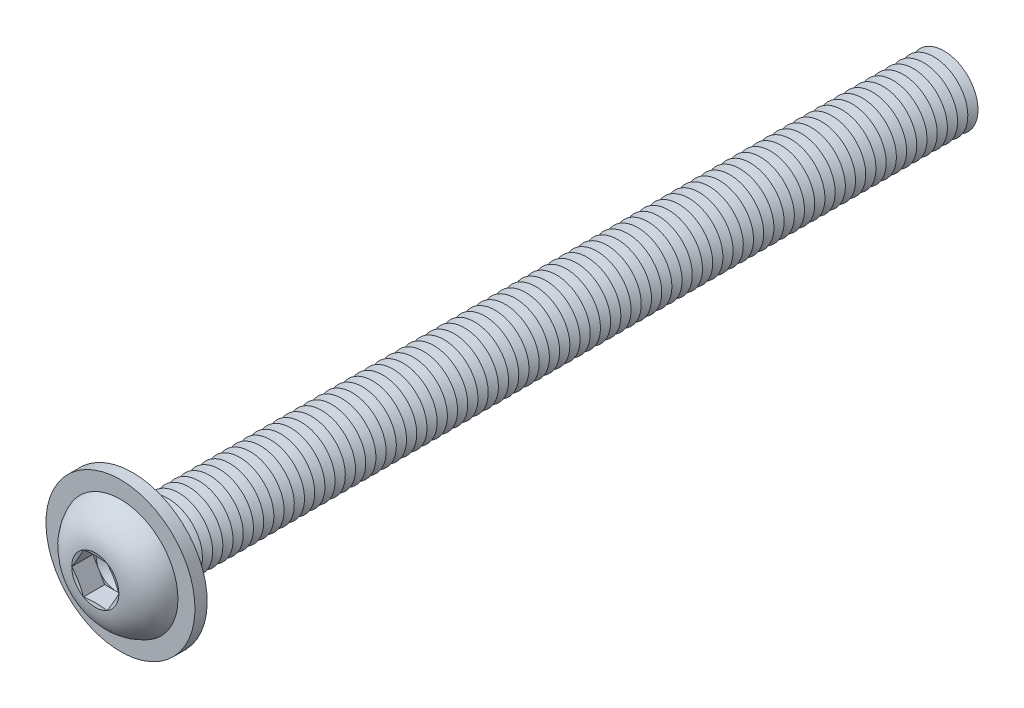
ISO-10303-21;
HEADER;
FILE_DESCRIPTION(('STEP AP214'),'2;1');
FILE_NAME('part.step','',(''),(''),'','','');
FILE_SCHEMA(('AUTOMOTIVE_DESIGN { 1 0 10303 214 1 1 1 1 }'));
ENDSEC;
DATA;
#1=APPLICATION_CONTEXT('core data for automotive mechanical design processes');
#2=APPLICATION_PROTOCOL_DEFINITION('international standard','automotive_design',2000,#1);
#3=PRODUCT_CONTEXT('',#1,'mechanical');
#4=PRODUCT('Part','Part','',(#3));
#5=PRODUCT_RELATED_PRODUCT_CATEGORY('part','',(#4));
#6=PRODUCT_DEFINITION_FORMATION('','',#4);
#7=PRODUCT_DEFINITION_CONTEXT('part definition',#1,'design');
#8=PRODUCT_DEFINITION('design','',#6,#7);
#9=PRODUCT_DEFINITION_SHAPE('','',#8);
#10=(LENGTH_UNIT() NAMED_UNIT(*) SI_UNIT(.MILLI.,.METRE.));
#11=(NAMED_UNIT(*) PLANE_ANGLE_UNIT() SI_UNIT($,.RADIAN.));
#12=(NAMED_UNIT(*) SI_UNIT($,.STERADIAN.) SOLID_ANGLE_UNIT());
#13=UNCERTAINTY_MEASURE_WITH_UNIT(LENGTH_MEASURE(1.E-05),#10,'distance_accuracy_value','');
#14=(GEOMETRIC_REPRESENTATION_CONTEXT(3) GLOBAL_UNCERTAINTY_ASSIGNED_CONTEXT((#13)) GLOBAL_UNIT_ASSIGNED_CONTEXT((#10,
#11,#12)) REPRESENTATION_CONTEXT('',''));
#15=CARTESIAN_POINT('',(0.,0.,0.));
#16=DIRECTION('',(0.,0.,1.));
#17=DIRECTION('',(1.,0.,0.));
#18=AXIS2_PLACEMENT_3D('',#15,#16,#17);
#19=CARTESIAN_POINT('',(0.,0.,-114.75));
#20=DIRECTION('',(0.,0.,1.));
#21=DIRECTION('',(0.,-1.,0.));
#22=AXIS2_PLACEMENT_3D('',#19,#20,#21);
#23=CONICAL_SURFACE('',#22,4.99999999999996,1.0471975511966);
#24=CARTESIAN_POINT('',(0.,0.,-115.5));
#25=DIRECTION('',(0.,0.,1.));
#26=DIRECTION('',(0.,-1.,0.));
#27=AXIS2_PLACEMENT_3D('',#24,#25,#26);
#28=CIRCLE('',#27,3.7009618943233);
#29=CARTESIAN_POINT('',(0.,-3.70096189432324,-115.5));
#30=VERTEX_POINT('',#29);
#31=EDGE_CURVE('E498',#30,#30,#28,.T.);
#32=ORIENTED_EDGE('',*,*,#31,.T.);
#33=EDGE_LOOP('',(#32));
#34=FACE_BOUND('',#33,.T.);
#35=CARTESIAN_POINT('',(0.,0.,-114.75));
#36=DIRECTION('',(0.,0.,1.));
#37=DIRECTION('',(0.,-1.,0.));
#38=AXIS2_PLACEMENT_3D('',#35,#36,#37);
#39=CIRCLE('',#38,4.99999999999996);
#40=CARTESIAN_POINT('',(0.,-4.9999999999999,-114.75));
#41=VERTEX_POINT('',#40);
#42=EDGE_CURVE('E494',#41,#41,#39,.T.);
#43=ORIENTED_EDGE('',*,*,#42,.F.);
#44=EDGE_LOOP('',(#43));
#45=FACE_BOUND('',#44,.T.);
#46=ADVANCED_FACE('F39',(#34,#45),#23,.T.);
#47=CARTESIAN_POINT('',(0.,0.,-115.5));
#48=DIRECTION('',(0.,0.,-1.));
#49=DIRECTION('',(0.,1.,0.));
#50=AXIS2_PLACEMENT_3D('',#47,#48,#49);
#51=CONICAL_SURFACE('',#50,3.7009618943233,1.0471975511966);
#52=CARTESIAN_POINT('',(0.,0.,-116.25));
#53=DIRECTION('',(0.,0.,1.));
#54=DIRECTION('',(0.,-1.,0.));
#55=AXIS2_PLACEMENT_3D('',#52,#53,#54);
#56=CIRCLE('',#55,4.99999999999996);
#57=CARTESIAN_POINT('',(0.,-4.9999999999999,-116.25));
#58=VERTEX_POINT('',#57);
#59=EDGE_CURVE('E502',#58,#58,#56,.T.);
#60=ORIENTED_EDGE('',*,*,#59,.T.);
#61=EDGE_LOOP('',(#60));
#62=FACE_BOUND('',#61,.T.);
#63=ORIENTED_EDGE('',*,*,#31,.F.);
#64=EDGE_LOOP('',(#63));
#65=FACE_BOUND('',#64,.T.);
#66=ADVANCED_FACE('F532',(#62,#65),#51,.T.);
#67=CARTESIAN_POINT('',(0.,4.99999999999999,-120.));
#68=DIRECTION('',(0.,0.,-1.));
#69=DIRECTION('',(0.,1.,0.));
#70=AXIS2_PLACEMENT_3D('',#67,#68,#69);
#71=PLANE('',#70);
#72=CARTESIAN_POINT('',(0.,0.,-120.));
#73=DIRECTION('',(0.,0.,1.));
#74=DIRECTION('',(0.,-1.,0.));
#75=AXIS2_PLACEMENT_3D('',#72,#73,#74);
#76=CIRCLE('',#75,3.7009618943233);
#77=CARTESIAN_POINT('',(0.,-3.70096189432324,-120.));
#78=VERTEX_POINT('',#77);
#79=EDGE_CURVE('E297',#78,#78,#76,.T.);
#80=ORIENTED_EDGE('',*,*,#79,.F.);
#81=EDGE_LOOP('',(#80));
#82=FACE_BOUND('',#81,.T.);
#83=ADVANCED_FACE('F530',(#82),#71,.T.);
#84=CARTESIAN_POINT('',(0.,0.,-119.25));
#85=DIRECTION('',(0.,0.,1.));
#86=DIRECTION('',(0.,-1.,0.));
#87=AXIS2_PLACEMENT_3D('',#84,#85,#86);
#88=CONICAL_SURFACE('',#87,4.99999999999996,1.0471975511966);
#89=ORIENTED_EDGE('',*,*,#79,.T.);
#90=EDGE_LOOP('',(#89));
#91=FACE_BOUND('',#90,.T.);
#92=CARTESIAN_POINT('',(0.,0.,-119.25));
#93=DIRECTION('',(0.,0.,1.));
#94=DIRECTION('',(0.,-1.,0.));
#95=AXIS2_PLACEMENT_3D('',#92,#93,#94);
#96=CIRCLE('',#95,4.99999999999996);
#97=CARTESIAN_POINT('',(0.,-4.99999999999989,-119.25));
#98=VERTEX_POINT('',#97);
#99=EDGE_CURVE('E516',#98,#98,#96,.T.);
#100=ORIENTED_EDGE('',*,*,#99,.F.);
#101=EDGE_LOOP('',(#100));
#102=FACE_BOUND('',#101,.T.);
#103=ADVANCED_FACE('F527',(#91,#102),#88,.T.);
#104=CARTESIAN_POINT('',(0.,0.,-118.5));
#105=DIRECTION('',(0.,0.,-1.));
#106=DIRECTION('',(0.,1.,0.));
#107=AXIS2_PLACEMENT_3D('',#104,#105,#106);
#108=CONICAL_SURFACE('',#107,3.7009618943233,1.0471975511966);
#109=ORIENTED_EDGE('',*,*,#99,.T.);
#110=EDGE_LOOP('',(#109));
#111=FACE_BOUND('',#110,.T.);
#112=CARTESIAN_POINT('',(0.,0.,-118.5));
#113=DIRECTION('',(0.,0.,1.));
#114=DIRECTION('',(0.,-1.,0.));
#115=AXIS2_PLACEMENT_3D('',#112,#113,#114);
#116=CIRCLE('',#115,3.7009618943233);
#117=CARTESIAN_POINT('',(0.,-3.70096189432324,-118.5));
#118=VERTEX_POINT('',#117);
#119=EDGE_CURVE('E513',#118,#118,#116,.T.);
#120=ORIENTED_EDGE('',*,*,#119,.F.);
#121=EDGE_LOOP('',(#120));
#122=FACE_BOUND('',#121,.T.);
#123=ADVANCED_FACE('F537',(#111,#122),#108,.T.);
#124=CARTESIAN_POINT('',(0.,0.,-117.75));
#125=DIRECTION('',(0.,0.,1.));
#126=DIRECTION('',(0.,-1.,0.));
#127=AXIS2_PLACEMENT_3D('',#124,#125,#126);
#128=CONICAL_SURFACE('',#127,4.99999999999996,1.0471975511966);
#129=ORIENTED_EDGE('',*,*,#119,.T.);
#130=EDGE_LOOP('',(#129));
#131=FACE_BOUND('',#130,.T.);
#132=CARTESIAN_POINT('',(0.,0.,-117.75));
#133=DIRECTION('',(0.,0.,1.));
#134=DIRECTION('',(0.,-1.,0.));
#135=AXIS2_PLACEMENT_3D('',#132,#133,#134);
#136=CIRCLE('',#135,4.99999999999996);
#137=CARTESIAN_POINT('',(0.,-4.9999999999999,-117.75));
#138=VERTEX_POINT('',#137);
#139=EDGE_CURVE('E509',#138,#138,#136,.T.);
#140=ORIENTED_EDGE('',*,*,#139,.F.);
#141=EDGE_LOOP('',(#140));
#142=FACE_BOUND('',#141,.T.);
#143=ADVANCED_FACE('F553',(#131,#142),#128,.T.);
#144=CARTESIAN_POINT('',(0.,0.,-117.));
#145=DIRECTION('',(0.,0.,-1.));
#146=DIRECTION('',(0.,1.,0.));
#147=AXIS2_PLACEMENT_3D('',#144,#145,#146);
#148=CONICAL_SURFACE('',#147,3.7009618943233,1.0471975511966);
#149=ORIENTED_EDGE('',*,*,#139,.T.);
#150=EDGE_LOOP('',(#149));
#151=FACE_BOUND('',#150,.T.);
#152=CARTESIAN_POINT('',(0.,0.,-117.));
#153=DIRECTION('',(0.,0.,1.));
#154=DIRECTION('',(0.,-1.,0.));
#155=AXIS2_PLACEMENT_3D('',#152,#153,#154);
#156=CIRCLE('',#155,3.7009618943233);
#157=CARTESIAN_POINT('',(0.,-3.70096189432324,-117.));
#158=VERTEX_POINT('',#157);
#159=EDGE_CURVE('E505',#158,#158,#156,.T.);
#160=ORIENTED_EDGE('',*,*,#159,.F.);
#161=EDGE_LOOP('',(#160));
#162=FACE_BOUND('',#161,.T.);
#163=ADVANCED_FACE('F549',(#151,#162),#148,.T.);
#164=CARTESIAN_POINT('',(0.,0.,-116.25));
#165=DIRECTION('',(0.,0.,1.));
#166=DIRECTION('',(0.,-1.,0.));
#167=AXIS2_PLACEMENT_3D('',#164,#165,#166);
#168=CONICAL_SURFACE('',#167,4.99999999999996,1.0471975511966);
#169=ORIENTED_EDGE('',*,*,#159,.T.);
#170=EDGE_LOOP('',(#169));
#171=FACE_BOUND('',#170,.T.);
#172=ORIENTED_EDGE('',*,*,#59,.F.);
#173=EDGE_LOOP('',(#172));
#174=FACE_BOUND('',#173,.T.);
#175=ADVANCED_FACE('F552',(#171,#174),#168,.T.);
#176=CARTESIAN_POINT('',(0.,0.,-113.25));
#177=DIRECTION('',(0.,0.,1.));
#178=DIRECTION('',(0.,-1.,0.));
#179=AXIS2_PLACEMENT_3D('',#176,#177,#178);
#180=CONICAL_SURFACE('',#179,4.99999999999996,1.0471975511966);
#181=CARTESIAN_POINT('',(0.,0.,-114.));
#182=DIRECTION('',(0.,0.,1.));
#183=DIRECTION('',(0.,-1.,0.));
#184=AXIS2_PLACEMENT_3D('',#181,#182,#183);
#185=CIRCLE('',#184,3.7009618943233);
#186=CARTESIAN_POINT('',(0.,-3.70096189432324,-114.));
#187=VERTEX_POINT('',#186);
#188=EDGE_CURVE('E483',#187,#187,#185,.T.);
#189=ORIENTED_EDGE('',*,*,#188,.T.);
#190=EDGE_LOOP('',(#189));
#191=FACE_BOUND('',#190,.T.);
#192=CARTESIAN_POINT('',(0.,0.,-113.25));
#193=DIRECTION('',(0.,0.,1.));
#194=DIRECTION('',(0.,-1.,0.));
#195=AXIS2_PLACEMENT_3D('',#192,#193,#194);
#196=CIRCLE('',#195,4.99999999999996);
#197=CARTESIAN_POINT('',(0.,-4.9999999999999,-113.25));
#198=VERTEX_POINT('',#197);
#199=EDGE_CURVE('E476',#198,#198,#196,.T.);
#200=ORIENTED_EDGE('',*,*,#199,.F.);
#201=EDGE_LOOP('',(#200));
#202=FACE_BOUND('',#201,.T.);
#203=ADVANCED_FACE('F557',(#191,#202),#180,.T.);
#204=CARTESIAN_POINT('',(0.,0.,-114.));
#205=DIRECTION('',(0.,0.,-1.));
#206=DIRECTION('',(0.,1.,0.));
#207=AXIS2_PLACEMENT_3D('',#204,#205,#206);
#208=CONICAL_SURFACE('',#207,3.7009618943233,1.0471975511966);
#209=ORIENTED_EDGE('',*,*,#42,.T.);
#210=EDGE_LOOP('',(#209));
#211=FACE_BOUND('',#210,.T.);
#212=ORIENTED_EDGE('',*,*,#188,.F.);
#213=EDGE_LOOP('',(#212));
#214=FACE_BOUND('',#213,.T.);
#215=ADVANCED_FACE('F588',(#211,#214),#208,.T.);
#216=CARTESIAN_POINT('',(0.,0.,-111.75));
#217=DIRECTION('',(0.,0.,1.));
#218=DIRECTION('',(0.,-1.,0.));
#219=AXIS2_PLACEMENT_3D('',#216,#217,#218);
#220=CONICAL_SURFACE('',#219,4.99999999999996,1.0471975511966);
#221=CARTESIAN_POINT('',(0.,0.,-112.5));
#222=DIRECTION('',(0.,0.,1.));
#223=DIRECTION('',(0.,-1.,0.));
#224=AXIS2_PLACEMENT_3D('',#221,#222,#223);
#225=CIRCLE('',#224,3.7009618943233);
#226=CARTESIAN_POINT('',(0.,-3.70096189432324,-112.5));
#227=VERTEX_POINT('',#226);
#228=EDGE_CURVE('E474',#227,#227,#225,.T.);
#229=ORIENTED_EDGE('',*,*,#228,.T.);
#230=EDGE_LOOP('',(#229));
#231=FACE_BOUND('',#230,.T.);
#232=CARTESIAN_POINT('',(0.,0.,-111.75));
#233=DIRECTION('',(0.,0.,1.));
#234=DIRECTION('',(0.,-1.,0.));
#235=AXIS2_PLACEMENT_3D('',#232,#233,#234);
#236=CIRCLE('',#235,4.99999999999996);
#237=CARTESIAN_POINT('',(0.,-4.9999999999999,-111.75));
#238=VERTEX_POINT('',#237);
#239=EDGE_CURVE('E477',#238,#238,#236,.T.);
#240=ORIENTED_EDGE('',*,*,#239,.F.);
#241=EDGE_LOOP('',(#240));
#242=FACE_BOUND('',#241,.T.);
#243=ADVANCED_FACE('F594',(#231,#242),#220,.T.);
#244=CARTESIAN_POINT('',(0.,0.,-112.5));
#245=DIRECTION('',(0.,0.,-1.));
#246=DIRECTION('',(0.,1.,0.));
#247=AXIS2_PLACEMENT_3D('',#244,#245,#246);
#248=CONICAL_SURFACE('',#247,3.7009618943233,1.0471975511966);
#249=ORIENTED_EDGE('',*,*,#199,.T.);
#250=EDGE_LOOP('',(#249));
#251=FACE_BOUND('',#250,.T.);
#252=ORIENTED_EDGE('',*,*,#228,.F.);
#253=EDGE_LOOP('',(#252));
#254=FACE_BOUND('',#253,.T.);
#255=ADVANCED_FACE('F601',(#251,#254),#248,.T.);
#256=CARTESIAN_POINT('',(0.,0.,-110.25));
#257=DIRECTION('',(0.,0.,1.));
#258=DIRECTION('',(0.,-1.,0.));
#259=AXIS2_PLACEMENT_3D('',#256,#257,#258);
#260=CONICAL_SURFACE('',#259,4.99999999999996,1.0471975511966);
#261=CARTESIAN_POINT('',(0.,0.,-111.));
#262=DIRECTION('',(0.,0.,1.));
#263=DIRECTION('',(0.,-1.,0.));
#264=AXIS2_PLACEMENT_3D('',#261,#262,#263);
#265=CIRCLE('',#264,3.7009618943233);
#266=CARTESIAN_POINT('',(0.,-3.70096189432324,-111.));
#267=VERTEX_POINT('',#266);
#268=EDGE_CURVE('E487',#267,#267,#265,.T.);
#269=ORIENTED_EDGE('',*,*,#268,.T.);
#270=EDGE_LOOP('',(#269));
#271=FACE_BOUND('',#270,.T.);
#272=CARTESIAN_POINT('',(0.,0.,-110.25));
#273=DIRECTION('',(0.,0.,1.));
#274=DIRECTION('',(0.,-1.,0.));
#275=AXIS2_PLACEMENT_3D('',#272,#273,#274);
#276=CIRCLE('',#275,4.99999999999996);
#277=CARTESIAN_POINT('',(0.,-4.9999999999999,-110.25));
#278=VERTEX_POINT('',#277);
#279=EDGE_CURVE('E2577',#278,#278,#276,.T.);
#280=ORIENTED_EDGE('',*,*,#279,.F.);
#281=EDGE_LOOP('',(#280));
#282=FACE_BOUND('',#281,.T.);
#283=ADVANCED_FACE('F607',(#271,#282),#260,.T.);
#284=CARTESIAN_POINT('',(0.,0.,-111.));
#285=DIRECTION('',(0.,0.,-1.));
#286=DIRECTION('',(0.,1.,0.));
#287=AXIS2_PLACEMENT_3D('',#284,#285,#286);
#288=CONICAL_SURFACE('',#287,3.7009618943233,1.0471975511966);
#289=ORIENTED_EDGE('',*,*,#239,.T.);
#290=EDGE_LOOP('',(#289));
#291=FACE_BOUND('',#290,.T.);
#292=ORIENTED_EDGE('',*,*,#268,.F.);
#293=EDGE_LOOP('',(#292));
#294=FACE_BOUND('',#293,.T.);
#295=ADVANCED_FACE('F614',(#291,#294),#288,.T.);
#296=CARTESIAN_POINT('',(0.,0.,-108.75));
#297=DIRECTION('',(0.,0.,1.));
#298=DIRECTION('',(0.,-1.,0.));
#299=AXIS2_PLACEMENT_3D('',#296,#297,#298);
#300=CONICAL_SURFACE('',#299,4.99999999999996,1.0471975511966);
#301=CARTESIAN_POINT('',(0.,0.,-109.5));
#302=DIRECTION('',(0.,0.,1.));
#303=DIRECTION('',(0.,-1.,0.));
#304=AXIS2_PLACEMENT_3D('',#301,#302,#303);
#305=CIRCLE('',#304,3.7009618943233);
#306=CARTESIAN_POINT('',(0.,-3.70096189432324,-109.5));
#307=VERTEX_POINT('',#306);
#308=EDGE_CURVE('E2573',#307,#307,#305,.T.);
#309=ORIENTED_EDGE('',*,*,#308,.T.);
#310=EDGE_LOOP('',(#309));
#311=FACE_BOUND('',#310,.T.);
#312=CARTESIAN_POINT('',(0.,0.,-108.75));
#313=DIRECTION('',(0.,0.,1.));
#314=DIRECTION('',(0.,-1.,0.));
#315=AXIS2_PLACEMENT_3D('',#312,#313,#314);
#316=CIRCLE('',#315,4.99999999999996);
#317=CARTESIAN_POINT('',(0.,-4.9999999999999,-108.75));
#318=VERTEX_POINT('',#317);
#319=EDGE_CURVE('E2569',#318,#318,#316,.T.);
#320=ORIENTED_EDGE('',*,*,#319,.F.);
#321=EDGE_LOOP('',(#320));
#322=FACE_BOUND('',#321,.T.);
#323=ADVANCED_FACE('F621',(#311,#322),#300,.T.);
#324=CARTESIAN_POINT('',(0.,0.,-109.5));
#325=DIRECTION('',(0.,0.,-1.));
#326=DIRECTION('',(0.,1.,0.));
#327=AXIS2_PLACEMENT_3D('',#324,#325,#326);
#328=CONICAL_SURFACE('',#327,3.7009618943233,1.0471975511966);
#329=ORIENTED_EDGE('',*,*,#279,.T.);
#330=EDGE_LOOP('',(#329));
#331=FACE_BOUND('',#330,.T.);
#332=ORIENTED_EDGE('',*,*,#308,.F.);
#333=EDGE_LOOP('',(#332));
#334=FACE_BOUND('',#333,.T.);
#335=ADVANCED_FACE('F628',(#331,#334),#328,.T.);
#336=CARTESIAN_POINT('',(0.,0.,-107.25));
#337=DIRECTION('',(0.,0.,1.));
#338=DIRECTION('',(0.,-1.,0.));
#339=AXIS2_PLACEMENT_3D('',#336,#337,#338);
#340=CONICAL_SURFACE('',#339,4.99999999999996,1.0471975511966);
#341=CARTESIAN_POINT('',(0.,0.,-108.));
#342=DIRECTION('',(0.,0.,1.));
#343=DIRECTION('',(0.,-1.,0.));
#344=AXIS2_PLACEMENT_3D('',#341,#342,#343);
#345=CIRCLE('',#344,3.7009618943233);
#346=CARTESIAN_POINT('',(0.,-3.70096189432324,-108.));
#347=VERTEX_POINT('',#346);
#348=EDGE_CURVE('E2499',#347,#347,#345,.T.);
#349=ORIENTED_EDGE('',*,*,#348,.T.);
#350=EDGE_LOOP('',(#349));
#351=FACE_BOUND('',#350,.T.);
#352=CARTESIAN_POINT('',(0.,0.,-107.25));
#353=DIRECTION('',(0.,0.,1.));
#354=DIRECTION('',(0.,-1.,0.));
#355=AXIS2_PLACEMENT_3D('',#352,#353,#354);
#356=CIRCLE('',#355,4.99999999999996);
#357=CARTESIAN_POINT('',(0.,-4.9999999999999,-107.25));
#358=VERTEX_POINT('',#357);
#359=EDGE_CURVE('E2563',#358,#358,#356,.T.);
#360=ORIENTED_EDGE('',*,*,#359,.F.);
#361=EDGE_LOOP('',(#360));
#362=FACE_BOUND('',#361,.T.);
#363=ADVANCED_FACE('F635',(#351,#362),#340,.T.);
#364=CARTESIAN_POINT('',(0.,0.,-108.));
#365=DIRECTION('',(0.,0.,-1.));
#366=DIRECTION('',(0.,1.,0.));
#367=AXIS2_PLACEMENT_3D('',#364,#365,#366);
#368=CONICAL_SURFACE('',#367,3.7009618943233,1.0471975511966);
#369=ORIENTED_EDGE('',*,*,#319,.T.);
#370=EDGE_LOOP('',(#369));
#371=FACE_BOUND('',#370,.T.);
#372=ORIENTED_EDGE('',*,*,#348,.F.);
#373=EDGE_LOOP('',(#372));
#374=FACE_BOUND('',#373,.T.);
#375=ADVANCED_FACE('F642',(#371,#374),#368,.T.);
#376=CARTESIAN_POINT('',(0.,0.,-105.75));
#377=DIRECTION('',(0.,0.,1.));
#378=DIRECTION('',(0.,-1.,0.));
#379=AXIS2_PLACEMENT_3D('',#376,#377,#378);
#380=CONICAL_SURFACE('',#379,4.99999999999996,1.0471975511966);
#381=CARTESIAN_POINT('',(0.,0.,-106.5));
#382=DIRECTION('',(0.,0.,1.));
#383=DIRECTION('',(0.,-1.,0.));
#384=AXIS2_PLACEMENT_3D('',#381,#382,#383);
#385=CIRCLE('',#384,3.7009618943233);
#386=CARTESIAN_POINT('',(0.,-3.70096189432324,-106.5));
#387=VERTEX_POINT('',#386);
#388=EDGE_CURVE('E2559',#387,#387,#385,.T.);
#389=ORIENTED_EDGE('',*,*,#388,.T.);
#390=EDGE_LOOP('',(#389));
#391=FACE_BOUND('',#390,.T.);
#392=CARTESIAN_POINT('',(0.,0.,-105.75));
#393=DIRECTION('',(0.,0.,1.));
#394=DIRECTION('',(0.,-1.,0.));
#395=AXIS2_PLACEMENT_3D('',#392,#393,#394);
#396=CIRCLE('',#395,4.99999999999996);
#397=CARTESIAN_POINT('',(0.,-4.9999999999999,-105.75));
#398=VERTEX_POINT('',#397);
#399=EDGE_CURVE('E2555',#398,#398,#396,.T.);
#400=ORIENTED_EDGE('',*,*,#399,.F.);
#401=EDGE_LOOP('',(#400));
#402=FACE_BOUND('',#401,.T.);
#403=ADVANCED_FACE('F649',(#391,#402),#380,.T.);
#404=CARTESIAN_POINT('',(0.,0.,-106.5));
#405=DIRECTION('',(0.,0.,-1.));
#406=DIRECTION('',(0.,1.,0.));
#407=AXIS2_PLACEMENT_3D('',#404,#405,#406);
#408=CONICAL_SURFACE('',#407,3.7009618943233,1.0471975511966);
#409=ORIENTED_EDGE('',*,*,#359,.T.);
#410=EDGE_LOOP('',(#409));
#411=FACE_BOUND('',#410,.T.);
#412=ORIENTED_EDGE('',*,*,#388,.F.);
#413=EDGE_LOOP('',(#412));
#414=FACE_BOUND('',#413,.T.);
#415=ADVANCED_FACE('F656',(#411,#414),#408,.T.);
#416=CARTESIAN_POINT('',(0.,0.,-104.25));
#417=DIRECTION('',(0.,0.,1.));
#418=DIRECTION('',(0.,-1.,0.));
#419=AXIS2_PLACEMENT_3D('',#416,#417,#418);
#420=CONICAL_SURFACE('',#419,4.99999999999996,1.0471975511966);
#421=CARTESIAN_POINT('',(0.,0.,-105.));
#422=DIRECTION('',(0.,0.,1.));
#423=DIRECTION('',(0.,-1.,0.));
#424=AXIS2_PLACEMENT_3D('',#421,#422,#423);
#425=CIRCLE('',#424,3.7009618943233);
#426=CARTESIAN_POINT('',(0.,-3.70096189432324,-105.));
#427=VERTEX_POINT('',#426);
#428=EDGE_CURVE('E2552',#427,#427,#425,.T.);
#429=ORIENTED_EDGE('',*,*,#428,.T.);
#430=EDGE_LOOP('',(#429));
#431=FACE_BOUND('',#430,.T.);
#432=CARTESIAN_POINT('',(0.,0.,-104.25));
#433=DIRECTION('',(0.,0.,1.));
#434=DIRECTION('',(0.,-1.,0.));
#435=AXIS2_PLACEMENT_3D('',#432,#433,#434);
#436=CIRCLE('',#435,4.99999999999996);
#437=CARTESIAN_POINT('',(0.,-4.9999999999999,-104.25));
#438=VERTEX_POINT('',#437);
#439=EDGE_CURVE('E2545',#438,#438,#436,.T.);
#440=ORIENTED_EDGE('',*,*,#439,.F.);
#441=EDGE_LOOP('',(#440));
#442=FACE_BOUND('',#441,.T.);
#443=ADVANCED_FACE('F663',(#431,#442),#420,.T.);
#444=CARTESIAN_POINT('',(0.,0.,-105.));
#445=DIRECTION('',(0.,0.,-1.));
#446=DIRECTION('',(0.,1.,0.));
#447=AXIS2_PLACEMENT_3D('',#444,#445,#446);
#448=CONICAL_SURFACE('',#447,3.7009618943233,1.0471975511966);
#449=ORIENTED_EDGE('',*,*,#399,.T.);
#450=EDGE_LOOP('',(#449));
#451=FACE_BOUND('',#450,.T.);
#452=ORIENTED_EDGE('',*,*,#428,.F.);
#453=EDGE_LOOP('',(#452));
#454=FACE_BOUND('',#453,.T.);
#455=ADVANCED_FACE('F670',(#451,#454),#448,.T.);
#456=CARTESIAN_POINT('',(0.,0.,-102.75));
#457=DIRECTION('',(0.,0.,1.));
#458=DIRECTION('',(0.,-1.,0.));
#459=AXIS2_PLACEMENT_3D('',#456,#457,#458);
#460=CONICAL_SURFACE('',#459,4.99999999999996,1.0471975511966);
#461=CARTESIAN_POINT('',(0.,0.,-103.5));
#462=DIRECTION('',(0.,0.,1.));
#463=DIRECTION('',(0.,-1.,0.));
#464=AXIS2_PLACEMENT_3D('',#461,#462,#463);
#465=CIRCLE('',#464,3.7009618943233);
#466=CARTESIAN_POINT('',(0.,-3.70096189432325,-103.5));
#467=VERTEX_POINT('',#466);
#468=EDGE_CURVE('E2540',#467,#467,#465,.T.);
#469=ORIENTED_EDGE('',*,*,#468,.T.);
#470=EDGE_LOOP('',(#469));
#471=FACE_BOUND('',#470,.T.);
#472=CARTESIAN_POINT('',(0.,0.,-102.75));
#473=DIRECTION('',(0.,0.,1.));
#474=DIRECTION('',(0.,-1.,0.));
#475=AXIS2_PLACEMENT_3D('',#472,#473,#474);
#476=CIRCLE('',#475,4.99999999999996);
#477=CARTESIAN_POINT('',(0.,-4.9999999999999,-102.75));
#478=VERTEX_POINT('',#477);
#479=EDGE_CURVE('E412',#478,#478,#476,.T.);
#480=ORIENTED_EDGE('',*,*,#479,.F.);
#481=EDGE_LOOP('',(#480));
#482=FACE_BOUND('',#481,.T.);
#483=ADVANCED_FACE('F677',(#471,#482),#460,.T.);
#484=CARTESIAN_POINT('',(0.,0.,-103.5));
#485=DIRECTION('',(0.,0.,-1.));
#486=DIRECTION('',(0.,1.,0.));
#487=AXIS2_PLACEMENT_3D('',#484,#485,#486);
#488=CONICAL_SURFACE('',#487,3.7009618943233,1.0471975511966);
#489=ORIENTED_EDGE('',*,*,#439,.T.);
#490=EDGE_LOOP('',(#489));
#491=FACE_BOUND('',#490,.T.);
#492=ORIENTED_EDGE('',*,*,#468,.F.);
#493=EDGE_LOOP('',(#492));
#494=FACE_BOUND('',#493,.T.);
#495=ADVANCED_FACE('F684',(#491,#494),#488,.T.);
#496=CARTESIAN_POINT('',(0.,0.,-101.25));
#497=DIRECTION('',(0.,0.,1.));
#498=DIRECTION('',(0.,-1.,0.));
#499=AXIS2_PLACEMENT_3D('',#496,#497,#498);
#500=CONICAL_SURFACE('',#499,4.99999999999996,1.0471975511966);
#501=CARTESIAN_POINT('',(0.,0.,-102.));
#502=DIRECTION('',(0.,0.,1.));
#503=DIRECTION('',(0.,-1.,0.));
#504=AXIS2_PLACEMENT_3D('',#501,#502,#503);
#505=CIRCLE('',#504,3.7009618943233);
#506=CARTESIAN_POINT('',(0.,-3.70096189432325,-102.));
#507=VERTEX_POINT('',#506);
#508=EDGE_CURVE('E410',#507,#507,#505,.T.);
#509=ORIENTED_EDGE('',*,*,#508,.T.);
#510=EDGE_LOOP('',(#509));
#511=FACE_BOUND('',#510,.T.);
#512=CARTESIAN_POINT('',(0.,0.,-101.25));
#513=DIRECTION('',(0.,0.,1.));
#514=DIRECTION('',(0.,-1.,0.));
#515=AXIS2_PLACEMENT_3D('',#512,#513,#514);
#516=CIRCLE('',#515,4.99999999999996);
#517=CARTESIAN_POINT('',(0.,-4.9999999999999,-101.25));
#518=VERTEX_POINT('',#517);
#519=EDGE_CURVE('E413',#518,#518,#516,.T.);
#520=ORIENTED_EDGE('',*,*,#519,.F.);
#521=EDGE_LOOP('',(#520));
#522=FACE_BOUND('',#521,.T.);
#523=ADVANCED_FACE('F691',(#511,#522),#500,.T.);
#524=CARTESIAN_POINT('',(0.,0.,-102.));
#525=DIRECTION('',(0.,0.,-1.));
#526=DIRECTION('',(0.,1.,0.));
#527=AXIS2_PLACEMENT_3D('',#524,#525,#526);
#528=CONICAL_SURFACE('',#527,3.7009618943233,1.0471975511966);
#529=ORIENTED_EDGE('',*,*,#479,.T.);
#530=EDGE_LOOP('',(#529));
#531=FACE_BOUND('',#530,.T.);
#532=ORIENTED_EDGE('',*,*,#508,.F.);
#533=EDGE_LOOP('',(#532));
#534=FACE_BOUND('',#533,.T.);
#535=ADVANCED_FACE('F698',(#531,#534),#528,.T.);
#536=CARTESIAN_POINT('',(0.,0.,-99.75));
#537=DIRECTION('',(0.,0.,1.));
#538=DIRECTION('',(0.,-1.,0.));
#539=AXIS2_PLACEMENT_3D('',#536,#537,#538);
#540=CONICAL_SURFACE('',#539,4.99999999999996,1.0471975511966);
#541=CARTESIAN_POINT('',(0.,0.,-100.5));
#542=DIRECTION('',(0.,0.,1.));
#543=DIRECTION('',(0.,-1.,0.));
#544=AXIS2_PLACEMENT_3D('',#541,#542,#543);
#545=CIRCLE('',#544,3.7009618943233);
#546=CARTESIAN_POINT('',(0.,-3.70096189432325,-100.5));
#547=VERTEX_POINT('',#546);
#548=EDGE_CURVE('E408',#547,#547,#545,.T.);
#549=ORIENTED_EDGE('',*,*,#548,.T.);
#550=EDGE_LOOP('',(#549));
#551=FACE_BOUND('',#550,.T.);
#552=CARTESIAN_POINT('',(0.,0.,-99.75));
#553=DIRECTION('',(0.,0.,1.));
#554=DIRECTION('',(0.,-1.,0.));
#555=AXIS2_PLACEMENT_3D('',#552,#553,#554);
#556=CIRCLE('',#555,4.99999999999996);
#557=CARTESIAN_POINT('',(0.,-4.9999999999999,-99.75));
#558=VERTEX_POINT('',#557);
#559=EDGE_CURVE('E405',#558,#558,#556,.T.);
#560=ORIENTED_EDGE('',*,*,#559,.F.);
#561=EDGE_LOOP('',(#560));
#562=FACE_BOUND('',#561,.T.);
#563=ADVANCED_FACE('F705',(#551,#562),#540,.T.);
#564=CARTESIAN_POINT('',(0.,0.,-100.5));
#565=DIRECTION('',(0.,0.,-1.));
#566=DIRECTION('',(0.,1.,0.));
#567=AXIS2_PLACEMENT_3D('',#564,#565,#566);
#568=CONICAL_SURFACE('',#567,3.7009618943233,1.0471975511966);
#569=ORIENTED_EDGE('',*,*,#519,.T.);
#570=EDGE_LOOP('',(#569));
#571=FACE_BOUND('',#570,.T.);
#572=ORIENTED_EDGE('',*,*,#548,.F.);
#573=EDGE_LOOP('',(#572));
#574=FACE_BOUND('',#573,.T.);
#575=ADVANCED_FACE('F712',(#571,#574),#568,.T.);
#576=CARTESIAN_POINT('',(0.,0.,-98.25));
#577=DIRECTION('',(0.,0.,1.));
#578=DIRECTION('',(0.,-1.,0.));
#579=AXIS2_PLACEMENT_3D('',#576,#577,#578);
#580=CONICAL_SURFACE('',#579,4.99999999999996,1.0471975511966);
#581=CARTESIAN_POINT('',(0.,0.,-99.));
#582=DIRECTION('',(0.,0.,1.));
#583=DIRECTION('',(0.,-1.,0.));
#584=AXIS2_PLACEMENT_3D('',#581,#582,#583);
#585=CIRCLE('',#584,3.7009618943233);
#586=CARTESIAN_POINT('',(0.,-3.70096189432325,-99.));
#587=VERTEX_POINT('',#586);
#588=EDGE_CURVE('E402',#587,#587,#585,.T.);
#589=ORIENTED_EDGE('',*,*,#588,.T.);
#590=EDGE_LOOP('',(#589));
#591=FACE_BOUND('',#590,.T.);
#592=CARTESIAN_POINT('',(0.,0.,-98.25));
#593=DIRECTION('',(0.,0.,1.));
#594=DIRECTION('',(0.,-1.,0.));
#595=AXIS2_PLACEMENT_3D('',#592,#593,#594);
#596=CIRCLE('',#595,4.99999999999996);
#597=CARTESIAN_POINT('',(0.,-4.99999999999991,-98.25));
#598=VERTEX_POINT('',#597);
#599=EDGE_CURVE('E399',#598,#598,#596,.T.);
#600=ORIENTED_EDGE('',*,*,#599,.F.);
#601=EDGE_LOOP('',(#600));
#602=FACE_BOUND('',#601,.T.);
#603=ADVANCED_FACE('F719',(#591,#602),#580,.T.);
#604=CARTESIAN_POINT('',(0.,0.,-99.));
#605=DIRECTION('',(0.,0.,-1.));
#606=DIRECTION('',(0.,1.,0.));
#607=AXIS2_PLACEMENT_3D('',#604,#605,#606);
#608=CONICAL_SURFACE('',#607,3.7009618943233,1.0471975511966);
#609=ORIENTED_EDGE('',*,*,#559,.T.);
#610=EDGE_LOOP('',(#609));
#611=FACE_BOUND('',#610,.T.);
#612=ORIENTED_EDGE('',*,*,#588,.F.);
#613=EDGE_LOOP('',(#612));
#614=FACE_BOUND('',#613,.T.);
#615=ADVANCED_FACE('F726',(#611,#614),#608,.T.);
#616=CARTESIAN_POINT('',(0.,0.,-96.75));
#617=DIRECTION('',(0.,0.,1.));
#618=DIRECTION('',(0.,-1.,0.));
#619=AXIS2_PLACEMENT_3D('',#616,#617,#618);
#620=CONICAL_SURFACE('',#619,4.99999999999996,1.0471975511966);
#621=CARTESIAN_POINT('',(0.,0.,-97.5));
#622=DIRECTION('',(0.,0.,1.));
#623=DIRECTION('',(0.,-1.,0.));
#624=AXIS2_PLACEMENT_3D('',#621,#622,#623);
#625=CIRCLE('',#624,3.7009618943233);
#626=CARTESIAN_POINT('',(0.,-3.70096189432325,-97.5));
#627=VERTEX_POINT('',#626);
#628=EDGE_CURVE('E403',#627,#627,#625,.T.);
#629=ORIENTED_EDGE('',*,*,#628,.T.);
#630=EDGE_LOOP('',(#629));
#631=FACE_BOUND('',#630,.T.);
#632=CARTESIAN_POINT('',(0.,0.,-96.75));
#633=DIRECTION('',(0.,0.,1.));
#634=DIRECTION('',(0.,-1.,0.));
#635=AXIS2_PLACEMENT_3D('',#632,#633,#634);
#636=CIRCLE('',#635,4.99999999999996);
#637=CARTESIAN_POINT('',(0.,-4.99999999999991,-96.75));
#638=VERTEX_POINT('',#637);
#639=EDGE_CURVE('E2537',#638,#638,#636,.T.);
#640=ORIENTED_EDGE('',*,*,#639,.F.);
#641=EDGE_LOOP('',(#640));
#642=FACE_BOUND('',#641,.T.);
#643=ADVANCED_FACE('F733',(#631,#642),#620,.T.);
#644=CARTESIAN_POINT('',(0.,0.,-97.5));
#645=DIRECTION('',(0.,0.,-1.));
#646=DIRECTION('',(0.,1.,0.));
#647=AXIS2_PLACEMENT_3D('',#644,#645,#646);
#648=CONICAL_SURFACE('',#647,3.7009618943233,1.0471975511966);
#649=ORIENTED_EDGE('',*,*,#599,.T.);
#650=EDGE_LOOP('',(#649));
#651=FACE_BOUND('',#650,.T.);
#652=ORIENTED_EDGE('',*,*,#628,.F.);
#653=EDGE_LOOP('',(#652));
#654=FACE_BOUND('',#653,.T.);
#655=ADVANCED_FACE('F740',(#651,#654),#648,.T.);
#656=CARTESIAN_POINT('',(0.,0.,-95.25));
#657=DIRECTION('',(0.,0.,1.));
#658=DIRECTION('',(0.,-1.,0.));
#659=AXIS2_PLACEMENT_3D('',#656,#657,#658);
#660=CONICAL_SURFACE('',#659,4.99999999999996,1.0471975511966);
#661=CARTESIAN_POINT('',(0.,0.,-96.));
#662=DIRECTION('',(0.,0.,1.));
#663=DIRECTION('',(0.,-1.,0.));
#664=AXIS2_PLACEMENT_3D('',#661,#662,#663);
#665=CIRCLE('',#664,3.7009618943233);
#666=CARTESIAN_POINT('',(0.,-3.70096189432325,-96.));
#667=VERTEX_POINT('',#666);
#668=EDGE_CURVE('E2651',#667,#667,#665,.T.);
#669=ORIENTED_EDGE('',*,*,#668,.T.);
#670=EDGE_LOOP('',(#669));
#671=FACE_BOUND('',#670,.T.);
#672=CARTESIAN_POINT('',(0.,0.,-95.25));
#673=DIRECTION('',(0.,0.,1.));
#674=DIRECTION('',(0.,-1.,0.));
#675=AXIS2_PLACEMENT_3D('',#672,#673,#674);
#676=CIRCLE('',#675,4.99999999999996);
#677=CARTESIAN_POINT('',(0.,-4.99999999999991,-95.25));
#678=VERTEX_POINT('',#677);
#679=EDGE_CURVE('E2653',#678,#678,#676,.T.);
#680=ORIENTED_EDGE('',*,*,#679,.F.);
#681=EDGE_LOOP('',(#680));
#682=FACE_BOUND('',#681,.T.);
#683=ADVANCED_FACE('F747',(#671,#682),#660,.T.);
#684=CARTESIAN_POINT('',(0.,0.,-96.));
#685=DIRECTION('',(0.,0.,-1.));
#686=DIRECTION('',(0.,1.,0.));
#687=AXIS2_PLACEMENT_3D('',#684,#685,#686);
#688=CONICAL_SURFACE('',#687,3.7009618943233,1.0471975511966);
#689=ORIENTED_EDGE('',*,*,#639,.T.);
#690=EDGE_LOOP('',(#689));
#691=FACE_BOUND('',#690,.T.);
#692=ORIENTED_EDGE('',*,*,#668,.F.);
#693=EDGE_LOOP('',(#692));
#694=FACE_BOUND('',#693,.T.);
#695=ADVANCED_FACE('F754',(#691,#694),#688,.T.);
#696=CARTESIAN_POINT('',(0.,0.,-93.75));
#697=DIRECTION('',(0.,0.,1.));
#698=DIRECTION('',(0.,-1.,0.));
#699=AXIS2_PLACEMENT_3D('',#696,#697,#698);
#700=CONICAL_SURFACE('',#699,4.99999999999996,1.0471975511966);
#701=CARTESIAN_POINT('',(0.,0.,-94.5));
#702=DIRECTION('',(0.,0.,1.));
#703=DIRECTION('',(0.,-1.,0.));
#704=AXIS2_PLACEMENT_3D('',#701,#702,#703);
#705=CIRCLE('',#704,3.7009618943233);
#706=CARTESIAN_POINT('',(0.,-3.70096189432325,-94.5));
#707=VERTEX_POINT('',#706);
#708=EDGE_CURVE('E2661',#707,#707,#705,.T.);
#709=ORIENTED_EDGE('',*,*,#708,.T.);
#710=EDGE_LOOP('',(#709));
#711=FACE_BOUND('',#710,.T.);
#712=CARTESIAN_POINT('',(0.,0.,-93.75));
#713=DIRECTION('',(0.,0.,1.));
#714=DIRECTION('',(0.,-1.,0.));
#715=AXIS2_PLACEMENT_3D('',#712,#713,#714);
#716=CIRCLE('',#715,4.99999999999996);
#717=CARTESIAN_POINT('',(0.,-4.99999999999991,-93.75));
#718=VERTEX_POINT('',#717);
#719=EDGE_CURVE('E2764',#718,#718,#716,.T.);
#720=ORIENTED_EDGE('',*,*,#719,.F.);
#721=EDGE_LOOP('',(#720));
#722=FACE_BOUND('',#721,.T.);
#723=ADVANCED_FACE('F761',(#711,#722),#700,.T.);
#724=CARTESIAN_POINT('',(0.,0.,-94.5));
#725=DIRECTION('',(0.,0.,-1.));
#726=DIRECTION('',(0.,1.,0.));
#727=AXIS2_PLACEMENT_3D('',#724,#725,#726);
#728=CONICAL_SURFACE('',#727,3.7009618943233,1.0471975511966);
#729=ORIENTED_EDGE('',*,*,#679,.T.);
#730=EDGE_LOOP('',(#729));
#731=FACE_BOUND('',#730,.T.);
#732=ORIENTED_EDGE('',*,*,#708,.F.);
#733=EDGE_LOOP('',(#732));
#734=FACE_BOUND('',#733,.T.);
#735=ADVANCED_FACE('F768',(#731,#734),#728,.T.);
#736=CARTESIAN_POINT('',(0.,0.,-92.25));
#737=DIRECTION('',(0.,0.,1.));
#738=DIRECTION('',(0.,-1.,0.));
#739=AXIS2_PLACEMENT_3D('',#736,#737,#738);
#740=CONICAL_SURFACE('',#739,4.99999999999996,1.0471975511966);
#741=CARTESIAN_POINT('',(0.,0.,-93.));
#742=DIRECTION('',(0.,0.,1.));
#743=DIRECTION('',(0.,-1.,0.));
#744=AXIS2_PLACEMENT_3D('',#741,#742,#743);
#745=CIRCLE('',#744,3.7009618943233);
#746=CARTESIAN_POINT('',(0.,-3.70096189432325,-93.));
#747=VERTEX_POINT('',#746);
#748=EDGE_CURVE('E471',#747,#747,#745,.T.);
#749=ORIENTED_EDGE('',*,*,#748,.T.);
#750=EDGE_LOOP('',(#749));
#751=FACE_BOUND('',#750,.T.);
#752=CARTESIAN_POINT('',(0.,0.,-92.25));
#753=DIRECTION('',(0.,0.,1.));
#754=DIRECTION('',(0.,-1.,0.));
#755=AXIS2_PLACEMENT_3D('',#752,#753,#754);
#756=CIRCLE('',#755,4.99999999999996);
#757=CARTESIAN_POINT('',(0.,-4.99999999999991,-92.25));
#758=VERTEX_POINT('',#757);
#759=EDGE_CURVE('E468',#758,#758,#756,.T.);
#760=ORIENTED_EDGE('',*,*,#759,.F.);
#761=EDGE_LOOP('',(#760));
#762=FACE_BOUND('',#761,.T.);
#763=ADVANCED_FACE('F775',(#751,#762),#740,.T.);
#764=CARTESIAN_POINT('',(0.,0.,-93.));
#765=DIRECTION('',(0.,0.,-1.));
#766=DIRECTION('',(0.,1.,0.));
#767=AXIS2_PLACEMENT_3D('',#764,#765,#766);
#768=CONICAL_SURFACE('',#767,3.7009618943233,1.0471975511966);
#769=ORIENTED_EDGE('',*,*,#719,.T.);
#770=EDGE_LOOP('',(#769));
#771=FACE_BOUND('',#770,.T.);
#772=ORIENTED_EDGE('',*,*,#748,.F.);
#773=EDGE_LOOP('',(#772));
#774=FACE_BOUND('',#773,.T.);
#775=ADVANCED_FACE('F782',(#771,#774),#768,.T.);
#776=CARTESIAN_POINT('',(0.,0.,-90.75));
#777=DIRECTION('',(0.,0.,1.));
#778=DIRECTION('',(0.,-1.,0.));
#779=AXIS2_PLACEMENT_3D('',#776,#777,#778);
#780=CONICAL_SURFACE('',#779,4.99999999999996,1.0471975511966);
#781=CARTESIAN_POINT('',(0.,0.,-91.5));
#782=DIRECTION('',(0.,0.,1.));
#783=DIRECTION('',(0.,-1.,0.));
#784=AXIS2_PLACEMENT_3D('',#781,#782,#783);
#785=CIRCLE('',#784,3.7009618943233);
#786=CARTESIAN_POINT('',(0.,-3.70096189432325,-91.5));
#787=VERTEX_POINT('',#786);
#788=EDGE_CURVE('E472',#787,#787,#785,.T.);
#789=ORIENTED_EDGE('',*,*,#788,.T.);
#790=EDGE_LOOP('',(#789));
#791=FACE_BOUND('',#790,.T.);
#792=CARTESIAN_POINT('',(0.,0.,-90.75));
#793=DIRECTION('',(0.,0.,1.));
#794=DIRECTION('',(0.,-1.,0.));
#795=AXIS2_PLACEMENT_3D('',#792,#793,#794);
#796=CIRCLE('',#795,4.99999999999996);
#797=CARTESIAN_POINT('',(0.,-4.99999999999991,-90.75));
#798=VERTEX_POINT('',#797);
#799=EDGE_CURVE('E2752',#798,#798,#796,.T.);
#800=ORIENTED_EDGE('',*,*,#799,.F.);
#801=EDGE_LOOP('',(#800));
#802=FACE_BOUND('',#801,.T.);
#803=ADVANCED_FACE('F789',(#791,#802),#780,.T.);
#804=CARTESIAN_POINT('',(0.,0.,-91.5));
#805=DIRECTION('',(0.,0.,-1.));
#806=DIRECTION('',(0.,1.,0.));
#807=AXIS2_PLACEMENT_3D('',#804,#805,#806);
#808=CONICAL_SURFACE('',#807,3.7009618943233,1.0471975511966);
#809=ORIENTED_EDGE('',*,*,#759,.T.);
#810=EDGE_LOOP('',(#809));
#811=FACE_BOUND('',#810,.T.);
#812=ORIENTED_EDGE('',*,*,#788,.F.);
#813=EDGE_LOOP('',(#812));
#814=FACE_BOUND('',#813,.T.);
#815=ADVANCED_FACE('F796',(#811,#814),#808,.T.);
#816=CARTESIAN_POINT('',(0.,0.,-89.25));
#817=DIRECTION('',(0.,0.,1.));
#818=DIRECTION('',(0.,-1.,0.));
#819=AXIS2_PLACEMENT_3D('',#816,#817,#818);
#820=CONICAL_SURFACE('',#819,4.99999999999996,1.0471975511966);
#821=CARTESIAN_POINT('',(0.,0.,-90.));
#822=DIRECTION('',(0.,0.,1.));
#823=DIRECTION('',(0.,-1.,0.));
#824=AXIS2_PLACEMENT_3D('',#821,#822,#823);
#825=CIRCLE('',#824,3.7009618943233);
#826=CARTESIAN_POINT('',(0.,-3.70096189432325,-90.));
#827=VERTEX_POINT('',#826);
#828=EDGE_CURVE('E2757',#827,#827,#825,.T.);
#829=ORIENTED_EDGE('',*,*,#828,.T.);
#830=EDGE_LOOP('',(#829));
#831=FACE_BOUND('',#830,.T.);
#832=CARTESIAN_POINT('',(0.,0.,-89.25));
#833=DIRECTION('',(0.,0.,1.));
#834=DIRECTION('',(0.,-1.,0.));
#835=AXIS2_PLACEMENT_3D('',#832,#833,#834);
#836=CIRCLE('',#835,4.99999999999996);
#837=CARTESIAN_POINT('',(0.,-4.99999999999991,-89.25));
#838=VERTEX_POINT('',#837);
#839=EDGE_CURVE('E465',#838,#838,#836,.T.);
#840=ORIENTED_EDGE('',*,*,#839,.F.);
#841=EDGE_LOOP('',(#840));
#842=FACE_BOUND('',#841,.T.);
#843=ADVANCED_FACE('F803',(#831,#842),#820,.T.);
#844=CARTESIAN_POINT('',(0.,0.,-90.));
#845=DIRECTION('',(0.,0.,-1.));
#846=DIRECTION('',(0.,1.,0.));
#847=AXIS2_PLACEMENT_3D('',#844,#845,#846);
#848=CONICAL_SURFACE('',#847,3.7009618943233,1.0471975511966);
#849=ORIENTED_EDGE('',*,*,#799,.T.);
#850=EDGE_LOOP('',(#849));
#851=FACE_BOUND('',#850,.T.);
#852=ORIENTED_EDGE('',*,*,#828,.F.);
#853=EDGE_LOOP('',(#852));
#854=FACE_BOUND('',#853,.T.);
#855=ADVANCED_FACE('F810',(#851,#854),#848,.T.);
#856=CARTESIAN_POINT('',(0.,0.,-87.75));
#857=DIRECTION('',(0.,0.,1.));
#858=DIRECTION('',(0.,-1.,0.));
#859=AXIS2_PLACEMENT_3D('',#856,#857,#858);
#860=CONICAL_SURFACE('',#859,4.99999999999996,1.0471975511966);
#861=CARTESIAN_POINT('',(0.,0.,-88.5));
#862=DIRECTION('',(0.,0.,1.));
#863=DIRECTION('',(0.,-1.,0.));
#864=AXIS2_PLACEMENT_3D('',#861,#862,#863);
#865=CIRCLE('',#864,3.7009618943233);
#866=CARTESIAN_POINT('',(0.,-3.70096189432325,-88.5));
#867=VERTEX_POINT('',#866);
#868=EDGE_CURVE('E462',#867,#867,#865,.T.);
#869=ORIENTED_EDGE('',*,*,#868,.T.);
#870=EDGE_LOOP('',(#869));
#871=FACE_BOUND('',#870,.T.);
#872=CARTESIAN_POINT('',(0.,0.,-87.75));
#873=DIRECTION('',(0.,0.,1.));
#874=DIRECTION('',(0.,-1.,0.));
#875=AXIS2_PLACEMENT_3D('',#872,#873,#874);
#876=CIRCLE('',#875,4.99999999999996);
#877=CARTESIAN_POINT('',(0.,-4.99999999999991,-87.75));
#878=VERTEX_POINT('',#877);
#879=EDGE_CURVE('E466',#878,#878,#876,.T.);
#880=ORIENTED_EDGE('',*,*,#879,.F.);
#881=EDGE_LOOP('',(#880));
#882=FACE_BOUND('',#881,.T.);
#883=ADVANCED_FACE('F817',(#871,#882),#860,.T.);
#884=CARTESIAN_POINT('',(0.,0.,-88.5));
#885=DIRECTION('',(0.,0.,-1.));
#886=DIRECTION('',(0.,1.,0.));
#887=AXIS2_PLACEMENT_3D('',#884,#885,#886);
#888=CONICAL_SURFACE('',#887,3.7009618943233,1.0471975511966);
#889=ORIENTED_EDGE('',*,*,#839,.T.);
#890=EDGE_LOOP('',(#889));
#891=FACE_BOUND('',#890,.T.);
#892=ORIENTED_EDGE('',*,*,#868,.F.);
#893=EDGE_LOOP('',(#892));
#894=FACE_BOUND('',#893,.T.);
#895=ADVANCED_FACE('F824',(#891,#894),#888,.T.);
#896=CARTESIAN_POINT('',(0.,0.,-86.25));
#897=DIRECTION('',(0.,0.,1.));
#898=DIRECTION('',(0.,-1.,0.));
#899=AXIS2_PLACEMENT_3D('',#896,#897,#898);
#900=CONICAL_SURFACE('',#899,4.99999999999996,1.0471975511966);
#901=CARTESIAN_POINT('',(0.,0.,-87.));
#902=DIRECTION('',(0.,0.,1.));
#903=DIRECTION('',(0.,-1.,0.));
#904=AXIS2_PLACEMENT_3D('',#901,#902,#903);
#905=CIRCLE('',#904,3.7009618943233);
#906=CARTESIAN_POINT('',(0.,-3.70096189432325,-87.));
#907=VERTEX_POINT('',#906);
#908=EDGE_CURVE('E2807',#907,#907,#905,.T.);
#909=ORIENTED_EDGE('',*,*,#908,.T.);
#910=EDGE_LOOP('',(#909));
#911=FACE_BOUND('',#910,.T.);
#912=CARTESIAN_POINT('',(0.,0.,-86.25));
#913=DIRECTION('',(0.,0.,1.));
#914=DIRECTION('',(0.,-1.,0.));
#915=AXIS2_PLACEMENT_3D('',#912,#913,#914);
#916=CIRCLE('',#915,4.99999999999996);
#917=CARTESIAN_POINT('',(0.,-4.99999999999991,-86.25));
#918=VERTEX_POINT('',#917);
#919=EDGE_CURVE('E2605',#918,#918,#916,.T.);
#920=ORIENTED_EDGE('',*,*,#919,.F.);
#921=EDGE_LOOP('',(#920));
#922=FACE_BOUND('',#921,.T.);
#923=ADVANCED_FACE('F831',(#911,#922),#900,.T.);
#924=CARTESIAN_POINT('',(0.,0.,-87.));
#925=DIRECTION('',(0.,0.,-1.));
#926=DIRECTION('',(0.,1.,0.));
#927=AXIS2_PLACEMENT_3D('',#924,#925,#926);
#928=CONICAL_SURFACE('',#927,3.7009618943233,1.0471975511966);
#929=ORIENTED_EDGE('',*,*,#879,.T.);
#930=EDGE_LOOP('',(#929));
#931=FACE_BOUND('',#930,.T.);
#932=ORIENTED_EDGE('',*,*,#908,.F.);
#933=EDGE_LOOP('',(#932));
#934=FACE_BOUND('',#933,.T.);
#935=ADVANCED_FACE('F838',(#931,#934),#928,.T.);
#936=CARTESIAN_POINT('',(0.,0.,-84.75));
#937=DIRECTION('',(0.,0.,1.));
#938=DIRECTION('',(0.,-1.,0.));
#939=AXIS2_PLACEMENT_3D('',#936,#937,#938);
#940=CONICAL_SURFACE('',#939,4.99999999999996,1.0471975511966);
#941=CARTESIAN_POINT('',(0.,0.,-85.5));
#942=DIRECTION('',(0.,0.,1.));
#943=DIRECTION('',(0.,-1.,0.));
#944=AXIS2_PLACEMENT_3D('',#941,#942,#943);
#945=CIRCLE('',#944,3.7009618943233);
#946=CARTESIAN_POINT('',(0.,-3.70096189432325,-85.5));
#947=VERTEX_POINT('',#946);
#948=EDGE_CURVE('E2721',#947,#947,#945,.T.);
#949=ORIENTED_EDGE('',*,*,#948,.T.);
#950=EDGE_LOOP('',(#949));
#951=FACE_BOUND('',#950,.T.);
#952=CARTESIAN_POINT('',(0.,0.,-84.75));
#953=DIRECTION('',(0.,0.,1.));
#954=DIRECTION('',(0.,-1.,0.));
#955=AXIS2_PLACEMENT_3D('',#952,#953,#954);
#956=CIRCLE('',#955,4.99999999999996);
#957=CARTESIAN_POINT('',(0.,-4.99999999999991,-84.75));
#958=VERTEX_POINT('',#957);
#959=EDGE_CURVE('E2723',#958,#958,#956,.T.);
#960=ORIENTED_EDGE('',*,*,#959,.F.);
#961=EDGE_LOOP('',(#960));
#962=FACE_BOUND('',#961,.T.);
#963=ADVANCED_FACE('F845',(#951,#962),#940,.T.);
#964=CARTESIAN_POINT('',(0.,0.,-85.5));
#965=DIRECTION('',(0.,0.,-1.));
#966=DIRECTION('',(0.,1.,0.));
#967=AXIS2_PLACEMENT_3D('',#964,#965,#966);
#968=CONICAL_SURFACE('',#967,3.7009618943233,1.0471975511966);
#969=ORIENTED_EDGE('',*,*,#919,.T.);
#970=EDGE_LOOP('',(#969));
#971=FACE_BOUND('',#970,.T.);
#972=ORIENTED_EDGE('',*,*,#948,.F.);
#973=EDGE_LOOP('',(#972));
#974=FACE_BOUND('',#973,.T.);
#975=ADVANCED_FACE('F852',(#971,#974),#968,.T.);
#976=CARTESIAN_POINT('',(0.,0.,-83.25));
#977=DIRECTION('',(0.,0.,1.));
#978=DIRECTION('',(0.,-1.,0.));
#979=AXIS2_PLACEMENT_3D('',#976,#977,#978);
#980=CONICAL_SURFACE('',#979,4.99999999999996,1.0471975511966);
#981=CARTESIAN_POINT('',(0.,0.,-84.));
#982=DIRECTION('',(0.,0.,1.));
#983=DIRECTION('',(0.,-1.,0.));
#984=AXIS2_PLACEMENT_3D('',#981,#982,#983);
#985=CIRCLE('',#984,3.7009618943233);
#986=CARTESIAN_POINT('',(0.,-3.70096189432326,-84.));
#987=VERTEX_POINT('',#986);
#988=EDGE_CURVE('E2829',#987,#987,#985,.T.);
#989=ORIENTED_EDGE('',*,*,#988,.T.);
#990=EDGE_LOOP('',(#989));
#991=FACE_BOUND('',#990,.T.);
#992=CARTESIAN_POINT('',(0.,0.,-83.25));
#993=DIRECTION('',(0.,0.,1.));
#994=DIRECTION('',(0.,-1.,0.));
#995=AXIS2_PLACEMENT_3D('',#992,#993,#994);
#996=CIRCLE('',#995,4.99999999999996);
#997=CARTESIAN_POINT('',(0.,-4.99999999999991,-83.25));
#998=VERTEX_POINT('',#997);
#999=EDGE_CURVE('E2648',#998,#998,#996,.T.);
#1000=ORIENTED_EDGE('',*,*,#999,.F.);
#1001=EDGE_LOOP('',(#1000));
#1002=FACE_BOUND('',#1001,.T.);
#1003=ADVANCED_FACE('F859',(#991,#1002),#980,.T.);
#1004=CARTESIAN_POINT('',(0.,0.,-84.));
#1005=DIRECTION('',(0.,0.,-1.));
#1006=DIRECTION('',(0.,1.,0.));
#1007=AXIS2_PLACEMENT_3D('',#1004,#1005,#1006);
#1008=CONICAL_SURFACE('',#1007,3.7009618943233,1.0471975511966);
#1009=ORIENTED_EDGE('',*,*,#959,.T.);
#1010=EDGE_LOOP('',(#1009));
#1011=FACE_BOUND('',#1010,.T.);
#1012=ORIENTED_EDGE('',*,*,#988,.F.);
#1013=EDGE_LOOP('',(#1012));
#1014=FACE_BOUND('',#1013,.T.);
#1015=ADVANCED_FACE('F866',(#1011,#1014),#1008,.T.);
#1016=CARTESIAN_POINT('',(0.,0.,-81.75));
#1017=DIRECTION('',(0.,0.,1.));
#1018=DIRECTION('',(0.,-1.,0.));
#1019=AXIS2_PLACEMENT_3D('',#1016,#1017,#1018);
#1020=CONICAL_SURFACE('',#1019,4.99999999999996,1.0471975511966);
#1021=CARTESIAN_POINT('',(0.,0.,-82.5));
#1022=DIRECTION('',(0.,0.,1.));
#1023=DIRECTION('',(0.,-1.,0.));
#1024=AXIS2_PLACEMENT_3D('',#1021,#1022,#1023);
#1025=CIRCLE('',#1024,3.7009618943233);
#1026=CARTESIAN_POINT('',(0.,-3.70096189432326,-82.5));
#1027=VERTEX_POINT('',#1026);
#1028=EDGE_CURVE('E2645',#1027,#1027,#1025,.T.);
#1029=ORIENTED_EDGE('',*,*,#1028,.T.);
#1030=EDGE_LOOP('',(#1029));
#1031=FACE_BOUND('',#1030,.T.);
#1032=CARTESIAN_POINT('',(0.,0.,-81.75));
#1033=DIRECTION('',(0.,0.,1.));
#1034=DIRECTION('',(0.,-1.,0.));
#1035=AXIS2_PLACEMENT_3D('',#1032,#1033,#1034);
#1036=CIRCLE('',#1035,4.99999999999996);
#1037=CARTESIAN_POINT('',(0.,-4.99999999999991,-81.75));
#1038=VERTEX_POINT('',#1037);
#1039=EDGE_CURVE('E2649',#1038,#1038,#1036,.T.);
#1040=ORIENTED_EDGE('',*,*,#1039,.F.);
#1041=EDGE_LOOP('',(#1040));
#1042=FACE_BOUND('',#1041,.T.);
#1043=ADVANCED_FACE('F873',(#1031,#1042),#1020,.T.);
#1044=CARTESIAN_POINT('',(0.,0.,-82.5));
#1045=DIRECTION('',(0.,0.,-1.));
#1046=DIRECTION('',(0.,1.,0.));
#1047=AXIS2_PLACEMENT_3D('',#1044,#1045,#1046);
#1048=CONICAL_SURFACE('',#1047,3.7009618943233,1.0471975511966);
#1049=ORIENTED_EDGE('',*,*,#999,.T.);
#1050=EDGE_LOOP('',(#1049));
#1051=FACE_BOUND('',#1050,.T.);
#1052=ORIENTED_EDGE('',*,*,#1028,.F.);
#1053=EDGE_LOOP('',(#1052));
#1054=FACE_BOUND('',#1053,.T.);
#1055=ADVANCED_FACE('F880',(#1051,#1054),#1048,.T.);
#1056=CARTESIAN_POINT('',(0.,0.,-80.25));
#1057=DIRECTION('',(0.,0.,1.));
#1058=DIRECTION('',(0.,-1.,0.));
#1059=AXIS2_PLACEMENT_3D('',#1056,#1057,#1058);
#1060=CONICAL_SURFACE('',#1059,4.99999999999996,1.0471975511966);
#1061=CARTESIAN_POINT('',(0.,0.,-81.));
#1062=DIRECTION('',(0.,0.,1.));
#1063=DIRECTION('',(0.,-1.,0.));
#1064=AXIS2_PLACEMENT_3D('',#1061,#1062,#1063);
#1065=CIRCLE('',#1064,3.7009618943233);
#1066=CARTESIAN_POINT('',(0.,-3.70096189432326,-81.));
#1067=VERTEX_POINT('',#1066);
#1068=EDGE_CURVE('E2779',#1067,#1067,#1065,.T.);
#1069=ORIENTED_EDGE('',*,*,#1068,.T.);
#1070=EDGE_LOOP('',(#1069));
#1071=FACE_BOUND('',#1070,.T.);
#1072=CARTESIAN_POINT('',(0.,0.,-80.25));
#1073=DIRECTION('',(0.,0.,1.));
#1074=DIRECTION('',(0.,-1.,0.));
#1075=AXIS2_PLACEMENT_3D('',#1072,#1073,#1074);
#1076=CIRCLE('',#1075,4.99999999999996);
#1077=CARTESIAN_POINT('',(0.,-4.99999999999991,-80.25));
#1078=VERTEX_POINT('',#1077);
#1079=EDGE_CURVE('E2831',#1078,#1078,#1076,.T.);
#1080=ORIENTED_EDGE('',*,*,#1079,.F.);
#1081=EDGE_LOOP('',(#1080));
#1082=FACE_BOUND('',#1081,.T.);
#1083=ADVANCED_FACE('F887',(#1071,#1082),#1060,.T.);
#1084=CARTESIAN_POINT('',(0.,0.,-81.));
#1085=DIRECTION('',(0.,0.,-1.));
#1086=DIRECTION('',(0.,1.,0.));
#1087=AXIS2_PLACEMENT_3D('',#1084,#1085,#1086);
#1088=CONICAL_SURFACE('',#1087,3.7009618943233,1.0471975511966);
#1089=ORIENTED_EDGE('',*,*,#1039,.T.);
#1090=EDGE_LOOP('',(#1089));
#1091=FACE_BOUND('',#1090,.T.);
#1092=ORIENTED_EDGE('',*,*,#1068,.F.);
#1093=EDGE_LOOP('',(#1092));
#1094=FACE_BOUND('',#1093,.T.);
#1095=ADVANCED_FACE('F894',(#1091,#1094),#1088,.T.);
#1096=CARTESIAN_POINT('',(0.,0.,-78.75));
#1097=DIRECTION('',(0.,0.,1.));
#1098=DIRECTION('',(0.,-1.,0.));
#1099=AXIS2_PLACEMENT_3D('',#1096,#1097,#1098);
#1100=CONICAL_SURFACE('',#1099,4.99999999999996,1.0471975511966);
#1101=CARTESIAN_POINT('',(0.,0.,-79.5));
#1102=DIRECTION('',(0.,0.,1.));
#1103=DIRECTION('',(0.,-1.,0.));
#1104=AXIS2_PLACEMENT_3D('',#1101,#1102,#1103);
#1105=CIRCLE('',#1104,3.7009618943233);
#1106=CARTESIAN_POINT('',(0.,-3.70096189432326,-79.5));
#1107=VERTEX_POINT('',#1106);
#1108=EDGE_CURVE('E2749',#1107,#1107,#1105,.T.);
#1109=ORIENTED_EDGE('',*,*,#1108,.T.);
#1110=EDGE_LOOP('',(#1109));
#1111=FACE_BOUND('',#1110,.T.);
#1112=CARTESIAN_POINT('',(0.,0.,-78.75));
#1113=DIRECTION('',(0.,0.,1.));
#1114=DIRECTION('',(0.,-1.,0.));
#1115=AXIS2_PLACEMENT_3D('',#1112,#1113,#1114);
#1116=CIRCLE('',#1115,4.99999999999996);
#1117=CARTESIAN_POINT('',(0.,-4.99999999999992,-78.75));
#1118=VERTEX_POINT('',#1117);
#1119=EDGE_CURVE('E2746',#1118,#1118,#1116,.T.);
#1120=ORIENTED_EDGE('',*,*,#1119,.F.);
#1121=EDGE_LOOP('',(#1120));
#1122=FACE_BOUND('',#1121,.T.);
#1123=ADVANCED_FACE('F901',(#1111,#1122),#1100,.T.);
#1124=CARTESIAN_POINT('',(0.,0.,-79.5));
#1125=DIRECTION('',(0.,0.,-1.));
#1126=DIRECTION('',(0.,1.,0.));
#1127=AXIS2_PLACEMENT_3D('',#1124,#1125,#1126);
#1128=CONICAL_SURFACE('',#1127,3.7009618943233,1.0471975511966);
#1129=ORIENTED_EDGE('',*,*,#1079,.T.);
#1130=EDGE_LOOP('',(#1129));
#1131=FACE_BOUND('',#1130,.T.);
#1132=ORIENTED_EDGE('',*,*,#1108,.F.);
#1133=EDGE_LOOP('',(#1132));
#1134=FACE_BOUND('',#1133,.T.);
#1135=ADVANCED_FACE('F908',(#1131,#1134),#1128,.T.);
#1136=CARTESIAN_POINT('',(0.,0.,-77.25));
#1137=DIRECTION('',(0.,0.,1.));
#1138=DIRECTION('',(0.,-1.,0.));
#1139=AXIS2_PLACEMENT_3D('',#1136,#1137,#1138);
#1140=CONICAL_SURFACE('',#1139,4.99999999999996,1.0471975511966);
#1141=CARTESIAN_POINT('',(0.,0.,-78.));
#1142=DIRECTION('',(0.,0.,1.));
#1143=DIRECTION('',(0.,-1.,0.));
#1144=AXIS2_PLACEMENT_3D('',#1141,#1142,#1143);
#1145=CIRCLE('',#1144,3.7009618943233);
#1146=CARTESIAN_POINT('',(0.,-3.70096189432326,-78.));
#1147=VERTEX_POINT('',#1146);
#1148=EDGE_CURVE('E459',#1147,#1147,#1145,.T.);
#1149=ORIENTED_EDGE('',*,*,#1148,.T.);
#1150=EDGE_LOOP('',(#1149));
#1151=FACE_BOUND('',#1150,.T.);
#1152=CARTESIAN_POINT('',(0.,0.,-77.25));
#1153=DIRECTION('',(0.,0.,1.));
#1154=DIRECTION('',(0.,-1.,0.));
#1155=AXIS2_PLACEMENT_3D('',#1152,#1153,#1154);
#1156=CIRCLE('',#1155,4.99999999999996);
#1157=CARTESIAN_POINT('',(0.,-4.99999999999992,-77.25));
#1158=VERTEX_POINT('',#1157);
#1159=EDGE_CURVE('E456',#1158,#1158,#1156,.T.);
#1160=ORIENTED_EDGE('',*,*,#1159,.F.);
#1161=EDGE_LOOP('',(#1160));
#1162=FACE_BOUND('',#1161,.T.);
#1163=ADVANCED_FACE('F915',(#1151,#1162),#1140,.T.);
#1164=CARTESIAN_POINT('',(0.,0.,-78.));
#1165=DIRECTION('',(0.,0.,-1.));
#1166=DIRECTION('',(0.,1.,0.));
#1167=AXIS2_PLACEMENT_3D('',#1164,#1165,#1166);
#1168=CONICAL_SURFACE('',#1167,3.7009618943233,1.0471975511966);
#1169=ORIENTED_EDGE('',*,*,#1119,.T.);
#1170=EDGE_LOOP('',(#1169));
#1171=FACE_BOUND('',#1170,.T.);
#1172=ORIENTED_EDGE('',*,*,#1148,.F.);
#1173=EDGE_LOOP('',(#1172));
#1174=FACE_BOUND('',#1173,.T.);
#1175=ADVANCED_FACE('F922',(#1171,#1174),#1168,.T.);
#1176=CARTESIAN_POINT('',(0.,0.,-75.75));
#1177=DIRECTION('',(0.,0.,1.));
#1178=DIRECTION('',(0.,-1.,0.));
#1179=AXIS2_PLACEMENT_3D('',#1176,#1177,#1178);
#1180=CONICAL_SURFACE('',#1179,4.99999999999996,1.0471975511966);
#1181=CARTESIAN_POINT('',(0.,0.,-76.5));
#1182=DIRECTION('',(0.,0.,1.));
#1183=DIRECTION('',(0.,-1.,0.));
#1184=AXIS2_PLACEMENT_3D('',#1181,#1182,#1183);
#1185=CIRCLE('',#1184,3.7009618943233);
#1186=CARTESIAN_POINT('',(0.,-3.70096189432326,-76.5));
#1187=VERTEX_POINT('',#1186);
#1188=EDGE_CURVE('E460',#1187,#1187,#1185,.T.);
#1189=ORIENTED_EDGE('',*,*,#1188,.T.);
#1190=EDGE_LOOP('',(#1189));
#1191=FACE_BOUND('',#1190,.T.);
#1192=CARTESIAN_POINT('',(0.,0.,-75.75));
#1193=DIRECTION('',(0.,0.,1.));
#1194=DIRECTION('',(0.,-1.,0.));
#1195=AXIS2_PLACEMENT_3D('',#1192,#1193,#1194);
#1196=CIRCLE('',#1195,4.99999999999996);
#1197=CARTESIAN_POINT('',(0.,-4.99999999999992,-75.75));
#1198=VERTEX_POINT('',#1197);
#1199=EDGE_CURVE('E2534',#1198,#1198,#1196,.T.);
#1200=ORIENTED_EDGE('',*,*,#1199,.F.);
#1201=EDGE_LOOP('',(#1200));
#1202=FACE_BOUND('',#1201,.T.);
#1203=ADVANCED_FACE('F929',(#1191,#1202),#1180,.T.);
#1204=CARTESIAN_POINT('',(0.,0.,-76.5));
#1205=DIRECTION('',(0.,0.,-1.));
#1206=DIRECTION('',(0.,1.,0.));
#1207=AXIS2_PLACEMENT_3D('',#1204,#1205,#1206);
#1208=CONICAL_SURFACE('',#1207,3.7009618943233,1.0471975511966);
#1209=ORIENTED_EDGE('',*,*,#1159,.T.);
#1210=EDGE_LOOP('',(#1209));
#1211=FACE_BOUND('',#1210,.T.);
#1212=ORIENTED_EDGE('',*,*,#1188,.F.);
#1213=EDGE_LOOP('',(#1212));
#1214=FACE_BOUND('',#1213,.T.);
#1215=ADVANCED_FACE('F936',(#1211,#1214),#1208,.T.);
#1216=CARTESIAN_POINT('',(0.,0.,-74.25));
#1217=DIRECTION('',(0.,0.,1.));
#1218=DIRECTION('',(0.,-1.,0.));
#1219=AXIS2_PLACEMENT_3D('',#1216,#1217,#1218);
#1220=CONICAL_SURFACE('',#1219,4.99999999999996,1.0471975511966);
#1221=CARTESIAN_POINT('',(0.,0.,-75.));
#1222=DIRECTION('',(0.,0.,1.));
#1223=DIRECTION('',(0.,-1.,0.));
#1224=AXIS2_PLACEMENT_3D('',#1221,#1222,#1223);
#1225=CIRCLE('',#1224,3.7009618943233);
#1226=CARTESIAN_POINT('',(0.,-3.70096189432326,-75.));
#1227=VERTEX_POINT('',#1226);
#1228=EDGE_CURVE('E2529',#1227,#1227,#1225,.T.);
#1229=ORIENTED_EDGE('',*,*,#1228,.T.);
#1230=EDGE_LOOP('',(#1229));
#1231=FACE_BOUND('',#1230,.T.);
#1232=CARTESIAN_POINT('',(0.,0.,-74.25));
#1233=DIRECTION('',(0.,0.,1.));
#1234=DIRECTION('',(0.,-1.,0.));
#1235=AXIS2_PLACEMENT_3D('',#1232,#1233,#1234);
#1236=CIRCLE('',#1235,4.99999999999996);
#1237=CARTESIAN_POINT('',(0.,-4.99999999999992,-74.25));
#1238=VERTEX_POINT('',#1237);
#1239=EDGE_CURVE('E2526',#1238,#1238,#1236,.T.);
#1240=ORIENTED_EDGE('',*,*,#1239,.F.);
#1241=EDGE_LOOP('',(#1240));
#1242=FACE_BOUND('',#1241,.T.);
#1243=ADVANCED_FACE('F943',(#1231,#1242),#1220,.T.);
#1244=CARTESIAN_POINT('',(0.,0.,-75.));
#1245=DIRECTION('',(0.,0.,-1.));
#1246=DIRECTION('',(0.,1.,0.));
#1247=AXIS2_PLACEMENT_3D('',#1244,#1245,#1246);
#1248=CONICAL_SURFACE('',#1247,3.7009618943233,1.0471975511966);
#1249=ORIENTED_EDGE('',*,*,#1199,.T.);
#1250=EDGE_LOOP('',(#1249));
#1251=FACE_BOUND('',#1250,.T.);
#1252=ORIENTED_EDGE('',*,*,#1228,.F.);
#1253=EDGE_LOOP('',(#1252));
#1254=FACE_BOUND('',#1253,.T.);
#1255=ADVANCED_FACE('F950',(#1251,#1254),#1248,.T.);
#1256=CARTESIAN_POINT('',(0.,0.,-72.75));
#1257=DIRECTION('',(0.,0.,1.));
#1258=DIRECTION('',(0.,-1.,0.));
#1259=AXIS2_PLACEMENT_3D('',#1256,#1257,#1258);
#1260=CONICAL_SURFACE('',#1259,4.99999999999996,1.0471975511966);
#1261=CARTESIAN_POINT('',(0.,0.,-73.5));
#1262=DIRECTION('',(0.,0.,1.));
#1263=DIRECTION('',(0.,-1.,0.));
#1264=AXIS2_PLACEMENT_3D('',#1261,#1262,#1263);
#1265=CIRCLE('',#1264,3.7009618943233);
#1266=CARTESIAN_POINT('',(0.,-3.70096189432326,-73.5));
#1267=VERTEX_POINT('',#1266);
#1268=EDGE_CURVE('E2530',#1267,#1267,#1265,.T.);
#1269=ORIENTED_EDGE('',*,*,#1268,.T.);
#1270=EDGE_LOOP('',(#1269));
#1271=FACE_BOUND('',#1270,.T.);
#1272=CARTESIAN_POINT('',(0.,0.,-72.75));
#1273=DIRECTION('',(0.,0.,1.));
#1274=DIRECTION('',(0.,-1.,0.));
#1275=AXIS2_PLACEMENT_3D('',#1272,#1273,#1274);
#1276=CIRCLE('',#1275,4.99999999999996);
#1277=CARTESIAN_POINT('',(0.,-4.99999999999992,-72.75));
#1278=VERTEX_POINT('',#1277);
#1279=EDGE_CURVE('E2742',#1278,#1278,#1276,.T.);
#1280=ORIENTED_EDGE('',*,*,#1279,.F.);
#1281=EDGE_LOOP('',(#1280));
#1282=FACE_BOUND('',#1281,.T.);
#1283=ADVANCED_FACE('F957',(#1271,#1282),#1260,.T.);
#1284=CARTESIAN_POINT('',(0.,0.,-73.5));
#1285=DIRECTION('',(0.,0.,-1.));
#1286=DIRECTION('',(0.,1.,0.));
#1287=AXIS2_PLACEMENT_3D('',#1284,#1285,#1286);
#1288=CONICAL_SURFACE('',#1287,3.7009618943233,1.0471975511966);
#1289=ORIENTED_EDGE('',*,*,#1239,.T.);
#1290=EDGE_LOOP('',(#1289));
#1291=FACE_BOUND('',#1290,.T.);
#1292=ORIENTED_EDGE('',*,*,#1268,.F.);
#1293=EDGE_LOOP('',(#1292));
#1294=FACE_BOUND('',#1293,.T.);
#1295=ADVANCED_FACE('F964',(#1291,#1294),#1288,.T.);
#1296=CARTESIAN_POINT('',(0.,0.,-71.25));
#1297=DIRECTION('',(0.,0.,1.));
#1298=DIRECTION('',(0.,-1.,0.));
#1299=AXIS2_PLACEMENT_3D('',#1296,#1297,#1298);
#1300=CONICAL_SURFACE('',#1299,4.99999999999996,1.0471975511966);
#1301=CARTESIAN_POINT('',(0.,0.,-72.));
#1302=DIRECTION('',(0.,0.,1.));
#1303=DIRECTION('',(0.,-1.,0.));
#1304=AXIS2_PLACEMENT_3D('',#1301,#1302,#1303);
#1305=CIRCLE('',#1304,3.7009618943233);
#1306=CARTESIAN_POINT('',(0.,-3.70096189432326,-72.));
#1307=VERTEX_POINT('',#1306);
#1308=EDGE_CURVE('E2718',#1307,#1307,#1305,.T.);
#1309=ORIENTED_EDGE('',*,*,#1308,.T.);
#1310=EDGE_LOOP('',(#1309));
#1311=FACE_BOUND('',#1310,.T.);
#1312=CARTESIAN_POINT('',(0.,0.,-71.25));
#1313=DIRECTION('',(0.,0.,1.));
#1314=DIRECTION('',(0.,-1.,0.));
#1315=AXIS2_PLACEMENT_3D('',#1312,#1313,#1314);
#1316=CIRCLE('',#1315,4.99999999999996);
#1317=CARTESIAN_POINT('',(0.,-4.99999999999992,-71.25));
#1318=VERTEX_POINT('',#1317);
#1319=EDGE_CURVE('E2715',#1318,#1318,#1316,.T.);
#1320=ORIENTED_EDGE('',*,*,#1319,.F.);
#1321=EDGE_LOOP('',(#1320));
#1322=FACE_BOUND('',#1321,.T.);
#1323=ADVANCED_FACE('F971',(#1311,#1322),#1300,.T.);
#1324=CARTESIAN_POINT('',(0.,0.,-72.));
#1325=DIRECTION('',(0.,0.,-1.));
#1326=DIRECTION('',(0.,1.,0.));
#1327=AXIS2_PLACEMENT_3D('',#1324,#1325,#1326);
#1328=CONICAL_SURFACE('',#1327,3.7009618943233,1.0471975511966);
#1329=ORIENTED_EDGE('',*,*,#1279,.T.);
#1330=EDGE_LOOP('',(#1329));
#1331=FACE_BOUND('',#1330,.T.);
#1332=ORIENTED_EDGE('',*,*,#1308,.F.);
#1333=EDGE_LOOP('',(#1332));
#1334=FACE_BOUND('',#1333,.T.);
#1335=ADVANCED_FACE('F978',(#1331,#1334),#1328,.T.);
#1336=CARTESIAN_POINT('',(0.,0.,-69.75));
#1337=DIRECTION('',(0.,0.,1.));
#1338=DIRECTION('',(0.,-1.,0.));
#1339=AXIS2_PLACEMENT_3D('',#1336,#1337,#1338);
#1340=CONICAL_SURFACE('',#1339,4.99999999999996,1.0471975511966);
#1341=CARTESIAN_POINT('',(0.,0.,-70.5));
#1342=DIRECTION('',(0.,0.,1.));
#1343=DIRECTION('',(0.,-1.,0.));
#1344=AXIS2_PLACEMENT_3D('',#1341,#1342,#1343);
#1345=CIRCLE('',#1344,3.7009618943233);
#1346=CARTESIAN_POINT('',(0.,-3.70096189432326,-70.5));
#1347=VERTEX_POINT('',#1346);
#1348=EDGE_CURVE('E2719',#1347,#1347,#1345,.T.);
#1349=ORIENTED_EDGE('',*,*,#1348,.T.);
#1350=EDGE_LOOP('',(#1349));
#1351=FACE_BOUND('',#1350,.T.);
#1352=CARTESIAN_POINT('',(0.,0.,-69.75));
#1353=DIRECTION('',(0.,0.,1.));
#1354=DIRECTION('',(0.,-1.,0.));
#1355=AXIS2_PLACEMENT_3D('',#1352,#1353,#1354);
#1356=CIRCLE('',#1355,4.99999999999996);
#1357=CARTESIAN_POINT('',(0.,-4.99999999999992,-69.75));
#1358=VERTEX_POINT('',#1357);
#1359=EDGE_CURVE('E2642',#1358,#1358,#1356,.T.);
#1360=ORIENTED_EDGE('',*,*,#1359,.F.);
#1361=EDGE_LOOP('',(#1360));
#1362=FACE_BOUND('',#1361,.T.);
#1363=ADVANCED_FACE('F985',(#1351,#1362),#1340,.T.);
#1364=CARTESIAN_POINT('',(0.,0.,-70.5));
#1365=DIRECTION('',(0.,0.,-1.));
#1366=DIRECTION('',(0.,1.,0.));
#1367=AXIS2_PLACEMENT_3D('',#1364,#1365,#1366);
#1368=CONICAL_SURFACE('',#1367,3.7009618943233,1.0471975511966);
#1369=ORIENTED_EDGE('',*,*,#1319,.T.);
#1370=EDGE_LOOP('',(#1369));
#1371=FACE_BOUND('',#1370,.T.);
#1372=ORIENTED_EDGE('',*,*,#1348,.F.);
#1373=EDGE_LOOP('',(#1372));
#1374=FACE_BOUND('',#1373,.T.);
#1375=ADVANCED_FACE('F992',(#1371,#1374),#1368,.T.);
#1376=CARTESIAN_POINT('',(0.,0.,-68.25));
#1377=DIRECTION('',(0.,0.,1.));
#1378=DIRECTION('',(0.,-1.,0.));
#1379=AXIS2_PLACEMENT_3D('',#1376,#1377,#1378);
#1380=CONICAL_SURFACE('',#1379,4.99999999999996,1.0471975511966);
#1381=CARTESIAN_POINT('',(0.,0.,-69.));
#1382=DIRECTION('',(0.,0.,1.));
#1383=DIRECTION('',(0.,-1.,0.));
#1384=AXIS2_PLACEMENT_3D('',#1381,#1382,#1383);
#1385=CIRCLE('',#1384,3.7009618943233);
#1386=CARTESIAN_POINT('',(0.,-3.70096189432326,-69.));
#1387=VERTEX_POINT('',#1386);
#1388=EDGE_CURVE('E2639',#1387,#1387,#1385,.T.);
#1389=ORIENTED_EDGE('',*,*,#1388,.T.);
#1390=EDGE_LOOP('',(#1389));
#1391=FACE_BOUND('',#1390,.T.);
#1392=CARTESIAN_POINT('',(0.,0.,-68.25));
#1393=DIRECTION('',(0.,0.,1.));
#1394=DIRECTION('',(0.,-1.,0.));
#1395=AXIS2_PLACEMENT_3D('',#1392,#1393,#1394);
#1396=CIRCLE('',#1395,4.99999999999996);
#1397=CARTESIAN_POINT('',(0.,-4.99999999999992,-68.25));
#1398=VERTEX_POINT('',#1397);
#1399=EDGE_CURVE('E2643',#1398,#1398,#1396,.T.);
#1400=ORIENTED_EDGE('',*,*,#1399,.F.);
#1401=EDGE_LOOP('',(#1400));
#1402=FACE_BOUND('',#1401,.T.);
#1403=ADVANCED_FACE('F999',(#1391,#1402),#1380,.T.);
#1404=CARTESIAN_POINT('',(0.,0.,-69.));
#1405=DIRECTION('',(0.,0.,-1.));
#1406=DIRECTION('',(0.,1.,0.));
#1407=AXIS2_PLACEMENT_3D('',#1404,#1405,#1406);
#1408=CONICAL_SURFACE('',#1407,3.7009618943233,1.0471975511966);
#1409=ORIENTED_EDGE('',*,*,#1359,.T.);
#1410=EDGE_LOOP('',(#1409));
#1411=FACE_BOUND('',#1410,.T.);
#1412=ORIENTED_EDGE('',*,*,#1388,.F.);
#1413=EDGE_LOOP('',(#1412));
#1414=FACE_BOUND('',#1413,.T.);
#1415=ADVANCED_FACE('F1006',(#1411,#1414),#1408,.T.);
#1416=CARTESIAN_POINT('',(0.,0.,-66.75));
#1417=DIRECTION('',(0.,0.,1.));
#1418=DIRECTION('',(0.,-1.,0.));
#1419=AXIS2_PLACEMENT_3D('',#1416,#1417,#1418);
#1420=CONICAL_SURFACE('',#1419,4.99999999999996,1.0471975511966);
#1421=CARTESIAN_POINT('',(0.,0.,-67.5));
#1422=DIRECTION('',(0.,0.,1.));
#1423=DIRECTION('',(0.,-1.,0.));
#1424=AXIS2_PLACEMENT_3D('',#1421,#1422,#1423);
#1425=CIRCLE('',#1424,3.7009618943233);
#1426=CARTESIAN_POINT('',(0.,-3.70096189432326,-67.5));
#1427=VERTEX_POINT('',#1426);
#1428=EDGE_CURVE('E2850',#1427,#1427,#1425,.T.);
#1429=ORIENTED_EDGE('',*,*,#1428,.T.);
#1430=EDGE_LOOP('',(#1429));
#1431=FACE_BOUND('',#1430,.T.);
#1432=CARTESIAN_POINT('',(0.,0.,-66.75));
#1433=DIRECTION('',(0.,0.,1.));
#1434=DIRECTION('',(0.,-1.,0.));
#1435=AXIS2_PLACEMENT_3D('',#1432,#1433,#1434);
#1436=CIRCLE('',#1435,4.99999999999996);
#1437=CARTESIAN_POINT('',(0.,-4.99999999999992,-66.75));
#1438=VERTEX_POINT('',#1437);
#1439=EDGE_CURVE('E397',#1438,#1438,#1436,.T.);
#1440=ORIENTED_EDGE('',*,*,#1439,.F.);
#1441=EDGE_LOOP('',(#1440));
#1442=FACE_BOUND('',#1441,.T.);
#1443=ADVANCED_FACE('F1013',(#1431,#1442),#1420,.T.);
#1444=CARTESIAN_POINT('',(0.,0.,-67.5));
#1445=DIRECTION('',(0.,0.,-1.));
#1446=DIRECTION('',(0.,1.,0.));
#1447=AXIS2_PLACEMENT_3D('',#1444,#1445,#1446);
#1448=CONICAL_SURFACE('',#1447,3.7009618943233,1.0471975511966);
#1449=ORIENTED_EDGE('',*,*,#1399,.T.);
#1450=EDGE_LOOP('',(#1449));
#1451=FACE_BOUND('',#1450,.T.);
#1452=ORIENTED_EDGE('',*,*,#1428,.F.);
#1453=EDGE_LOOP('',(#1452));
#1454=FACE_BOUND('',#1453,.T.);
#1455=ADVANCED_FACE('F1020',(#1451,#1454),#1448,.T.);
#1456=CARTESIAN_POINT('',(0.,0.,-65.25));
#1457=DIRECTION('',(0.,0.,1.));
#1458=DIRECTION('',(0.,-1.,0.));
#1459=AXIS2_PLACEMENT_3D('',#1456,#1457,#1458);
#1460=CONICAL_SURFACE('',#1459,4.99999999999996,1.0471975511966);
#1461=CARTESIAN_POINT('',(0.,0.,-66.));
#1462=DIRECTION('',(0.,0.,1.));
#1463=DIRECTION('',(0.,-1.,0.));
#1464=AXIS2_PLACEMENT_3D('',#1461,#1462,#1463);
#1465=CIRCLE('',#1464,3.7009618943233);
#1466=CARTESIAN_POINT('',(0.,-3.70096189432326,-66.));
#1467=VERTEX_POINT('',#1466);
#1468=EDGE_CURVE('E392',#1467,#1467,#1465,.T.);
#1469=ORIENTED_EDGE('',*,*,#1468,.T.);
#1470=EDGE_LOOP('',(#1469));
#1471=FACE_BOUND('',#1470,.T.);
#1472=CARTESIAN_POINT('',(0.,0.,-65.25));
#1473=DIRECTION('',(0.,0.,1.));
#1474=DIRECTION('',(0.,-1.,0.));
#1475=AXIS2_PLACEMENT_3D('',#1472,#1473,#1474);
#1476=CIRCLE('',#1475,4.99999999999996);
#1477=CARTESIAN_POINT('',(0.,-4.99999999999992,-65.25));
#1478=VERTEX_POINT('',#1477);
#1479=EDGE_CURVE('E389',#1478,#1478,#1476,.T.);
#1480=ORIENTED_EDGE('',*,*,#1479,.F.);
#1481=EDGE_LOOP('',(#1480));
#1482=FACE_BOUND('',#1481,.T.);
#1483=ADVANCED_FACE('F1027',(#1471,#1482),#1460,.T.);
#1484=CARTESIAN_POINT('',(0.,0.,-66.));
#1485=DIRECTION('',(0.,0.,-1.));
#1486=DIRECTION('',(0.,1.,0.));
#1487=AXIS2_PLACEMENT_3D('',#1484,#1485,#1486);
#1488=CONICAL_SURFACE('',#1487,3.7009618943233,1.0471975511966);
#1489=ORIENTED_EDGE('',*,*,#1439,.T.);
#1490=EDGE_LOOP('',(#1489));
#1491=FACE_BOUND('',#1490,.T.);
#1492=ORIENTED_EDGE('',*,*,#1468,.F.);
#1493=EDGE_LOOP('',(#1492));
#1494=FACE_BOUND('',#1493,.T.);
#1495=ADVANCED_FACE('F1034',(#1491,#1494),#1488,.T.);
#1496=CARTESIAN_POINT('',(0.,0.,-63.75));
#1497=DIRECTION('',(0.,0.,1.));
#1498=DIRECTION('',(0.,-1.,0.));
#1499=AXIS2_PLACEMENT_3D('',#1496,#1497,#1498);
#1500=CONICAL_SURFACE('',#1499,4.99999999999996,1.0471975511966);
#1501=CARTESIAN_POINT('',(0.,0.,-64.5));
#1502=DIRECTION('',(0.,0.,1.));
#1503=DIRECTION('',(0.,-1.,0.));
#1504=AXIS2_PLACEMENT_3D('',#1501,#1502,#1503);
#1505=CIRCLE('',#1504,3.7009618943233);
#1506=CARTESIAN_POINT('',(0.,-3.70096189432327,-64.5));
#1507=VERTEX_POINT('',#1506);
#1508=EDGE_CURVE('E393',#1507,#1507,#1505,.T.);
#1509=ORIENTED_EDGE('',*,*,#1508,.T.);
#1510=EDGE_LOOP('',(#1509));
#1511=FACE_BOUND('',#1510,.T.);
#1512=CARTESIAN_POINT('',(0.,0.,-63.75));
#1513=DIRECTION('',(0.,0.,1.));
#1514=DIRECTION('',(0.,-1.,0.));
#1515=AXIS2_PLACEMENT_3D('',#1512,#1513,#1514);
#1516=CIRCLE('',#1515,4.99999999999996);
#1517=CARTESIAN_POINT('',(0.,-4.99999999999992,-63.75));
#1518=VERTEX_POINT('',#1517);
#1519=EDGE_CURVE('E2801',#1518,#1518,#1516,.T.);
#1520=ORIENTED_EDGE('',*,*,#1519,.F.);
#1521=EDGE_LOOP('',(#1520));
#1522=FACE_BOUND('',#1521,.T.);
#1523=ADVANCED_FACE('F1041',(#1511,#1522),#1500,.T.);
#1524=CARTESIAN_POINT('',(0.,0.,-64.5));
#1525=DIRECTION('',(0.,0.,-1.));
#1526=DIRECTION('',(0.,1.,0.));
#1527=AXIS2_PLACEMENT_3D('',#1524,#1525,#1526);
#1528=CONICAL_SURFACE('',#1527,3.7009618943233,1.0471975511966);
#1529=ORIENTED_EDGE('',*,*,#1479,.T.);
#1530=EDGE_LOOP('',(#1529));
#1531=FACE_BOUND('',#1530,.T.);
#1532=ORIENTED_EDGE('',*,*,#1508,.F.);
#1533=EDGE_LOOP('',(#1532));
#1534=FACE_BOUND('',#1533,.T.);
#1535=ADVANCED_FACE('F1048',(#1531,#1534),#1528,.T.);
#1536=CARTESIAN_POINT('',(0.,0.,-62.25));
#1537=DIRECTION('',(0.,0.,1.));
#1538=DIRECTION('',(0.,-1.,0.));
#1539=AXIS2_PLACEMENT_3D('',#1536,#1537,#1538);
#1540=CONICAL_SURFACE('',#1539,4.99999999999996,1.0471975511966);
#1541=CARTESIAN_POINT('',(0.,0.,-63.));
#1542=DIRECTION('',(0.,0.,1.));
#1543=DIRECTION('',(0.,-1.,0.));
#1544=AXIS2_PLACEMENT_3D('',#1541,#1542,#1543);
#1545=CIRCLE('',#1544,3.7009618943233);
#1546=CARTESIAN_POINT('',(0.,-3.70096189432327,-63.));
#1547=VERTEX_POINT('',#1546);
#1548=EDGE_CURVE('E453',#1547,#1547,#1545,.T.);
#1549=ORIENTED_EDGE('',*,*,#1548,.T.);
#1550=EDGE_LOOP('',(#1549));
#1551=FACE_BOUND('',#1550,.T.);
#1552=CARTESIAN_POINT('',(0.,0.,-62.25));
#1553=DIRECTION('',(0.,0.,1.));
#1554=DIRECTION('',(0.,-1.,0.));
#1555=AXIS2_PLACEMENT_3D('',#1552,#1553,#1554);
#1556=CIRCLE('',#1555,4.99999999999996);
#1557=CARTESIAN_POINT('',(0.,-4.99999999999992,-62.25));
#1558=VERTEX_POINT('',#1557);
#1559=EDGE_CURVE('E450',#1558,#1558,#1556,.T.);
#1560=ORIENTED_EDGE('',*,*,#1559,.F.);
#1561=EDGE_LOOP('',(#1560));
#1562=FACE_BOUND('',#1561,.T.);
#1563=ADVANCED_FACE('F1055',(#1551,#1562),#1540,.T.);
#1564=CARTESIAN_POINT('',(0.,0.,-63.));
#1565=DIRECTION('',(0.,0.,-1.));
#1566=DIRECTION('',(0.,1.,0.));
#1567=AXIS2_PLACEMENT_3D('',#1564,#1565,#1566);
#1568=CONICAL_SURFACE('',#1567,3.7009618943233,1.0471975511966);
#1569=ORIENTED_EDGE('',*,*,#1519,.T.);
#1570=EDGE_LOOP('',(#1569));
#1571=FACE_BOUND('',#1570,.T.);
#1572=ORIENTED_EDGE('',*,*,#1548,.F.);
#1573=EDGE_LOOP('',(#1572));
#1574=FACE_BOUND('',#1573,.T.);
#1575=ADVANCED_FACE('F1062',(#1571,#1574),#1568,.T.);
#1576=CARTESIAN_POINT('',(0.,0.,-60.75));
#1577=DIRECTION('',(0.,0.,1.));
#1578=DIRECTION('',(0.,-1.,0.));
#1579=AXIS2_PLACEMENT_3D('',#1576,#1577,#1578);
#1580=CONICAL_SURFACE('',#1579,4.99999999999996,1.0471975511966);
#1581=CARTESIAN_POINT('',(0.,0.,-61.5));
#1582=DIRECTION('',(0.,0.,1.));
#1583=DIRECTION('',(0.,-1.,0.));
#1584=AXIS2_PLACEMENT_3D('',#1581,#1582,#1583);
#1585=CIRCLE('',#1584,3.7009618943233);
#1586=CARTESIAN_POINT('',(0.,-3.70096189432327,-61.5));
#1587=VERTEX_POINT('',#1586);
#1588=EDGE_CURVE('E454',#1587,#1587,#1585,.T.);
#1589=ORIENTED_EDGE('',*,*,#1588,.T.);
#1590=EDGE_LOOP('',(#1589));
#1591=FACE_BOUND('',#1590,.T.);
#1592=CARTESIAN_POINT('',(0.,0.,-60.75));
#1593=DIRECTION('',(0.,0.,1.));
#1594=DIRECTION('',(0.,-1.,0.));
#1595=AXIS2_PLACEMENT_3D('',#1592,#1593,#1594);
#1596=CIRCLE('',#1595,4.99999999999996);
#1597=CARTESIAN_POINT('',(0.,-4.99999999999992,-60.75));
#1598=VERTEX_POINT('',#1597);
#1599=EDGE_CURVE('E2854',#1598,#1598,#1596,.T.);
#1600=ORIENTED_EDGE('',*,*,#1599,.F.);
#1601=EDGE_LOOP('',(#1600));
#1602=FACE_BOUND('',#1601,.T.);
#1603=ADVANCED_FACE('F1069',(#1591,#1602),#1580,.T.);
#1604=CARTESIAN_POINT('',(0.,0.,-61.5));
#1605=DIRECTION('',(0.,0.,-1.));
#1606=DIRECTION('',(0.,1.,0.));
#1607=AXIS2_PLACEMENT_3D('',#1604,#1605,#1606);
#1608=CONICAL_SURFACE('',#1607,3.7009618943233,1.0471975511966);
#1609=ORIENTED_EDGE('',*,*,#1559,.T.);
#1610=EDGE_LOOP('',(#1609));
#1611=FACE_BOUND('',#1610,.T.);
#1612=ORIENTED_EDGE('',*,*,#1588,.F.);
#1613=EDGE_LOOP('',(#1612));
#1614=FACE_BOUND('',#1613,.T.);
#1615=ADVANCED_FACE('F1076',(#1611,#1614),#1608,.T.);
#1616=CARTESIAN_POINT('',(0.,0.,-59.25));
#1617=DIRECTION('',(0.,0.,1.));
#1618=DIRECTION('',(0.,-1.,0.));
#1619=AXIS2_PLACEMENT_3D('',#1616,#1617,#1618);
#1620=CONICAL_SURFACE('',#1619,4.99999999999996,1.0471975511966);
#1621=CARTESIAN_POINT('',(0.,0.,-60.));
#1622=DIRECTION('',(0.,0.,1.));
#1623=DIRECTION('',(0.,-1.,0.));
#1624=AXIS2_PLACEMENT_3D('',#1621,#1622,#1623);
#1625=CIRCLE('',#1624,3.7009618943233);
#1626=CARTESIAN_POINT('',(0.,-3.70096189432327,-60.));
#1627=VERTEX_POINT('',#1626);
#1628=EDGE_CURVE('E2857',#1627,#1627,#1625,.T.);
#1629=ORIENTED_EDGE('',*,*,#1628,.T.);
#1630=EDGE_LOOP('',(#1629));
#1631=FACE_BOUND('',#1630,.T.);
#1632=CARTESIAN_POINT('',(0.,0.,-59.25));
#1633=DIRECTION('',(0.,0.,1.));
#1634=DIRECTION('',(0.,-1.,0.));
#1635=AXIS2_PLACEMENT_3D('',#1632,#1633,#1634);
#1636=CIRCLE('',#1635,4.99999999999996);
#1637=CARTESIAN_POINT('',(0.,-4.99999999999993,-59.25));
#1638=VERTEX_POINT('',#1637);
#1639=EDGE_CURVE('E2636',#1638,#1638,#1636,.T.);
#1640=ORIENTED_EDGE('',*,*,#1639,.F.);
#1641=EDGE_LOOP('',(#1640));
#1642=FACE_BOUND('',#1641,.T.);
#1643=ADVANCED_FACE('F1083',(#1631,#1642),#1620,.T.);
#1644=CARTESIAN_POINT('',(0.,0.,-60.));
#1645=DIRECTION('',(0.,0.,-1.));
#1646=DIRECTION('',(0.,1.,0.));
#1647=AXIS2_PLACEMENT_3D('',#1644,#1645,#1646);
#1648=CONICAL_SURFACE('',#1647,3.7009618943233,1.0471975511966);
#1649=ORIENTED_EDGE('',*,*,#1599,.T.);
#1650=EDGE_LOOP('',(#1649));
#1651=FACE_BOUND('',#1650,.T.);
#1652=ORIENTED_EDGE('',*,*,#1628,.F.);
#1653=EDGE_LOOP('',(#1652));
#1654=FACE_BOUND('',#1653,.T.);
#1655=ADVANCED_FACE('F1090',(#1651,#1654),#1648,.T.);
#1656=CARTESIAN_POINT('',(0.,0.,-57.75));
#1657=DIRECTION('',(0.,0.,1.));
#1658=DIRECTION('',(0.,-1.,0.));
#1659=AXIS2_PLACEMENT_3D('',#1656,#1657,#1658);
#1660=CONICAL_SURFACE('',#1659,4.99999999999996,1.0471975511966);
#1661=CARTESIAN_POINT('',(0.,0.,-58.5));
#1662=DIRECTION('',(0.,0.,1.));
#1663=DIRECTION('',(0.,-1.,0.));
#1664=AXIS2_PLACEMENT_3D('',#1661,#1662,#1663);
#1665=CIRCLE('',#1664,3.7009618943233);
#1666=CARTESIAN_POINT('',(0.,-3.70096189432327,-58.5));
#1667=VERTEX_POINT('',#1666);
#1668=EDGE_CURVE('E2633',#1667,#1667,#1665,.T.);
#1669=ORIENTED_EDGE('',*,*,#1668,.T.);
#1670=EDGE_LOOP('',(#1669));
#1671=FACE_BOUND('',#1670,.T.);
#1672=CARTESIAN_POINT('',(0.,0.,-57.75));
#1673=DIRECTION('',(0.,0.,1.));
#1674=DIRECTION('',(0.,-1.,0.));
#1675=AXIS2_PLACEMENT_3D('',#1672,#1673,#1674);
#1676=CIRCLE('',#1675,4.99999999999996);
#1677=CARTESIAN_POINT('',(0.,-4.99999999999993,-57.75));
#1678=VERTEX_POINT('',#1677);
#1679=EDGE_CURVE('E2637',#1678,#1678,#1676,.T.);
#1680=ORIENTED_EDGE('',*,*,#1679,.F.);
#1681=EDGE_LOOP('',(#1680));
#1682=FACE_BOUND('',#1681,.T.);
#1683=ADVANCED_FACE('F1097',(#1671,#1682),#1660,.T.);
#1684=CARTESIAN_POINT('',(0.,0.,-58.5));
#1685=DIRECTION('',(0.,0.,-1.));
#1686=DIRECTION('',(0.,1.,0.));
#1687=AXIS2_PLACEMENT_3D('',#1684,#1685,#1686);
#1688=CONICAL_SURFACE('',#1687,3.7009618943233,1.0471975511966);
#1689=ORIENTED_EDGE('',*,*,#1639,.T.);
#1690=EDGE_LOOP('',(#1689));
#1691=FACE_BOUND('',#1690,.T.);
#1692=ORIENTED_EDGE('',*,*,#1668,.F.);
#1693=EDGE_LOOP('',(#1692));
#1694=FACE_BOUND('',#1693,.T.);
#1695=ADVANCED_FACE('F1104',(#1691,#1694),#1688,.T.);
#1696=CARTESIAN_POINT('',(0.,0.,-56.25));
#1697=DIRECTION('',(0.,0.,1.));
#1698=DIRECTION('',(0.,-1.,0.));
#1699=AXIS2_PLACEMENT_3D('',#1696,#1697,#1698);
#1700=CONICAL_SURFACE('',#1699,4.99999999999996,1.0471975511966);
#1701=CARTESIAN_POINT('',(0.,0.,-57.));
#1702=DIRECTION('',(0.,0.,1.));
#1703=DIRECTION('',(0.,-1.,0.));
#1704=AXIS2_PLACEMENT_3D('',#1701,#1702,#1703);
#1705=CIRCLE('',#1704,3.7009618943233);
#1706=CARTESIAN_POINT('',(0.,-3.70096189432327,-57.));
#1707=VERTEX_POINT('',#1706);
#1708=EDGE_CURVE('E2523',#1707,#1707,#1705,.T.);
#1709=ORIENTED_EDGE('',*,*,#1708,.T.);
#1710=EDGE_LOOP('',(#1709));
#1711=FACE_BOUND('',#1710,.T.);
#1712=CARTESIAN_POINT('',(0.,0.,-56.25));
#1713=DIRECTION('',(0.,0.,1.));
#1714=DIRECTION('',(0.,-1.,0.));
#1715=AXIS2_PLACEMENT_3D('',#1712,#1713,#1714);
#1716=CIRCLE('',#1715,4.99999999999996);
#1717=CARTESIAN_POINT('',(0.,-4.99999999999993,-56.25));
#1718=VERTEX_POINT('',#1717);
#1719=EDGE_CURVE('E2520',#1718,#1718,#1716,.T.);
#1720=ORIENTED_EDGE('',*,*,#1719,.F.);
#1721=EDGE_LOOP('',(#1720));
#1722=FACE_BOUND('',#1721,.T.);
#1723=ADVANCED_FACE('F1111',(#1711,#1722),#1700,.T.);
#1724=CARTESIAN_POINT('',(0.,0.,-57.));
#1725=DIRECTION('',(0.,0.,-1.));
#1726=DIRECTION('',(0.,1.,0.));
#1727=AXIS2_PLACEMENT_3D('',#1724,#1725,#1726);
#1728=CONICAL_SURFACE('',#1727,3.7009618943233,1.0471975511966);
#1729=ORIENTED_EDGE('',*,*,#1679,.T.);
#1730=EDGE_LOOP('',(#1729));
#1731=FACE_BOUND('',#1730,.T.);
#1732=ORIENTED_EDGE('',*,*,#1708,.F.);
#1733=EDGE_LOOP('',(#1732));
#1734=FACE_BOUND('',#1733,.T.);
#1735=ADVANCED_FACE('F1118',(#1731,#1734),#1728,.T.);
#1736=CARTESIAN_POINT('',(0.,0.,-54.75));
#1737=DIRECTION('',(0.,0.,1.));
#1738=DIRECTION('',(0.,-1.,0.));
#1739=AXIS2_PLACEMENT_3D('',#1736,#1737,#1738);
#1740=CONICAL_SURFACE('',#1739,4.99999999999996,1.0471975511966);
#1741=CARTESIAN_POINT('',(0.,0.,-55.5));
#1742=DIRECTION('',(0.,0.,1.));
#1743=DIRECTION('',(0.,-1.,0.));
#1744=AXIS2_PLACEMENT_3D('',#1741,#1742,#1743);
#1745=CIRCLE('',#1744,3.7009618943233);
#1746=CARTESIAN_POINT('',(0.,-3.70096189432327,-55.5));
#1747=VERTEX_POINT('',#1746);
#1748=EDGE_CURVE('E2524',#1747,#1747,#1745,.T.);
#1749=ORIENTED_EDGE('',*,*,#1748,.T.);
#1750=EDGE_LOOP('',(#1749));
#1751=FACE_BOUND('',#1750,.T.);
#1752=CARTESIAN_POINT('',(0.,0.,-54.75));
#1753=DIRECTION('',(0.,0.,1.));
#1754=DIRECTION('',(0.,-1.,0.));
#1755=AXIS2_PLACEMENT_3D('',#1752,#1753,#1754);
#1756=CIRCLE('',#1755,4.99999999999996);
#1757=CARTESIAN_POINT('',(0.,-4.99999999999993,-54.75));
#1758=VERTEX_POINT('',#1757);
#1759=EDGE_CURVE('E2712',#1758,#1758,#1756,.T.);
#1760=ORIENTED_EDGE('',*,*,#1759,.F.);
#1761=EDGE_LOOP('',(#1760));
#1762=FACE_BOUND('',#1761,.T.);
#1763=ADVANCED_FACE('F1125',(#1751,#1762),#1740,.T.);
#1764=CARTESIAN_POINT('',(0.,0.,-55.5));
#1765=DIRECTION('',(0.,0.,-1.));
#1766=DIRECTION('',(0.,1.,0.));
#1767=AXIS2_PLACEMENT_3D('',#1764,#1765,#1766);
#1768=CONICAL_SURFACE('',#1767,3.7009618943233,1.0471975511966);
#1769=ORIENTED_EDGE('',*,*,#1719,.T.);
#1770=EDGE_LOOP('',(#1769));
#1771=FACE_BOUND('',#1770,.T.);
#1772=ORIENTED_EDGE('',*,*,#1748,.F.);
#1773=EDGE_LOOP('',(#1772));
#1774=FACE_BOUND('',#1773,.T.);
#1775=ADVANCED_FACE('F1132',(#1771,#1774),#1768,.T.);
#1776=CARTESIAN_POINT('',(0.,0.,-53.25));
#1777=DIRECTION('',(0.,0.,1.));
#1778=DIRECTION('',(0.,-1.,0.));
#1779=AXIS2_PLACEMENT_3D('',#1776,#1777,#1778);
#1780=CONICAL_SURFACE('',#1779,4.99999999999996,1.0471975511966);
#1781=CARTESIAN_POINT('',(0.,0.,-54.));
#1782=DIRECTION('',(0.,0.,1.));
#1783=DIRECTION('',(0.,-1.,0.));
#1784=AXIS2_PLACEMENT_3D('',#1781,#1782,#1783);
#1785=CIRCLE('',#1784,3.7009618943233);
#1786=CARTESIAN_POINT('',(0.,-3.70096189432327,-54.));
#1787=VERTEX_POINT('',#1786);
#1788=EDGE_CURVE('E2709',#1787,#1787,#1785,.T.);
#1789=ORIENTED_EDGE('',*,*,#1788,.T.);
#1790=EDGE_LOOP('',(#1789));
#1791=FACE_BOUND('',#1790,.T.);
#1792=CARTESIAN_POINT('',(0.,0.,-53.25));
#1793=DIRECTION('',(0.,0.,1.));
#1794=DIRECTION('',(0.,-1.,0.));
#1795=AXIS2_PLACEMENT_3D('',#1792,#1793,#1794);
#1796=CIRCLE('',#1795,4.99999999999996);
#1797=CARTESIAN_POINT('',(0.,-4.99999999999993,-53.25));
#1798=VERTEX_POINT('',#1797);
#1799=EDGE_CURVE('E2713',#1798,#1798,#1796,.T.);
#1800=ORIENTED_EDGE('',*,*,#1799,.F.);
#1801=EDGE_LOOP('',(#1800));
#1802=FACE_BOUND('',#1801,.T.);
#1803=ADVANCED_FACE('F1139',(#1791,#1802),#1780,.T.);
#1804=CARTESIAN_POINT('',(0.,0.,-54.));
#1805=DIRECTION('',(0.,0.,-1.));
#1806=DIRECTION('',(0.,1.,0.));
#1807=AXIS2_PLACEMENT_3D('',#1804,#1805,#1806);
#1808=CONICAL_SURFACE('',#1807,3.7009618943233,1.0471975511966);
#1809=ORIENTED_EDGE('',*,*,#1759,.T.);
#1810=EDGE_LOOP('',(#1809));
#1811=FACE_BOUND('',#1810,.T.);
#1812=ORIENTED_EDGE('',*,*,#1788,.F.);
#1813=EDGE_LOOP('',(#1812));
#1814=FACE_BOUND('',#1813,.T.);
#1815=ADVANCED_FACE('F1146',(#1811,#1814),#1808,.T.);
#1816=CARTESIAN_POINT('',(0.,0.,-51.75));
#1817=DIRECTION('',(0.,0.,1.));
#1818=DIRECTION('',(0.,-1.,0.));
#1819=AXIS2_PLACEMENT_3D('',#1816,#1817,#1818);
#1820=CONICAL_SURFACE('',#1819,4.99999999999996,1.0471975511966);
#1821=CARTESIAN_POINT('',(0.,0.,-52.5));
#1822=DIRECTION('',(0.,0.,1.));
#1823=DIRECTION('',(0.,-1.,0.));
#1824=AXIS2_PLACEMENT_3D('',#1821,#1822,#1823);
#1825=CIRCLE('',#1824,3.7009618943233);
#1826=CARTESIAN_POINT('',(0.,-3.70096189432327,-52.5));
#1827=VERTEX_POINT('',#1826);
#1828=EDGE_CURVE('E2926',#1827,#1827,#1825,.T.);
#1829=ORIENTED_EDGE('',*,*,#1828,.T.);
#1830=EDGE_LOOP('',(#1829));
#1831=FACE_BOUND('',#1830,.T.);
#1832=CARTESIAN_POINT('',(0.,0.,-51.75));
#1833=DIRECTION('',(0.,0.,1.));
#1834=DIRECTION('',(0.,-1.,0.));
#1835=AXIS2_PLACEMENT_3D('',#1832,#1833,#1834);
#1836=CIRCLE('',#1835,4.99999999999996);
#1837=CARTESIAN_POINT('',(0.,-4.99999999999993,-51.75));
#1838=VERTEX_POINT('',#1837);
#1839=EDGE_CURVE('E386',#1838,#1838,#1836,.T.);
#1840=ORIENTED_EDGE('',*,*,#1839,.F.);
#1841=EDGE_LOOP('',(#1840));
#1842=FACE_BOUND('',#1841,.T.);
#1843=ADVANCED_FACE('F1153',(#1831,#1842),#1820,.T.);
#1844=CARTESIAN_POINT('',(0.,0.,-52.5));
#1845=DIRECTION('',(0.,0.,-1.));
#1846=DIRECTION('',(0.,1.,0.));
#1847=AXIS2_PLACEMENT_3D('',#1844,#1845,#1846);
#1848=CONICAL_SURFACE('',#1847,3.7009618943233,1.0471975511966);
#1849=ORIENTED_EDGE('',*,*,#1799,.T.);
#1850=EDGE_LOOP('',(#1849));
#1851=FACE_BOUND('',#1850,.T.);
#1852=ORIENTED_EDGE('',*,*,#1828,.F.);
#1853=EDGE_LOOP('',(#1852));
#1854=FACE_BOUND('',#1853,.T.);
#1855=ADVANCED_FACE('F1160',(#1851,#1854),#1848,.T.);
#1856=CARTESIAN_POINT('',(0.,0.,-50.25));
#1857=DIRECTION('',(0.,0.,1.));
#1858=DIRECTION('',(0.,-1.,0.));
#1859=AXIS2_PLACEMENT_3D('',#1856,#1857,#1858);
#1860=CONICAL_SURFACE('',#1859,4.99999999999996,1.0471975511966);
#1861=CARTESIAN_POINT('',(0.,0.,-51.));
#1862=DIRECTION('',(0.,0.,1.));
#1863=DIRECTION('',(0.,-1.,0.));
#1864=AXIS2_PLACEMENT_3D('',#1861,#1862,#1863);
#1865=CIRCLE('',#1864,3.7009618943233);
#1866=CARTESIAN_POINT('',(0.,-3.70096189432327,-51.));
#1867=VERTEX_POINT('',#1866);
#1868=EDGE_CURVE('E383',#1867,#1867,#1865,.T.);
#1869=ORIENTED_EDGE('',*,*,#1868,.T.);
#1870=EDGE_LOOP('',(#1869));
#1871=FACE_BOUND('',#1870,.T.);
#1872=CARTESIAN_POINT('',(0.,0.,-50.25));
#1873=DIRECTION('',(0.,0.,1.));
#1874=DIRECTION('',(0.,-1.,0.));
#1875=AXIS2_PLACEMENT_3D('',#1872,#1873,#1874);
#1876=CIRCLE('',#1875,4.99999999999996);
#1877=CARTESIAN_POINT('',(0.,-4.99999999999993,-50.25));
#1878=VERTEX_POINT('',#1877);
#1879=EDGE_CURVE('E387',#1878,#1878,#1876,.T.);
#1880=ORIENTED_EDGE('',*,*,#1879,.F.);
#1881=EDGE_LOOP('',(#1880));
#1882=FACE_BOUND('',#1881,.T.);
#1883=ADVANCED_FACE('F1167',(#1871,#1882),#1860,.T.);
#1884=CARTESIAN_POINT('',(0.,0.,-51.));
#1885=DIRECTION('',(0.,0.,-1.));
#1886=DIRECTION('',(0.,1.,0.));
#1887=AXIS2_PLACEMENT_3D('',#1884,#1885,#1886);
#1888=CONICAL_SURFACE('',#1887,3.7009618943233,1.0471975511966);
#1889=ORIENTED_EDGE('',*,*,#1839,.T.);
#1890=EDGE_LOOP('',(#1889));
#1891=FACE_BOUND('',#1890,.T.);
#1892=ORIENTED_EDGE('',*,*,#1868,.F.);
#1893=EDGE_LOOP('',(#1892));
#1894=FACE_BOUND('',#1893,.T.);
#1895=ADVANCED_FACE('F1174',(#1891,#1894),#1888,.T.);
#1896=CARTESIAN_POINT('',(0.,0.,-48.75));
#1897=DIRECTION('',(0.,0.,1.));
#1898=DIRECTION('',(0.,-1.,0.));
#1899=AXIS2_PLACEMENT_3D('',#1896,#1897,#1898);
#1900=CONICAL_SURFACE('',#1899,4.99999999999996,1.0471975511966);
#1901=CARTESIAN_POINT('',(0.,0.,-49.5));
#1902=DIRECTION('',(0.,0.,1.));
#1903=DIRECTION('',(0.,-1.,0.));
#1904=AXIS2_PLACEMENT_3D('',#1901,#1902,#1903);
#1905=CIRCLE('',#1904,3.7009618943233);
#1906=CARTESIAN_POINT('',(0.,-3.70096189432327,-49.5));
#1907=VERTEX_POINT('',#1906);
#1908=EDGE_CURVE('E2515',#1907,#1907,#1905,.T.);
#1909=ORIENTED_EDGE('',*,*,#1908,.T.);
#1910=EDGE_LOOP('',(#1909));
#1911=FACE_BOUND('',#1910,.T.);
#1912=CARTESIAN_POINT('',(0.,0.,-48.75));
#1913=DIRECTION('',(0.,0.,1.));
#1914=DIRECTION('',(0.,-1.,0.));
#1915=AXIS2_PLACEMENT_3D('',#1912,#1913,#1914);
#1916=CIRCLE('',#1915,4.99999999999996);
#1917=CARTESIAN_POINT('',(0.,-4.99999999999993,-48.75));
#1918=VERTEX_POINT('',#1917);
#1919=EDGE_CURVE('E2518',#1918,#1918,#1916,.T.);
#1920=ORIENTED_EDGE('',*,*,#1919,.F.);
#1921=EDGE_LOOP('',(#1920));
#1922=FACE_BOUND('',#1921,.T.);
#1923=ADVANCED_FACE('F1181',(#1911,#1922),#1900,.T.);
#1924=CARTESIAN_POINT('',(0.,0.,-49.5));
#1925=DIRECTION('',(0.,0.,-1.));
#1926=DIRECTION('',(0.,1.,0.));
#1927=AXIS2_PLACEMENT_3D('',#1924,#1925,#1926);
#1928=CONICAL_SURFACE('',#1927,3.7009618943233,1.0471975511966);
#1929=ORIENTED_EDGE('',*,*,#1879,.T.);
#1930=EDGE_LOOP('',(#1929));
#1931=FACE_BOUND('',#1930,.T.);
#1932=ORIENTED_EDGE('',*,*,#1908,.F.);
#1933=EDGE_LOOP('',(#1932));
#1934=FACE_BOUND('',#1933,.T.);
#1935=ADVANCED_FACE('F1188',(#1931,#1934),#1928,.T.);
#1936=CARTESIAN_POINT('',(0.,0.,-47.25));
#1937=DIRECTION('',(0.,0.,1.));
#1938=DIRECTION('',(0.,-1.,0.));
#1939=AXIS2_PLACEMENT_3D('',#1936,#1937,#1938);
#1940=CONICAL_SURFACE('',#1939,4.99999999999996,1.0471975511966);
#1941=CARTESIAN_POINT('',(0.,0.,-48.));
#1942=DIRECTION('',(0.,0.,1.));
#1943=DIRECTION('',(0.,-1.,0.));
#1944=AXIS2_PLACEMENT_3D('',#1941,#1942,#1943);
#1945=CIRCLE('',#1944,3.7009618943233);
#1946=CARTESIAN_POINT('',(0.,-3.70096189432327,-48.));
#1947=VERTEX_POINT('',#1946);
#1948=EDGE_CURVE('E2795',#1947,#1947,#1945,.T.);
#1949=ORIENTED_EDGE('',*,*,#1948,.T.);
#1950=EDGE_LOOP('',(#1949));
#1951=FACE_BOUND('',#1950,.T.);
#1952=CARTESIAN_POINT('',(0.,0.,-47.25));
#1953=DIRECTION('',(0.,0.,1.));
#1954=DIRECTION('',(0.,-1.,0.));
#1955=AXIS2_PLACEMENT_3D('',#1952,#1953,#1954);
#1956=CIRCLE('',#1955,4.99999999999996);
#1957=CARTESIAN_POINT('',(0.,-4.99999999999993,-47.25));
#1958=VERTEX_POINT('',#1957);
#1959=EDGE_CURVE('E447',#1958,#1958,#1956,.T.);
#1960=ORIENTED_EDGE('',*,*,#1959,.F.);
#1961=EDGE_LOOP('',(#1960));
#1962=FACE_BOUND('',#1961,.T.);
#1963=ADVANCED_FACE('F1195',(#1951,#1962),#1940,.T.);
#1964=CARTESIAN_POINT('',(0.,0.,-48.));
#1965=DIRECTION('',(0.,0.,-1.));
#1966=DIRECTION('',(0.,1.,0.));
#1967=AXIS2_PLACEMENT_3D('',#1964,#1965,#1966);
#1968=CONICAL_SURFACE('',#1967,3.7009618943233,1.0471975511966);
#1969=ORIENTED_EDGE('',*,*,#1919,.T.);
#1970=EDGE_LOOP('',(#1969));
#1971=FACE_BOUND('',#1970,.T.);
#1972=ORIENTED_EDGE('',*,*,#1948,.F.);
#1973=EDGE_LOOP('',(#1972));
#1974=FACE_BOUND('',#1973,.T.);
#1975=ADVANCED_FACE('F1202',(#1971,#1974),#1968,.T.);
#1976=CARTESIAN_POINT('',(0.,0.,-45.75));
#1977=DIRECTION('',(0.,0.,1.));
#1978=DIRECTION('',(0.,-1.,0.));
#1979=AXIS2_PLACEMENT_3D('',#1976,#1977,#1978);
#1980=CONICAL_SURFACE('',#1979,4.99999999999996,1.0471975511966);
#1981=CARTESIAN_POINT('',(0.,0.,-46.5));
#1982=DIRECTION('',(0.,0.,1.));
#1983=DIRECTION('',(0.,-1.,0.));
#1984=AXIS2_PLACEMENT_3D('',#1981,#1982,#1983);
#1985=CIRCLE('',#1984,3.7009618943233);
#1986=CARTESIAN_POINT('',(0.,-3.70096189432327,-46.5));
#1987=VERTEX_POINT('',#1986);
#1988=EDGE_CURVE('E444',#1987,#1987,#1985,.T.);
#1989=ORIENTED_EDGE('',*,*,#1988,.T.);
#1990=EDGE_LOOP('',(#1989));
#1991=FACE_BOUND('',#1990,.T.);
#1992=CARTESIAN_POINT('',(0.,0.,-45.75));
#1993=DIRECTION('',(0.,0.,1.));
#1994=DIRECTION('',(0.,-1.,0.));
#1995=AXIS2_PLACEMENT_3D('',#1992,#1993,#1994);
#1996=CIRCLE('',#1995,4.99999999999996);
#1997=CARTESIAN_POINT('',(0.,-4.99999999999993,-45.75));
#1998=VERTEX_POINT('',#1997);
#1999=EDGE_CURVE('E448',#1998,#1998,#1996,.T.);
#2000=ORIENTED_EDGE('',*,*,#1999,.F.);
#2001=EDGE_LOOP('',(#2000));
#2002=FACE_BOUND('',#2001,.T.);
#2003=ADVANCED_FACE('F1209',(#1991,#2002),#1980,.T.);
#2004=CARTESIAN_POINT('',(0.,0.,-46.5));
#2005=DIRECTION('',(0.,0.,-1.));
#2006=DIRECTION('',(0.,1.,0.));
#2007=AXIS2_PLACEMENT_3D('',#2004,#2005,#2006);
#2008=CONICAL_SURFACE('',#2007,3.7009618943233,1.0471975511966);
#2009=ORIENTED_EDGE('',*,*,#1959,.T.);
#2010=EDGE_LOOP('',(#2009));
#2011=FACE_BOUND('',#2010,.T.);
#2012=ORIENTED_EDGE('',*,*,#1988,.F.);
#2013=EDGE_LOOP('',(#2012));
#2014=FACE_BOUND('',#2013,.T.);
#2015=ADVANCED_FACE('F1216',(#2011,#2014),#2008,.T.);
#2016=CARTESIAN_POINT('',(0.,0.,-44.25));
#2017=DIRECTION('',(0.,0.,1.));
#2018=DIRECTION('',(0.,-1.,0.));
#2019=AXIS2_PLACEMENT_3D('',#2016,#2017,#2018);
#2020=CONICAL_SURFACE('',#2019,4.99999999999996,1.0471975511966);
#2021=CARTESIAN_POINT('',(0.,0.,-45.));
#2022=DIRECTION('',(0.,0.,1.));
#2023=DIRECTION('',(0.,-1.,0.));
#2024=AXIS2_PLACEMENT_3D('',#2021,#2022,#2023);
#2025=CIRCLE('',#2024,3.7009618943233);
#2026=CARTESIAN_POINT('',(0.,-3.70096189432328,-45.));
#2027=VERTEX_POINT('',#2026);
#2028=EDGE_CURVE('E2707',#2027,#2027,#2025,.T.);
#2029=ORIENTED_EDGE('',*,*,#2028,.T.);
#2030=EDGE_LOOP('',(#2029));
#2031=FACE_BOUND('',#2030,.T.);
#2032=CARTESIAN_POINT('',(0.,0.,-44.25));
#2033=DIRECTION('',(0.,0.,1.));
#2034=DIRECTION('',(0.,-1.,0.));
#2035=AXIS2_PLACEMENT_3D('',#2032,#2033,#2034);
#2036=CIRCLE('',#2035,4.99999999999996);
#2037=CARTESIAN_POINT('',(0.,-4.99999999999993,-44.25));
#2038=VERTEX_POINT('',#2037);
#2039=EDGE_CURVE('E2864',#2038,#2038,#2036,.T.);
#2040=ORIENTED_EDGE('',*,*,#2039,.F.);
#2041=EDGE_LOOP('',(#2040));
#2042=FACE_BOUND('',#2041,.T.);
#2043=ADVANCED_FACE('F1223',(#2031,#2042),#2020,.T.);
#2044=CARTESIAN_POINT('',(0.,0.,-45.));
#2045=DIRECTION('',(0.,0.,-1.));
#2046=DIRECTION('',(0.,1.,0.));
#2047=AXIS2_PLACEMENT_3D('',#2044,#2045,#2046);
#2048=CONICAL_SURFACE('',#2047,3.7009618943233,1.0471975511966);
#2049=ORIENTED_EDGE('',*,*,#1999,.T.);
#2050=EDGE_LOOP('',(#2049));
#2051=FACE_BOUND('',#2050,.T.);
#2052=ORIENTED_EDGE('',*,*,#2028,.F.);
#2053=EDGE_LOOP('',(#2052));
#2054=FACE_BOUND('',#2053,.T.);
#2055=ADVANCED_FACE('F1230',(#2051,#2054),#2048,.T.);
#2056=CARTESIAN_POINT('',(0.,0.,-42.75));
#2057=DIRECTION('',(0.,0.,1.));
#2058=DIRECTION('',(0.,-1.,0.));
#2059=AXIS2_PLACEMENT_3D('',#2056,#2057,#2058);
#2060=CONICAL_SURFACE('',#2059,4.99999999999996,1.0471975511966);
#2061=CARTESIAN_POINT('',(0.,0.,-43.5));
#2062=DIRECTION('',(0.,0.,1.));
#2063=DIRECTION('',(0.,-1.,0.));
#2064=AXIS2_PLACEMENT_3D('',#2061,#2062,#2063);
#2065=CIRCLE('',#2064,3.7009618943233);
#2066=CARTESIAN_POINT('',(0.,-3.70096189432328,-43.5));
#2067=VERTEX_POINT('',#2066);
#2068=EDGE_CURVE('E2862',#2067,#2067,#2065,.T.);
#2069=ORIENTED_EDGE('',*,*,#2068,.T.);
#2070=EDGE_LOOP('',(#2069));
#2071=FACE_BOUND('',#2070,.T.);
#2072=CARTESIAN_POINT('',(0.,0.,-42.75));
#2073=DIRECTION('',(0.,0.,1.));
#2074=DIRECTION('',(0.,-1.,0.));
#2075=AXIS2_PLACEMENT_3D('',#2072,#2073,#2074);
#2076=CIRCLE('',#2075,4.99999999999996);
#2077=CARTESIAN_POINT('',(0.,-4.99999999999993,-42.75));
#2078=VERTEX_POINT('',#2077);
#2079=EDGE_CURVE('E2630',#2078,#2078,#2076,.T.);
#2080=ORIENTED_EDGE('',*,*,#2079,.F.);
#2081=EDGE_LOOP('',(#2080));
#2082=FACE_BOUND('',#2081,.T.);
#2083=ADVANCED_FACE('F1237',(#2071,#2082),#2060,.T.);
#2084=CARTESIAN_POINT('',(0.,0.,-43.5));
#2085=DIRECTION('',(0.,0.,-1.));
#2086=DIRECTION('',(0.,1.,0.));
#2087=AXIS2_PLACEMENT_3D('',#2084,#2085,#2086);
#2088=CONICAL_SURFACE('',#2087,3.7009618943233,1.0471975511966);
#2089=ORIENTED_EDGE('',*,*,#2039,.T.);
#2090=EDGE_LOOP('',(#2089));
#2091=FACE_BOUND('',#2090,.T.);
#2092=ORIENTED_EDGE('',*,*,#2068,.F.);
#2093=EDGE_LOOP('',(#2092));
#2094=FACE_BOUND('',#2093,.T.);
#2095=ADVANCED_FACE('F1244',(#2091,#2094),#2088,.T.);
#2096=CARTESIAN_POINT('',(0.,0.,-41.25));
#2097=DIRECTION('',(0.,0.,1.));
#2098=DIRECTION('',(0.,-1.,0.));
#2099=AXIS2_PLACEMENT_3D('',#2096,#2097,#2098);
#2100=CONICAL_SURFACE('',#2099,4.99999999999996,1.0471975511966);
#2101=CARTESIAN_POINT('',(0.,0.,-42.));
#2102=DIRECTION('',(0.,0.,1.));
#2103=DIRECTION('',(0.,-1.,0.));
#2104=AXIS2_PLACEMENT_3D('',#2101,#2102,#2103);
#2105=CIRCLE('',#2104,3.7009618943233);
#2106=CARTESIAN_POINT('',(0.,-3.70096189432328,-42.));
#2107=VERTEX_POINT('',#2106);
#2108=EDGE_CURVE('E2627',#2107,#2107,#2105,.T.);
#2109=ORIENTED_EDGE('',*,*,#2108,.T.);
#2110=EDGE_LOOP('',(#2109));
#2111=FACE_BOUND('',#2110,.T.);
#2112=CARTESIAN_POINT('',(0.,0.,-41.25));
#2113=DIRECTION('',(0.,0.,1.));
#2114=DIRECTION('',(0.,-1.,0.));
#2115=AXIS2_PLACEMENT_3D('',#2112,#2113,#2114);
#2116=CIRCLE('',#2115,4.99999999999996);
#2117=CARTESIAN_POINT('',(0.,-4.99999999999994,-41.25));
#2118=VERTEX_POINT('',#2117);
#2119=EDGE_CURVE('E2631',#2118,#2118,#2116,.T.);
#2120=ORIENTED_EDGE('',*,*,#2119,.F.);
#2121=EDGE_LOOP('',(#2120));
#2122=FACE_BOUND('',#2121,.T.);
#2123=ADVANCED_FACE('F1251',(#2111,#2122),#2100,.T.);
#2124=CARTESIAN_POINT('',(0.,0.,-42.));
#2125=DIRECTION('',(0.,0.,-1.));
#2126=DIRECTION('',(0.,1.,0.));
#2127=AXIS2_PLACEMENT_3D('',#2124,#2125,#2126);
#2128=CONICAL_SURFACE('',#2127,3.7009618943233,1.0471975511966);
#2129=ORIENTED_EDGE('',*,*,#2079,.T.);
#2130=EDGE_LOOP('',(#2129));
#2131=FACE_BOUND('',#2130,.T.);
#2132=ORIENTED_EDGE('',*,*,#2108,.F.);
#2133=EDGE_LOOP('',(#2132));
#2134=FACE_BOUND('',#2133,.T.);
#2135=ADVANCED_FACE('F1258',(#2131,#2134),#2128,.T.);
#2136=CARTESIAN_POINT('',(0.,0.,-39.75));
#2137=DIRECTION('',(0.,0.,1.));
#2138=DIRECTION('',(0.,-1.,0.));
#2139=AXIS2_PLACEMENT_3D('',#2136,#2137,#2138);
#2140=CONICAL_SURFACE('',#2139,4.99999999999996,1.0471975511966);
#2141=CARTESIAN_POINT('',(0.,0.,-40.5));
#2142=DIRECTION('',(0.,0.,1.));
#2143=DIRECTION('',(0.,-1.,0.));
#2144=AXIS2_PLACEMENT_3D('',#2141,#2142,#2143);
#2145=CIRCLE('',#2144,3.7009618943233);
#2146=CARTESIAN_POINT('',(0.,-3.70096189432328,-40.5));
#2147=VERTEX_POINT('',#2146);
#2148=EDGE_CURVE('E2703',#2147,#2147,#2145,.T.);
#2149=ORIENTED_EDGE('',*,*,#2148,.T.);
#2150=EDGE_LOOP('',(#2149));
#2151=FACE_BOUND('',#2150,.T.);
#2152=CARTESIAN_POINT('',(0.,0.,-39.75));
#2153=DIRECTION('',(0.,0.,1.));
#2154=DIRECTION('',(0.,-1.,0.));
#2155=AXIS2_PLACEMENT_3D('',#2152,#2153,#2154);
#2156=CIRCLE('',#2155,4.99999999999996);
#2157=CARTESIAN_POINT('',(0.,-4.99999999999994,-39.75));
#2158=VERTEX_POINT('',#2157);
#2159=EDGE_CURVE('E2512',#2158,#2158,#2156,.T.);
#2160=ORIENTED_EDGE('',*,*,#2159,.F.);
#2161=EDGE_LOOP('',(#2160));
#2162=FACE_BOUND('',#2161,.T.);
#2163=ADVANCED_FACE('F1265',(#2151,#2162),#2140,.T.);
#2164=CARTESIAN_POINT('',(0.,0.,-40.5));
#2165=DIRECTION('',(0.,0.,-1.));
#2166=DIRECTION('',(0.,1.,0.));
#2167=AXIS2_PLACEMENT_3D('',#2164,#2165,#2166);
#2168=CONICAL_SURFACE('',#2167,3.7009618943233,1.0471975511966);
#2169=ORIENTED_EDGE('',*,*,#2119,.T.);
#2170=EDGE_LOOP('',(#2169));
#2171=FACE_BOUND('',#2170,.T.);
#2172=ORIENTED_EDGE('',*,*,#2148,.F.);
#2173=EDGE_LOOP('',(#2172));
#2174=FACE_BOUND('',#2173,.T.);
#2175=ADVANCED_FACE('F1272',(#2171,#2174),#2168,.T.);
#2176=CARTESIAN_POINT('',(0.,0.,-38.25));
#2177=DIRECTION('',(0.,0.,1.));
#2178=DIRECTION('',(0.,-1.,0.));
#2179=AXIS2_PLACEMENT_3D('',#2176,#2177,#2178);
#2180=CONICAL_SURFACE('',#2179,4.99999999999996,1.0471975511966);
#2181=CARTESIAN_POINT('',(0.,0.,-39.));
#2182=DIRECTION('',(0.,0.,1.));
#2183=DIRECTION('',(0.,-1.,0.));
#2184=AXIS2_PLACEMENT_3D('',#2181,#2182,#2183);
#2185=CIRCLE('',#2184,3.7009618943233);
#2186=CARTESIAN_POINT('',(0.,-3.70096189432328,-39.));
#2187=VERTEX_POINT('',#2186);
#2188=EDGE_CURVE('E2509',#2187,#2187,#2185,.T.);
#2189=ORIENTED_EDGE('',*,*,#2188,.T.);
#2190=EDGE_LOOP('',(#2189));
#2191=FACE_BOUND('',#2190,.T.);
#2192=CARTESIAN_POINT('',(0.,0.,-38.25));
#2193=DIRECTION('',(0.,0.,1.));
#2194=DIRECTION('',(0.,-1.,0.));
#2195=AXIS2_PLACEMENT_3D('',#2192,#2193,#2194);
#2196=CIRCLE('',#2195,4.99999999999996);
#2197=CARTESIAN_POINT('',(0.,-4.99999999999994,-38.25));
#2198=VERTEX_POINT('',#2197);
#2199=EDGE_CURVE('E2513',#2198,#2198,#2196,.T.);
#2200=ORIENTED_EDGE('',*,*,#2199,.F.);
#2201=EDGE_LOOP('',(#2200));
#2202=FACE_BOUND('',#2201,.T.);
#2203=ADVANCED_FACE('F1279',(#2191,#2202),#2180,.T.);
#2204=CARTESIAN_POINT('',(0.,0.,-39.));
#2205=DIRECTION('',(0.,0.,-1.));
#2206=DIRECTION('',(0.,1.,0.));
#2207=AXIS2_PLACEMENT_3D('',#2204,#2205,#2206);
#2208=CONICAL_SURFACE('',#2207,3.7009618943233,1.0471975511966);
#2209=ORIENTED_EDGE('',*,*,#2159,.T.);
#2210=EDGE_LOOP('',(#2209));
#2211=FACE_BOUND('',#2210,.T.);
#2212=ORIENTED_EDGE('',*,*,#2188,.F.);
#2213=EDGE_LOOP('',(#2212));
#2214=FACE_BOUND('',#2213,.T.);
#2215=ADVANCED_FACE('F1286',(#2211,#2214),#2208,.T.);
#2216=CARTESIAN_POINT('',(0.,0.,-36.75));
#2217=DIRECTION('',(0.,0.,1.));
#2218=DIRECTION('',(0.,-1.,0.));
#2219=AXIS2_PLACEMENT_3D('',#2216,#2217,#2218);
#2220=CONICAL_SURFACE('',#2219,4.99999999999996,1.0471975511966);
#2221=CARTESIAN_POINT('',(0.,0.,-37.5));
#2222=DIRECTION('',(0.,0.,1.));
#2223=DIRECTION('',(0.,-1.,0.));
#2224=AXIS2_PLACEMENT_3D('',#2221,#2222,#2223);
#2225=CIRCLE('',#2224,3.7009618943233);
#2226=CARTESIAN_POINT('',(0.,-3.70096189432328,-37.5));
#2227=VERTEX_POINT('',#2226);
#2228=EDGE_CURVE('E2734',#2227,#2227,#2225,.T.);
#2229=ORIENTED_EDGE('',*,*,#2228,.T.);
#2230=EDGE_LOOP('',(#2229));
#2231=FACE_BOUND('',#2230,.T.);
#2232=CARTESIAN_POINT('',(0.,0.,-36.75));
#2233=DIRECTION('',(0.,0.,1.));
#2234=DIRECTION('',(0.,-1.,0.));
#2235=AXIS2_PLACEMENT_3D('',#2232,#2233,#2234);
#2236=CIRCLE('',#2235,4.99999999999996);
#2237=CARTESIAN_POINT('',(0.,-4.99999999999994,-36.75));
#2238=VERTEX_POINT('',#2237);
#2239=EDGE_CURVE('E2737',#2238,#2238,#2236,.T.);
#2240=ORIENTED_EDGE('',*,*,#2239,.F.);
#2241=EDGE_LOOP('',(#2240));
#2242=FACE_BOUND('',#2241,.T.);
#2243=ADVANCED_FACE('F1293',(#2231,#2242),#2220,.T.);
#2244=CARTESIAN_POINT('',(0.,0.,-37.5));
#2245=DIRECTION('',(0.,0.,-1.));
#2246=DIRECTION('',(0.,1.,0.));
#2247=AXIS2_PLACEMENT_3D('',#2244,#2245,#2246);
#2248=CONICAL_SURFACE('',#2247,3.7009618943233,1.0471975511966);
#2249=ORIENTED_EDGE('',*,*,#2199,.T.);
#2250=EDGE_LOOP('',(#2249));
#2251=FACE_BOUND('',#2250,.T.);
#2252=ORIENTED_EDGE('',*,*,#2228,.F.);
#2253=EDGE_LOOP('',(#2252));
#2254=FACE_BOUND('',#2253,.T.);
#2255=ADVANCED_FACE('F1300',(#2251,#2254),#2248,.T.);
#2256=CARTESIAN_POINT('',(0.,0.,-35.25));
#2257=DIRECTION('',(0.,0.,1.));
#2258=DIRECTION('',(0.,-1.,0.));
#2259=AXIS2_PLACEMENT_3D('',#2256,#2257,#2258);
#2260=CONICAL_SURFACE('',#2259,4.99999999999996,1.0471975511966);
#2261=CARTESIAN_POINT('',(0.,0.,-36.));
#2262=DIRECTION('',(0.,0.,1.));
#2263=DIRECTION('',(0.,-1.,0.));
#2264=AXIS2_PLACEMENT_3D('',#2261,#2262,#2263);
#2265=CIRCLE('',#2264,3.7009618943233);
#2266=CARTESIAN_POINT('',(0.,-3.70096189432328,-36.));
#2267=VERTEX_POINT('',#2266);
#2268=EDGE_CURVE('E2898',#2267,#2267,#2265,.T.);
#2269=ORIENTED_EDGE('',*,*,#2268,.T.);
#2270=EDGE_LOOP('',(#2269));
#2271=FACE_BOUND('',#2270,.T.);
#2272=CARTESIAN_POINT('',(0.,0.,-35.25));
#2273=DIRECTION('',(0.,0.,1.));
#2274=DIRECTION('',(0.,-1.,0.));
#2275=AXIS2_PLACEMENT_3D('',#2272,#2273,#2274);
#2276=CIRCLE('',#2275,4.99999999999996);
#2277=CARTESIAN_POINT('',(0.,-4.99999999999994,-35.25));
#2278=VERTEX_POINT('',#2277);
#2279=EDGE_CURVE('E2894',#2278,#2278,#2276,.T.);
#2280=ORIENTED_EDGE('',*,*,#2279,.F.);
#2281=EDGE_LOOP('',(#2280));
#2282=FACE_BOUND('',#2281,.T.);
#2283=ADVANCED_FACE('F1307',(#2271,#2282),#2260,.T.);
#2284=CARTESIAN_POINT('',(0.,0.,-36.));
#2285=DIRECTION('',(0.,0.,-1.));
#2286=DIRECTION('',(0.,1.,0.));
#2287=AXIS2_PLACEMENT_3D('',#2284,#2285,#2286);
#2288=CONICAL_SURFACE('',#2287,3.7009618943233,1.0471975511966);
#2289=ORIENTED_EDGE('',*,*,#2239,.T.);
#2290=EDGE_LOOP('',(#2289));
#2291=FACE_BOUND('',#2290,.T.);
#2292=ORIENTED_EDGE('',*,*,#2268,.F.);
#2293=EDGE_LOOP('',(#2292));
#2294=FACE_BOUND('',#2293,.T.);
#2295=ADVANCED_FACE('F1314',(#2291,#2294),#2288,.T.);
#2296=CARTESIAN_POINT('',(0.,0.,-33.75));
#2297=DIRECTION('',(0.,0.,1.));
#2298=DIRECTION('',(0.,-1.,0.));
#2299=AXIS2_PLACEMENT_3D('',#2296,#2297,#2298);
#2300=CONICAL_SURFACE('',#2299,4.99999999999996,1.0471975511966);
#2301=CARTESIAN_POINT('',(0.,0.,-34.5));
#2302=DIRECTION('',(0.,0.,1.));
#2303=DIRECTION('',(0.,-1.,0.));
#2304=AXIS2_PLACEMENT_3D('',#2301,#2302,#2303);
#2305=CIRCLE('',#2304,3.7009618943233);
#2306=CARTESIAN_POINT('',(0.,-3.70096189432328,-34.5));
#2307=VERTEX_POINT('',#2306);
#2308=EDGE_CURVE('E2698',#2307,#2307,#2305,.T.);
#2309=ORIENTED_EDGE('',*,*,#2308,.T.);
#2310=EDGE_LOOP('',(#2309));
#2311=FACE_BOUND('',#2310,.T.);
#2312=CARTESIAN_POINT('',(0.,0.,-33.75));
#2313=DIRECTION('',(0.,0.,1.));
#2314=DIRECTION('',(0.,-1.,0.));
#2315=AXIS2_PLACEMENT_3D('',#2312,#2313,#2314);
#2316=CIRCLE('',#2315,4.99999999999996);
#2317=CARTESIAN_POINT('',(0.,-4.99999999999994,-33.75));
#2318=VERTEX_POINT('',#2317);
#2319=EDGE_CURVE('E2695',#2318,#2318,#2316,.T.);
#2320=ORIENTED_EDGE('',*,*,#2319,.F.);
#2321=EDGE_LOOP('',(#2320));
#2322=FACE_BOUND('',#2321,.T.);
#2323=ADVANCED_FACE('F1321',(#2311,#2322),#2300,.T.);
#2324=CARTESIAN_POINT('',(0.,0.,-34.5));
#2325=DIRECTION('',(0.,0.,-1.));
#2326=DIRECTION('',(0.,1.,0.));
#2327=AXIS2_PLACEMENT_3D('',#2324,#2325,#2326);
#2328=CONICAL_SURFACE('',#2327,3.7009618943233,1.0471975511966);
#2329=ORIENTED_EDGE('',*,*,#2279,.T.);
#2330=EDGE_LOOP('',(#2329));
#2331=FACE_BOUND('',#2330,.T.);
#2332=ORIENTED_EDGE('',*,*,#2308,.F.);
#2333=EDGE_LOOP('',(#2332));
#2334=FACE_BOUND('',#2333,.T.);
#2335=ADVANCED_FACE('F1328',(#2331,#2334),#2328,.T.);
#2336=CARTESIAN_POINT('',(0.,0.,-32.25));
#2337=DIRECTION('',(0.,0.,1.));
#2338=DIRECTION('',(0.,-1.,0.));
#2339=AXIS2_PLACEMENT_3D('',#2336,#2337,#2338);
#2340=CONICAL_SURFACE('',#2339,4.99999999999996,1.0471975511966);
#2341=CARTESIAN_POINT('',(0.,0.,-33.));
#2342=DIRECTION('',(0.,0.,1.));
#2343=DIRECTION('',(0.,-1.,0.));
#2344=AXIS2_PLACEMENT_3D('',#2341,#2342,#2343);
#2345=CIRCLE('',#2344,3.7009618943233);
#2346=CARTESIAN_POINT('',(0.,-3.70096189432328,-33.));
#2347=VERTEX_POINT('',#2346);
#2348=EDGE_CURVE('E2699',#2347,#2347,#2345,.T.);
#2349=ORIENTED_EDGE('',*,*,#2348,.T.);
#2350=EDGE_LOOP('',(#2349));
#2351=FACE_BOUND('',#2350,.T.);
#2352=CARTESIAN_POINT('',(0.,0.,-32.25));
#2353=DIRECTION('',(0.,0.,1.));
#2354=DIRECTION('',(0.,-1.,0.));
#2355=AXIS2_PLACEMENT_3D('',#2352,#2353,#2354);
#2356=CIRCLE('',#2355,4.99999999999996);
#2357=CARTESIAN_POINT('',(0.,-4.99999999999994,-32.25));
#2358=VERTEX_POINT('',#2357);
#2359=EDGE_CURVE('E2786',#2358,#2358,#2356,.T.);
#2360=ORIENTED_EDGE('',*,*,#2359,.F.);
#2361=EDGE_LOOP('',(#2360));
#2362=FACE_BOUND('',#2361,.T.);
#2363=ADVANCED_FACE('F1335',(#2351,#2362),#2340,.T.);
#2364=CARTESIAN_POINT('',(0.,0.,-33.));
#2365=DIRECTION('',(0.,0.,-1.));
#2366=DIRECTION('',(0.,1.,0.));
#2367=AXIS2_PLACEMENT_3D('',#2364,#2365,#2366);
#2368=CONICAL_SURFACE('',#2367,3.7009618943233,1.0471975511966);
#2369=ORIENTED_EDGE('',*,*,#2319,.T.);
#2370=EDGE_LOOP('',(#2369));
#2371=FACE_BOUND('',#2370,.T.);
#2372=ORIENTED_EDGE('',*,*,#2348,.F.);
#2373=EDGE_LOOP('',(#2372));
#2374=FACE_BOUND('',#2373,.T.);
#2375=ADVANCED_FACE('F1342',(#2371,#2374),#2368,.T.);
#2376=CARTESIAN_POINT('',(0.,0.,-30.75));
#2377=DIRECTION('',(0.,0.,1.));
#2378=DIRECTION('',(0.,-1.,0.));
#2379=AXIS2_PLACEMENT_3D('',#2376,#2377,#2378);
#2380=CONICAL_SURFACE('',#2379,4.99999999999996,1.0471975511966);
#2381=CARTESIAN_POINT('',(0.,0.,-31.5));
#2382=DIRECTION('',(0.,0.,1.));
#2383=DIRECTION('',(0.,-1.,0.));
#2384=AXIS2_PLACEMENT_3D('',#2381,#2382,#2383);
#2385=CIRCLE('',#2384,3.7009618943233);
#2386=CARTESIAN_POINT('',(0.,-3.70096189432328,-31.5));
#2387=VERTEX_POINT('',#2386);
#2388=EDGE_CURVE('E2783',#2387,#2387,#2385,.T.);
#2389=ORIENTED_EDGE('',*,*,#2388,.T.);
#2390=EDGE_LOOP('',(#2389));
#2391=FACE_BOUND('',#2390,.T.);
#2392=CARTESIAN_POINT('',(0.,0.,-30.75));
#2393=DIRECTION('',(0.,0.,1.));
#2394=DIRECTION('',(0.,-1.,0.));
#2395=AXIS2_PLACEMENT_3D('',#2392,#2393,#2394);
#2396=CIRCLE('',#2395,4.99999999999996);
#2397=CARTESIAN_POINT('',(0.,-4.99999999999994,-30.75));
#2398=VERTEX_POINT('',#2397);
#2399=EDGE_CURVE('E2787',#2398,#2398,#2396,.T.);
#2400=ORIENTED_EDGE('',*,*,#2399,.F.);
#2401=EDGE_LOOP('',(#2400));
#2402=FACE_BOUND('',#2401,.T.);
#2403=ADVANCED_FACE('F1349',(#2391,#2402),#2380,.T.);
#2404=CARTESIAN_POINT('',(0.,0.,-31.5));
#2405=DIRECTION('',(0.,0.,-1.));
#2406=DIRECTION('',(0.,1.,0.));
#2407=AXIS2_PLACEMENT_3D('',#2404,#2405,#2406);
#2408=CONICAL_SURFACE('',#2407,3.7009618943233,1.0471975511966);
#2409=ORIENTED_EDGE('',*,*,#2359,.T.);
#2410=EDGE_LOOP('',(#2409));
#2411=FACE_BOUND('',#2410,.T.);
#2412=ORIENTED_EDGE('',*,*,#2388,.F.);
#2413=EDGE_LOOP('',(#2412));
#2414=FACE_BOUND('',#2413,.T.);
#2415=ADVANCED_FACE('F1356',(#2411,#2414),#2408,.T.);
#2416=CARTESIAN_POINT('',(0.,0.,-29.25));
#2417=DIRECTION('',(0.,0.,1.));
#2418=DIRECTION('',(0.,-1.,0.));
#2419=AXIS2_PLACEMENT_3D('',#2416,#2417,#2418);
#2420=CONICAL_SURFACE('',#2419,4.99999999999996,1.0471975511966);
#2421=CARTESIAN_POINT('',(0.,0.,-30.));
#2422=DIRECTION('',(0.,0.,1.));
#2423=DIRECTION('',(0.,-1.,0.));
#2424=AXIS2_PLACEMENT_3D('',#2421,#2422,#2423);
#2425=CIRCLE('',#2424,3.7009618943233);
#2426=CARTESIAN_POINT('',(0.,-3.70096189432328,-30.));
#2427=VERTEX_POINT('',#2426);
#2428=EDGE_CURVE('E2881',#2427,#2427,#2425,.T.);
#2429=ORIENTED_EDGE('',*,*,#2428,.T.);
#2430=EDGE_LOOP('',(#2429));
#2431=FACE_BOUND('',#2430,.T.);
#2432=CARTESIAN_POINT('',(0.,0.,-29.25));
#2433=DIRECTION('',(0.,0.,1.));
#2434=DIRECTION('',(0.,-1.,0.));
#2435=AXIS2_PLACEMENT_3D('',#2432,#2433,#2434);
#2436=CIRCLE('',#2435,4.99999999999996);
#2437=CARTESIAN_POINT('',(0.,-4.99999999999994,-29.25));
#2438=VERTEX_POINT('',#2437);
#2439=EDGE_CURVE('E442',#2438,#2438,#2436,.T.);
#2440=ORIENTED_EDGE('',*,*,#2439,.F.);
#2441=EDGE_LOOP('',(#2440));
#2442=FACE_BOUND('',#2441,.T.);
#2443=ADVANCED_FACE('F1363',(#2431,#2442),#2420,.T.);
#2444=CARTESIAN_POINT('',(0.,0.,-30.));
#2445=DIRECTION('',(0.,0.,-1.));
#2446=DIRECTION('',(0.,1.,0.));
#2447=AXIS2_PLACEMENT_3D('',#2444,#2445,#2446);
#2448=CONICAL_SURFACE('',#2447,3.7009618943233,1.0471975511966);
#2449=ORIENTED_EDGE('',*,*,#2399,.T.);
#2450=EDGE_LOOP('',(#2449));
#2451=FACE_BOUND('',#2450,.T.);
#2452=ORIENTED_EDGE('',*,*,#2428,.F.);
#2453=EDGE_LOOP('',(#2452));
#2454=FACE_BOUND('',#2453,.T.);
#2455=ADVANCED_FACE('F1370',(#2451,#2454),#2448,.T.);
#2456=CARTESIAN_POINT('',(0.,0.,-27.75));
#2457=DIRECTION('',(0.,0.,1.));
#2458=DIRECTION('',(0.,-1.,0.));
#2459=AXIS2_PLACEMENT_3D('',#2456,#2457,#2458);
#2460=CONICAL_SURFACE('',#2459,4.99999999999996,1.0471975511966);
#2461=CARTESIAN_POINT('',(0.,0.,-28.5));
#2462=DIRECTION('',(0.,0.,1.));
#2463=DIRECTION('',(0.,-1.,0.));
#2464=AXIS2_PLACEMENT_3D('',#2461,#2462,#2463);
#2465=CIRCLE('',#2464,3.7009618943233);
#2466=CARTESIAN_POINT('',(0.,-3.70096189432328,-28.5));
#2467=VERTEX_POINT('',#2466);
#2468=EDGE_CURVE('E437',#2467,#2467,#2465,.T.);
#2469=ORIENTED_EDGE('',*,*,#2468,.T.);
#2470=EDGE_LOOP('',(#2469));
#2471=FACE_BOUND('',#2470,.T.);
#2472=CARTESIAN_POINT('',(0.,0.,-27.75));
#2473=DIRECTION('',(0.,0.,1.));
#2474=DIRECTION('',(0.,-1.,0.));
#2475=AXIS2_PLACEMENT_3D('',#2472,#2473,#2474);
#2476=CIRCLE('',#2475,4.99999999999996);
#2477=CARTESIAN_POINT('',(0.,-4.99999999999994,-27.75));
#2478=VERTEX_POINT('',#2477);
#2479=EDGE_CURVE('E434',#2478,#2478,#2476,.T.);
#2480=ORIENTED_EDGE('',*,*,#2479,.F.);
#2481=EDGE_LOOP('',(#2480));
#2482=FACE_BOUND('',#2481,.T.);
#2483=ADVANCED_FACE('F1377',(#2471,#2482),#2460,.T.);
#2484=CARTESIAN_POINT('',(0.,0.,-28.5));
#2485=DIRECTION('',(0.,0.,-1.));
#2486=DIRECTION('',(0.,1.,0.));
#2487=AXIS2_PLACEMENT_3D('',#2484,#2485,#2486);
#2488=CONICAL_SURFACE('',#2487,3.7009618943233,1.0471975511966);
#2489=ORIENTED_EDGE('',*,*,#2439,.T.);
#2490=EDGE_LOOP('',(#2489));
#2491=FACE_BOUND('',#2490,.T.);
#2492=ORIENTED_EDGE('',*,*,#2468,.F.);
#2493=EDGE_LOOP('',(#2492));
#2494=FACE_BOUND('',#2493,.T.);
#2495=ADVANCED_FACE('F1384',(#2491,#2494),#2488,.T.);
#2496=CARTESIAN_POINT('',(0.,0.,-26.25));
#2497=DIRECTION('',(0.,0.,1.));
#2498=DIRECTION('',(0.,-1.,0.));
#2499=AXIS2_PLACEMENT_3D('',#2496,#2497,#2498);
#2500=CONICAL_SURFACE('',#2499,4.99999999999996,1.0471975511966);
#2501=CARTESIAN_POINT('',(0.,0.,-27.));
#2502=DIRECTION('',(0.,0.,1.));
#2503=DIRECTION('',(0.,-1.,0.));
#2504=AXIS2_PLACEMENT_3D('',#2501,#2502,#2503);
#2505=CIRCLE('',#2504,3.7009618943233);
#2506=CARTESIAN_POINT('',(0.,-3.70096189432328,-27.));
#2507=VERTEX_POINT('',#2506);
#2508=EDGE_CURVE('E438',#2507,#2507,#2505,.T.);
#2509=ORIENTED_EDGE('',*,*,#2508,.T.);
#2510=EDGE_LOOP('',(#2509));
#2511=FACE_BOUND('',#2510,.T.);
#2512=CARTESIAN_POINT('',(0.,0.,-26.25));
#2513=DIRECTION('',(0.,0.,1.));
#2514=DIRECTION('',(0.,-1.,0.));
#2515=AXIS2_PLACEMENT_3D('',#2512,#2513,#2514);
#2516=CIRCLE('',#2515,4.99999999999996);
#2517=CARTESIAN_POINT('',(0.,-4.99999999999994,-26.25));
#2518=VERTEX_POINT('',#2517);
#2519=EDGE_CURVE('E2867',#2518,#2518,#2516,.T.);
#2520=ORIENTED_EDGE('',*,*,#2519,.F.);
#2521=EDGE_LOOP('',(#2520));
#2522=FACE_BOUND('',#2521,.T.);
#2523=ADVANCED_FACE('F1391',(#2511,#2522),#2500,.T.);
#2524=CARTESIAN_POINT('',(0.,0.,-27.));
#2525=DIRECTION('',(0.,0.,-1.));
#2526=DIRECTION('',(0.,1.,0.));
#2527=AXIS2_PLACEMENT_3D('',#2524,#2525,#2526);
#2528=CONICAL_SURFACE('',#2527,3.7009618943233,1.0471975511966);
#2529=ORIENTED_EDGE('',*,*,#2479,.T.);
#2530=EDGE_LOOP('',(#2529));
#2531=FACE_BOUND('',#2530,.T.);
#2532=ORIENTED_EDGE('',*,*,#2508,.F.);
#2533=EDGE_LOOP('',(#2532));
#2534=FACE_BOUND('',#2533,.T.);
#2535=ADVANCED_FACE('F1398',(#2531,#2534),#2528,.T.);
#2536=CARTESIAN_POINT('',(0.,0.,-24.75));
#2537=DIRECTION('',(0.,0.,1.));
#2538=DIRECTION('',(0.,-1.,0.));
#2539=AXIS2_PLACEMENT_3D('',#2536,#2537,#2538);
#2540=CONICAL_SURFACE('',#2539,4.99999999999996,1.0471975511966);
#2541=CARTESIAN_POINT('',(0.,0.,-25.5));
#2542=DIRECTION('',(0.,0.,1.));
#2543=DIRECTION('',(0.,-1.,0.));
#2544=AXIS2_PLACEMENT_3D('',#2541,#2542,#2543);
#2545=CIRCLE('',#2544,3.7009618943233);
#2546=CARTESIAN_POINT('',(0.,-3.70096189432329,-25.5));
#2547=VERTEX_POINT('',#2546);
#2548=EDGE_CURVE('E2844',#2547,#2547,#2545,.T.);
#2549=ORIENTED_EDGE('',*,*,#2548,.T.);
#2550=EDGE_LOOP('',(#2549));
#2551=FACE_BOUND('',#2550,.T.);
#2552=CARTESIAN_POINT('',(0.,0.,-24.75));
#2553=DIRECTION('',(0.,0.,1.));
#2554=DIRECTION('',(0.,-1.,0.));
#2555=AXIS2_PLACEMENT_3D('',#2552,#2553,#2554);
#2556=CIRCLE('',#2555,4.99999999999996);
#2557=CARTESIAN_POINT('',(0.,-4.99999999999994,-24.75));
#2558=VERTEX_POINT('',#2557);
#2559=EDGE_CURVE('E2841',#2558,#2558,#2556,.T.);
#2560=ORIENTED_EDGE('',*,*,#2559,.F.);
#2561=EDGE_LOOP('',(#2560));
#2562=FACE_BOUND('',#2561,.T.);
#2563=ADVANCED_FACE('F1405',(#2551,#2562),#2540,.T.);
#2564=CARTESIAN_POINT('',(0.,0.,-25.5));
#2565=DIRECTION('',(0.,0.,-1.));
#2566=DIRECTION('',(0.,1.,0.));
#2567=AXIS2_PLACEMENT_3D('',#2564,#2565,#2566);
#2568=CONICAL_SURFACE('',#2567,3.7009618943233,1.0471975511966);
#2569=ORIENTED_EDGE('',*,*,#2519,.T.);
#2570=EDGE_LOOP('',(#2569));
#2571=FACE_BOUND('',#2570,.T.);
#2572=ORIENTED_EDGE('',*,*,#2548,.F.);
#2573=EDGE_LOOP('',(#2572));
#2574=FACE_BOUND('',#2573,.T.);
#2575=ADVANCED_FACE('F1412',(#2571,#2574),#2568,.T.);
#2576=CARTESIAN_POINT('',(0.,0.,-23.25));
#2577=DIRECTION('',(0.,0.,1.));
#2578=DIRECTION('',(0.,-1.,0.));
#2579=AXIS2_PLACEMENT_3D('',#2576,#2577,#2578);
#2580=CONICAL_SURFACE('',#2579,4.99999999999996,1.0471975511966);
#2581=CARTESIAN_POINT('',(0.,0.,-24.));
#2582=DIRECTION('',(0.,0.,1.));
#2583=DIRECTION('',(0.,-1.,0.));
#2584=AXIS2_PLACEMENT_3D('',#2581,#2582,#2583);
#2585=CIRCLE('',#2584,3.7009618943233);
#2586=CARTESIAN_POINT('',(0.,-3.70096189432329,-24.));
#2587=VERTEX_POINT('',#2586);
#2588=EDGE_CURVE('E2624',#2587,#2587,#2585,.T.);
#2589=ORIENTED_EDGE('',*,*,#2588,.T.);
#2590=EDGE_LOOP('',(#2589));
#2591=FACE_BOUND('',#2590,.T.);
#2592=CARTESIAN_POINT('',(0.,0.,-23.25));
#2593=DIRECTION('',(0.,0.,1.));
#2594=DIRECTION('',(0.,-1.,0.));
#2595=AXIS2_PLACEMENT_3D('',#2592,#2593,#2594);
#2596=CIRCLE('',#2595,4.99999999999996);
#2597=CARTESIAN_POINT('',(0.,-4.99999999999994,-23.25));
#2598=VERTEX_POINT('',#2597);
#2599=EDGE_CURVE('E2621',#2598,#2598,#2596,.T.);
#2600=ORIENTED_EDGE('',*,*,#2599,.F.);
#2601=EDGE_LOOP('',(#2600));
#2602=FACE_BOUND('',#2601,.T.);
#2603=ADVANCED_FACE('F1419',(#2591,#2602),#2580,.T.);
#2604=CARTESIAN_POINT('',(0.,0.,-24.));
#2605=DIRECTION('',(0.,0.,-1.));
#2606=DIRECTION('',(0.,1.,0.));
#2607=AXIS2_PLACEMENT_3D('',#2604,#2605,#2606);
#2608=CONICAL_SURFACE('',#2607,3.7009618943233,1.0471975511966);
#2609=ORIENTED_EDGE('',*,*,#2559,.T.);
#2610=EDGE_LOOP('',(#2609));
#2611=FACE_BOUND('',#2610,.T.);
#2612=ORIENTED_EDGE('',*,*,#2588,.F.);
#2613=EDGE_LOOP('',(#2612));
#2614=FACE_BOUND('',#2613,.T.);
#2615=ADVANCED_FACE('F1426',(#2611,#2614),#2608,.T.);
#2616=CARTESIAN_POINT('',(0.,0.,-21.75));
#2617=DIRECTION('',(0.,0.,1.));
#2618=DIRECTION('',(0.,-1.,0.));
#2619=AXIS2_PLACEMENT_3D('',#2616,#2617,#2618);
#2620=CONICAL_SURFACE('',#2619,4.99999999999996,1.0471975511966);
#2621=CARTESIAN_POINT('',(0.,0.,-22.5));
#2622=DIRECTION('',(0.,0.,1.));
#2623=DIRECTION('',(0.,-1.,0.));
#2624=AXIS2_PLACEMENT_3D('',#2621,#2622,#2623);
#2625=CIRCLE('',#2624,3.7009618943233);
#2626=CARTESIAN_POINT('',(0.,-3.70096189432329,-22.5));
#2627=VERTEX_POINT('',#2626);
#2628=EDGE_CURVE('E2625',#2627,#2627,#2625,.T.);
#2629=ORIENTED_EDGE('',*,*,#2628,.T.);
#2630=EDGE_LOOP('',(#2629));
#2631=FACE_BOUND('',#2630,.T.);
#2632=CARTESIAN_POINT('',(0.,0.,-21.75));
#2633=DIRECTION('',(0.,0.,1.));
#2634=DIRECTION('',(0.,-1.,0.));
#2635=AXIS2_PLACEMENT_3D('',#2632,#2633,#2634);
#2636=CIRCLE('',#2635,4.99999999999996);
#2637=CARTESIAN_POINT('',(0.,-4.99999999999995,-21.75));
#2638=VERTEX_POINT('',#2637);
#2639=EDGE_CURVE('E2507',#2638,#2638,#2636,.T.);
#2640=ORIENTED_EDGE('',*,*,#2639,.F.);
#2641=EDGE_LOOP('',(#2640));
#2642=FACE_BOUND('',#2641,.T.);
#2643=ADVANCED_FACE('F1433',(#2631,#2642),#2620,.T.);
#2644=CARTESIAN_POINT('',(0.,0.,-22.5));
#2645=DIRECTION('',(0.,0.,-1.));
#2646=DIRECTION('',(0.,1.,0.));
#2647=AXIS2_PLACEMENT_3D('',#2644,#2645,#2646);
#2648=CONICAL_SURFACE('',#2647,3.7009618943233,1.0471975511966);
#2649=ORIENTED_EDGE('',*,*,#2599,.T.);
#2650=EDGE_LOOP('',(#2649));
#2651=FACE_BOUND('',#2650,.T.);
#2652=ORIENTED_EDGE('',*,*,#2628,.F.);
#2653=EDGE_LOOP('',(#2652));
#2654=FACE_BOUND('',#2653,.T.);
#2655=ADVANCED_FACE('F1440',(#2651,#2654),#2648,.T.);
#2656=CARTESIAN_POINT('',(0.,0.,-20.25));
#2657=DIRECTION('',(0.,0.,1.));
#2658=DIRECTION('',(0.,-1.,0.));
#2659=AXIS2_PLACEMENT_3D('',#2656,#2657,#2658);
#2660=CONICAL_SURFACE('',#2659,4.99999999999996,1.0471975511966);
#2661=CARTESIAN_POINT('',(0.,0.,-21.));
#2662=DIRECTION('',(0.,0.,1.));
#2663=DIRECTION('',(0.,-1.,0.));
#2664=AXIS2_PLACEMENT_3D('',#2661,#2662,#2663);
#2665=CIRCLE('',#2664,3.7009618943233);
#2666=CARTESIAN_POINT('',(0.,-3.70096189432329,-21.));
#2667=VERTEX_POINT('',#2666);
#2668=EDGE_CURVE('E380',#2667,#2667,#2665,.T.);
#2669=ORIENTED_EDGE('',*,*,#2668,.T.);
#2670=EDGE_LOOP('',(#2669));
#2671=FACE_BOUND('',#2670,.T.);
#2672=CARTESIAN_POINT('',(0.,0.,-20.25));
#2673=DIRECTION('',(0.,0.,1.));
#2674=DIRECTION('',(0.,-1.,0.));
#2675=AXIS2_PLACEMENT_3D('',#2672,#2673,#2674);
#2676=CIRCLE('',#2675,4.99999999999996);
#2677=CARTESIAN_POINT('',(0.,-4.99999999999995,-20.25));
#2678=VERTEX_POINT('',#2677);
#2679=EDGE_CURVE('E377',#2678,#2678,#2676,.T.);
#2680=ORIENTED_EDGE('',*,*,#2679,.F.);
#2681=EDGE_LOOP('',(#2680));
#2682=FACE_BOUND('',#2681,.T.);
#2683=ADVANCED_FACE('F1447',(#2671,#2682),#2660,.T.);
#2684=CARTESIAN_POINT('',(0.,0.,-21.));
#2685=DIRECTION('',(0.,0.,-1.));
#2686=DIRECTION('',(0.,1.,0.));
#2687=AXIS2_PLACEMENT_3D('',#2684,#2685,#2686);
#2688=CONICAL_SURFACE('',#2687,3.7009618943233,1.0471975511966);
#2689=ORIENTED_EDGE('',*,*,#2639,.T.);
#2690=EDGE_LOOP('',(#2689));
#2691=FACE_BOUND('',#2690,.T.);
#2692=ORIENTED_EDGE('',*,*,#2668,.F.);
#2693=EDGE_LOOP('',(#2692));
#2694=FACE_BOUND('',#2693,.T.);
#2695=ADVANCED_FACE('F1454',(#2691,#2694),#2688,.T.);
#2696=CARTESIAN_POINT('',(0.,0.,-18.75));
#2697=DIRECTION('',(0.,0.,1.));
#2698=DIRECTION('',(0.,-1.,0.));
#2699=AXIS2_PLACEMENT_3D('',#2696,#2697,#2698);
#2700=CONICAL_SURFACE('',#2699,4.99999999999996,1.0471975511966);
#2701=CARTESIAN_POINT('',(0.,0.,-19.5));
#2702=DIRECTION('',(0.,0.,1.));
#2703=DIRECTION('',(0.,-1.,0.));
#2704=AXIS2_PLACEMENT_3D('',#2701,#2702,#2703);
#2705=CIRCLE('',#2704,3.7009618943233);
#2706=CARTESIAN_POINT('',(0.,-3.70096189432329,-19.5));
#2707=VERTEX_POINT('',#2706);
#2708=EDGE_CURVE('E381',#2707,#2707,#2705,.T.);
#2709=ORIENTED_EDGE('',*,*,#2708,.T.);
#2710=EDGE_LOOP('',(#2709));
#2711=FACE_BOUND('',#2710,.T.);
#2712=CARTESIAN_POINT('',(0.,0.,-18.75));
#2713=DIRECTION('',(0.,0.,1.));
#2714=DIRECTION('',(0.,-1.,0.));
#2715=AXIS2_PLACEMENT_3D('',#2712,#2713,#2714);
#2716=CIRCLE('',#2715,4.99999999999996);
#2717=CARTESIAN_POINT('',(0.,-4.99999999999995,-18.75));
#2718=VERTEX_POINT('',#2717);
#2719=EDGE_CURVE('E429',#2718,#2718,#2716,.T.);
#2720=ORIENTED_EDGE('',*,*,#2719,.F.);
#2721=EDGE_LOOP('',(#2720));
#2722=FACE_BOUND('',#2721,.T.);
#2723=ADVANCED_FACE('F1461',(#2711,#2722),#2700,.T.);
#2724=CARTESIAN_POINT('',(0.,0.,-19.5));
#2725=DIRECTION('',(0.,0.,-1.));
#2726=DIRECTION('',(0.,1.,0.));
#2727=AXIS2_PLACEMENT_3D('',#2724,#2725,#2726);
#2728=CONICAL_SURFACE('',#2727,3.7009618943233,1.0471975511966);
#2729=ORIENTED_EDGE('',*,*,#2679,.T.);
#2730=EDGE_LOOP('',(#2729));
#2731=FACE_BOUND('',#2730,.T.);
#2732=ORIENTED_EDGE('',*,*,#2708,.F.);
#2733=EDGE_LOOP('',(#2732));
#2734=FACE_BOUND('',#2733,.T.);
#2735=ADVANCED_FACE('F1468',(#2731,#2734),#2728,.T.);
#2736=CARTESIAN_POINT('',(0.,0.,-17.25));
#2737=DIRECTION('',(0.,0.,1.));
#2738=DIRECTION('',(0.,-1.,0.));
#2739=AXIS2_PLACEMENT_3D('',#2736,#2737,#2738);
#2740=CONICAL_SURFACE('',#2739,4.99999999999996,1.0471975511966);
#2741=CARTESIAN_POINT('',(0.,0.,-18.));
#2742=DIRECTION('',(0.,0.,1.));
#2743=DIRECTION('',(0.,-1.,0.));
#2744=AXIS2_PLACEMENT_3D('',#2741,#2742,#2743);
#2745=CIRCLE('',#2744,3.7009618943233);
#2746=CARTESIAN_POINT('',(0.,-3.70096189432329,-18.));
#2747=VERTEX_POINT('',#2746);
#2748=EDGE_CURVE('E432',#2747,#2747,#2745,.T.);
#2749=ORIENTED_EDGE('',*,*,#2748,.T.);
#2750=EDGE_LOOP('',(#2749));
#2751=FACE_BOUND('',#2750,.T.);
#2752=CARTESIAN_POINT('',(0.,0.,-17.25));
#2753=DIRECTION('',(0.,0.,1.));
#2754=DIRECTION('',(0.,-1.,0.));
#2755=AXIS2_PLACEMENT_3D('',#2752,#2753,#2754);
#2756=CIRCLE('',#2755,4.99999999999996);
#2757=CARTESIAN_POINT('',(0.,-4.99999999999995,-17.25));
#2758=VERTEX_POINT('',#2757);
#2759=EDGE_CURVE('E3170',#2758,#2758,#2756,.T.);
#2760=ORIENTED_EDGE('',*,*,#2759,.F.);
#2761=EDGE_LOOP('',(#2760));
#2762=FACE_BOUND('',#2761,.T.);
#2763=ADVANCED_FACE('F1475',(#2751,#2762),#2740,.T.);
#2764=CARTESIAN_POINT('',(0.,0.,-18.));
#2765=DIRECTION('',(0.,0.,-1.));
#2766=DIRECTION('',(0.,1.,0.));
#2767=AXIS2_PLACEMENT_3D('',#2764,#2765,#2766);
#2768=CONICAL_SURFACE('',#2767,3.7009618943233,1.0471975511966);
#2769=ORIENTED_EDGE('',*,*,#2719,.T.);
#2770=EDGE_LOOP('',(#2769));
#2771=FACE_BOUND('',#2770,.T.);
#2772=ORIENTED_EDGE('',*,*,#2748,.F.);
#2773=EDGE_LOOP('',(#2772));
#2774=FACE_BOUND('',#2773,.T.);
#2775=ADVANCED_FACE('F1482',(#2771,#2774),#2768,.T.);
#2776=CARTESIAN_POINT('',(0.,0.,-15.75));
#2777=DIRECTION('',(0.,0.,1.));
#2778=DIRECTION('',(0.,-1.,0.));
#2779=AXIS2_PLACEMENT_3D('',#2776,#2777,#2778);
#2780=CONICAL_SURFACE('',#2779,4.99999999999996,1.0471975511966);
#2781=CARTESIAN_POINT('',(0.,0.,-16.5));
#2782=DIRECTION('',(0.,0.,1.));
#2783=DIRECTION('',(0.,-1.,0.));
#2784=AXIS2_PLACEMENT_3D('',#2781,#2782,#2783);
#2785=CIRCLE('',#2784,3.7009618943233);
#2786=CARTESIAN_POINT('',(0.,-3.70096189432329,-16.5));
#2787=VERTEX_POINT('',#2786);
#2788=EDGE_CURVE('E2618',#2787,#2787,#2785,.T.);
#2789=ORIENTED_EDGE('',*,*,#2788,.T.);
#2790=EDGE_LOOP('',(#2789));
#2791=FACE_BOUND('',#2790,.T.);
#2792=CARTESIAN_POINT('',(0.,0.,-15.75));
#2793=DIRECTION('',(0.,0.,1.));
#2794=DIRECTION('',(0.,-1.,0.));
#2795=AXIS2_PLACEMENT_3D('',#2792,#2793,#2794);
#2796=CIRCLE('',#2795,4.99999999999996);
#2797=CARTESIAN_POINT('',(0.,-4.99999999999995,-15.75));
#2798=VERTEX_POINT('',#2797);
#2799=EDGE_CURVE('E2615',#2798,#2798,#2796,.T.);
#2800=ORIENTED_EDGE('',*,*,#2799,.F.);
#2801=EDGE_LOOP('',(#2800));
#2802=FACE_BOUND('',#2801,.T.);
#2803=ADVANCED_FACE('F1489',(#2791,#2802),#2780,.T.);
#2804=CARTESIAN_POINT('',(0.,0.,-16.5));
#2805=DIRECTION('',(0.,0.,-1.));
#2806=DIRECTION('',(0.,1.,0.));
#2807=AXIS2_PLACEMENT_3D('',#2804,#2805,#2806);
#2808=CONICAL_SURFACE('',#2807,3.7009618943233,1.0471975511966);
#2809=ORIENTED_EDGE('',*,*,#2759,.T.);
#2810=EDGE_LOOP('',(#2809));
#2811=FACE_BOUND('',#2810,.T.);
#2812=ORIENTED_EDGE('',*,*,#2788,.F.);
#2813=EDGE_LOOP('',(#2812));
#2814=FACE_BOUND('',#2813,.T.);
#2815=ADVANCED_FACE('F1496',(#2811,#2814),#2808,.T.);
#2816=CARTESIAN_POINT('',(0.,0.,-14.25));
#2817=DIRECTION('',(0.,0.,1.));
#2818=DIRECTION('',(0.,-1.,0.));
#2819=AXIS2_PLACEMENT_3D('',#2816,#2817,#2818);
#2820=CONICAL_SURFACE('',#2819,4.99999999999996,1.0471975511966);
#2821=CARTESIAN_POINT('',(0.,0.,-15.));
#2822=DIRECTION('',(0.,0.,1.));
#2823=DIRECTION('',(0.,-1.,0.));
#2824=AXIS2_PLACEMENT_3D('',#2821,#2822,#2823);
#2825=CIRCLE('',#2824,3.7009618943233);
#2826=CARTESIAN_POINT('',(0.,-3.70096189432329,-15.));
#2827=VERTEX_POINT('',#2826);
#2828=EDGE_CURVE('E2619',#2827,#2827,#2825,.T.);
#2829=ORIENTED_EDGE('',*,*,#2828,.T.);
#2830=EDGE_LOOP('',(#2829));
#2831=FACE_BOUND('',#2830,.T.);
#2832=CARTESIAN_POINT('',(0.,0.,-14.25));
#2833=DIRECTION('',(0.,0.,1.));
#2834=DIRECTION('',(0.,-1.,0.));
#2835=AXIS2_PLACEMENT_3D('',#2832,#2833,#2834);
#2836=CIRCLE('',#2835,4.99999999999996);
#2837=CARTESIAN_POINT('',(0.,-4.99999999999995,-14.25));
#2838=VERTEX_POINT('',#2837);
#2839=EDGE_CURVE('E2729',#2838,#2838,#2836,.T.);
#2840=ORIENTED_EDGE('',*,*,#2839,.F.);
#2841=EDGE_LOOP('',(#2840));
#2842=FACE_BOUND('',#2841,.T.);
#2843=ADVANCED_FACE('F1503',(#2831,#2842),#2820,.T.);
#2844=CARTESIAN_POINT('',(0.,0.,-15.));
#2845=DIRECTION('',(0.,0.,-1.));
#2846=DIRECTION('',(0.,1.,0.));
#2847=AXIS2_PLACEMENT_3D('',#2844,#2845,#2846);
#2848=CONICAL_SURFACE('',#2847,3.7009618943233,1.0471975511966);
#2849=ORIENTED_EDGE('',*,*,#2799,.T.);
#2850=EDGE_LOOP('',(#2849));
#2851=FACE_BOUND('',#2850,.T.);
#2852=ORIENTED_EDGE('',*,*,#2828,.F.);
#2853=EDGE_LOOP('',(#2852));
#2854=FACE_BOUND('',#2853,.T.);
#2855=ADVANCED_FACE('F1510',(#2851,#2854),#2848,.T.);
#2856=CARTESIAN_POINT('',(0.,0.,-12.75));
#2857=DIRECTION('',(0.,0.,1.));
#2858=DIRECTION('',(0.,-1.,0.));
#2859=AXIS2_PLACEMENT_3D('',#2856,#2857,#2858);
#2860=CONICAL_SURFACE('',#2859,4.99999999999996,1.0471975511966);
#2861=CARTESIAN_POINT('',(0.,0.,-13.5));
#2862=DIRECTION('',(0.,0.,1.));
#2863=DIRECTION('',(0.,-1.,0.));
#2864=AXIS2_PLACEMENT_3D('',#2861,#2862,#2863);
#2865=CIRCLE('',#2864,3.7009618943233);
#2866=CARTESIAN_POINT('',(0.,-3.70096189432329,-13.5));
#2867=VERTEX_POINT('',#2866);
#2868=EDGE_CURVE('E3156',#2867,#2867,#2865,.T.);
#2869=ORIENTED_EDGE('',*,*,#2868,.T.);
#2870=EDGE_LOOP('',(#2869));
#2871=FACE_BOUND('',#2870,.T.);
#2872=CARTESIAN_POINT('',(0.,0.,-12.75));
#2873=DIRECTION('',(0.,0.,1.));
#2874=DIRECTION('',(0.,-1.,0.));
#2875=AXIS2_PLACEMENT_3D('',#2872,#2873,#2874);
#2876=CIRCLE('',#2875,4.99999999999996);
#2877=CARTESIAN_POINT('',(0.,-4.99999999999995,-12.75));
#2878=VERTEX_POINT('',#2877);
#2879=EDGE_CURVE('E426',#2878,#2878,#2876,.T.);
#2880=ORIENTED_EDGE('',*,*,#2879,.F.);
#2881=EDGE_LOOP('',(#2880));
#2882=FACE_BOUND('',#2881,.T.);
#2883=ADVANCED_FACE('F1517',(#2871,#2882),#2860,.T.);
#2884=CARTESIAN_POINT('',(0.,0.,-13.5));
#2885=DIRECTION('',(0.,0.,-1.));
#2886=DIRECTION('',(0.,1.,0.));
#2887=AXIS2_PLACEMENT_3D('',#2884,#2885,#2886);
#2888=CONICAL_SURFACE('',#2887,3.7009618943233,1.0471975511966);
#2889=ORIENTED_EDGE('',*,*,#2839,.T.);
#2890=EDGE_LOOP('',(#2889));
#2891=FACE_BOUND('',#2890,.T.);
#2892=ORIENTED_EDGE('',*,*,#2868,.F.);
#2893=EDGE_LOOP('',(#2892));
#2894=FACE_BOUND('',#2893,.T.);
#2895=ADVANCED_FACE('F1524',(#2891,#2894),#2888,.T.);
#2896=CARTESIAN_POINT('',(0.,0.,-11.25));
#2897=DIRECTION('',(0.,0.,1.));
#2898=DIRECTION('',(0.,-1.,0.));
#2899=AXIS2_PLACEMENT_3D('',#2896,#2897,#2898);
#2900=CONICAL_SURFACE('',#2899,4.99999999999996,1.0471975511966);
#2901=CARTESIAN_POINT('',(0.,0.,-12.));
#2902=DIRECTION('',(0.,0.,1.));
#2903=DIRECTION('',(0.,-1.,0.));
#2904=AXIS2_PLACEMENT_3D('',#2901,#2902,#2903);
#2905=CIRCLE('',#2904,3.7009618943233);
#2906=CARTESIAN_POINT('',(0.,-3.70096189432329,-12.));
#2907=VERTEX_POINT('',#2906);
#2908=EDGE_CURVE('E423',#2907,#2907,#2905,.T.);
#2909=ORIENTED_EDGE('',*,*,#2908,.T.);
#2910=EDGE_LOOP('',(#2909));
#2911=FACE_BOUND('',#2910,.T.);
#2912=CARTESIAN_POINT('',(0.,0.,-11.25));
#2913=DIRECTION('',(0.,0.,1.));
#2914=DIRECTION('',(0.,-1.,0.));
#2915=AXIS2_PLACEMENT_3D('',#2912,#2913,#2914);
#2916=CIRCLE('',#2915,4.99999999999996);
#2917=CARTESIAN_POINT('',(0.,-4.99999999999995,-11.25));
#2918=VERTEX_POINT('',#2917);
#2919=EDGE_CURVE('E427',#2918,#2918,#2916,.T.);
#2920=ORIENTED_EDGE('',*,*,#2919,.F.);
#2921=EDGE_LOOP('',(#2920));
#2922=FACE_BOUND('',#2921,.T.);
#2923=ADVANCED_FACE('F1531',(#2911,#2922),#2900,.T.);
#2924=CARTESIAN_POINT('',(0.,0.,-12.));
#2925=DIRECTION('',(0.,0.,-1.));
#2926=DIRECTION('',(0.,1.,0.));
#2927=AXIS2_PLACEMENT_3D('',#2924,#2925,#2926);
#2928=CONICAL_SURFACE('',#2927,3.7009618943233,1.0471975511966);
#2929=ORIENTED_EDGE('',*,*,#2879,.T.);
#2930=EDGE_LOOP('',(#2929));
#2931=FACE_BOUND('',#2930,.T.);
#2932=ORIENTED_EDGE('',*,*,#2908,.F.);
#2933=EDGE_LOOP('',(#2932));
#2934=FACE_BOUND('',#2933,.T.);
#2935=ADVANCED_FACE('F1538',(#2931,#2934),#2928,.T.);
#2936=CARTESIAN_POINT('',(0.,0.,-9.74999999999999));
#2937=DIRECTION('',(0.,0.,1.));
#2938=DIRECTION('',(0.,-1.,0.));
#2939=AXIS2_PLACEMENT_3D('',#2936,#2937,#2938);
#2940=CONICAL_SURFACE('',#2939,4.99999999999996,1.0471975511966);
#2941=CARTESIAN_POINT('',(0.,0.,-10.5));
#2942=DIRECTION('',(0.,0.,1.));
#2943=DIRECTION('',(0.,-1.,0.));
#2944=AXIS2_PLACEMENT_3D('',#2941,#2942,#2943);
#2945=CIRCLE('',#2944,3.7009618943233);
#2946=CARTESIAN_POINT('',(0.,-3.70096189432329,-10.5));
#2947=VERTEX_POINT('',#2946);
#2948=EDGE_CURVE('E420',#2947,#2947,#2945,.T.);
#2949=ORIENTED_EDGE('',*,*,#2948,.T.);
#2950=EDGE_LOOP('',(#2949));
#2951=FACE_BOUND('',#2950,.T.);
#2952=CARTESIAN_POINT('',(0.,0.,-9.74999999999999));
#2953=DIRECTION('',(0.,0.,1.));
#2954=DIRECTION('',(0.,-1.,0.));
#2955=AXIS2_PLACEMENT_3D('',#2952,#2953,#2954);
#2956=CIRCLE('',#2955,4.99999999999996);
#2957=CARTESIAN_POINT('',(0.,-4.99999999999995,-9.75));
#2958=VERTEX_POINT('',#2957);
#2959=EDGE_CURVE('E417',#2958,#2958,#2956,.T.);
#2960=ORIENTED_EDGE('',*,*,#2959,.F.);
#2961=EDGE_LOOP('',(#2960));
#2962=FACE_BOUND('',#2961,.T.);
#2963=ADVANCED_FACE('F1545',(#2951,#2962),#2940,.T.);
#2964=CARTESIAN_POINT('',(0.,0.,-10.5));
#2965=DIRECTION('',(0.,0.,-1.));
#2966=DIRECTION('',(0.,1.,0.));
#2967=AXIS2_PLACEMENT_3D('',#2964,#2965,#2966);
#2968=CONICAL_SURFACE('',#2967,3.7009618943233,1.0471975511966);
#2969=ORIENTED_EDGE('',*,*,#2919,.T.);
#2970=EDGE_LOOP('',(#2969));
#2971=FACE_BOUND('',#2970,.T.);
#2972=ORIENTED_EDGE('',*,*,#2948,.F.);
#2973=EDGE_LOOP('',(#2972));
#2974=FACE_BOUND('',#2973,.T.);
#2975=ADVANCED_FACE('F1552',(#2971,#2974),#2968,.T.);
#2976=CARTESIAN_POINT('',(0.,0.,-8.24999999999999));
#2977=DIRECTION('',(0.,0.,1.));
#2978=DIRECTION('',(0.,-1.,0.));
#2979=AXIS2_PLACEMENT_3D('',#2976,#2977,#2978);
#2980=CONICAL_SURFACE('',#2979,4.99999999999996,1.0471975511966);
#2981=CARTESIAN_POINT('',(0.,0.,-8.99999999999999));
#2982=DIRECTION('',(0.,0.,1.));
#2983=DIRECTION('',(0.,-1.,0.));
#2984=AXIS2_PLACEMENT_3D('',#2981,#2982,#2983);
#2985=CIRCLE('',#2984,3.7009618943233);
#2986=CARTESIAN_POINT('',(0.,-3.70096189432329,-9.));
#2987=VERTEX_POINT('',#2986);
#2988=EDGE_CURVE('E421',#2987,#2987,#2985,.T.);
#2989=ORIENTED_EDGE('',*,*,#2988,.T.);
#2990=EDGE_LOOP('',(#2989));
#2991=FACE_BOUND('',#2990,.T.);
#2992=CARTESIAN_POINT('',(0.,0.,-8.24999999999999));
#2993=DIRECTION('',(0.,0.,1.));
#2994=DIRECTION('',(0.,-1.,0.));
#2995=AXIS2_PLACEMENT_3D('',#2992,#2993,#2994);
#2996=CIRCLE('',#2995,4.99999999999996);
#2997=CARTESIAN_POINT('',(0.,-4.99999999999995,-8.24999999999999));
#2998=VERTEX_POINT('',#2997);
#2999=EDGE_CURVE('E2847',#2998,#2998,#2996,.T.);
#3000=ORIENTED_EDGE('',*,*,#2999,.F.);
#3001=EDGE_LOOP('',(#3000));
#3002=FACE_BOUND('',#3001,.T.);
#3003=ADVANCED_FACE('F1559',(#2991,#3002),#2980,.T.);
#3004=CARTESIAN_POINT('',(0.,0.,-8.99999999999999));
#3005=DIRECTION('',(0.,0.,-1.));
#3006=DIRECTION('',(0.,1.,0.));
#3007=AXIS2_PLACEMENT_3D('',#3004,#3005,#3006);
#3008=CONICAL_SURFACE('',#3007,3.7009618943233,1.0471975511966);
#3009=ORIENTED_EDGE('',*,*,#2959,.T.);
#3010=EDGE_LOOP('',(#3009));
#3011=FACE_BOUND('',#3010,.T.);
#3012=ORIENTED_EDGE('',*,*,#2988,.F.);
#3013=EDGE_LOOP('',(#3012));
#3014=FACE_BOUND('',#3013,.T.);
#3015=ADVANCED_FACE('F1566',(#3011,#3014),#3008,.T.);
#3016=CARTESIAN_POINT('',(0.,0.,-6.74999999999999));
#3017=DIRECTION('',(0.,0.,1.));
#3018=DIRECTION('',(0.,-1.,0.));
#3019=AXIS2_PLACEMENT_3D('',#3016,#3017,#3018);
#3020=CONICAL_SURFACE('',#3019,4.99999999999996,1.0471975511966);
#3021=CARTESIAN_POINT('',(0.,0.,-7.49999999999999));
#3022=DIRECTION('',(0.,0.,1.));
#3023=DIRECTION('',(0.,-1.,0.));
#3024=AXIS2_PLACEMENT_3D('',#3021,#3022,#3023);
#3025=CIRCLE('',#3024,3.7009618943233);
#3026=CARTESIAN_POINT('',(0.,-3.70096189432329,-7.49999999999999));
#3027=VERTEX_POINT('',#3026);
#3028=EDGE_CURVE('E3220',#3027,#3027,#3025,.T.);
#3029=ORIENTED_EDGE('',*,*,#3028,.T.);
#3030=EDGE_LOOP('',(#3029));
#3031=FACE_BOUND('',#3030,.T.);
#3032=CARTESIAN_POINT('',(0.,0.,-6.74999999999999));
#3033=DIRECTION('',(0.,0.,1.));
#3034=DIRECTION('',(0.,-1.,0.));
#3035=AXIS2_PLACEMENT_3D('',#3032,#3033,#3034);
#3036=CIRCLE('',#3035,4.99999999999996);
#3037=CARTESIAN_POINT('',(0.,-4.99999999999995,-6.74999999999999));
#3038=VERTEX_POINT('',#3037);
#3039=EDGE_CURVE('E3214',#3038,#3038,#3036,.T.);
#3040=ORIENTED_EDGE('',*,*,#3039,.F.);
#3041=EDGE_LOOP('',(#3040));
#3042=FACE_BOUND('',#3041,.T.);
#3043=ADVANCED_FACE('F1573',(#3031,#3042),#3020,.T.);
#3044=CARTESIAN_POINT('',(0.,0.,-7.49999999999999));
#3045=DIRECTION('',(0.,0.,-1.));
#3046=DIRECTION('',(0.,1.,0.));
#3047=AXIS2_PLACEMENT_3D('',#3044,#3045,#3046);
#3048=CONICAL_SURFACE('',#3047,3.7009618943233,1.0471975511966);
#3049=ORIENTED_EDGE('',*,*,#2999,.T.);
#3050=EDGE_LOOP('',(#3049));
#3051=FACE_BOUND('',#3050,.T.);
#3052=ORIENTED_EDGE('',*,*,#3028,.F.);
#3053=EDGE_LOOP('',(#3052));
#3054=FACE_BOUND('',#3053,.T.);
#3055=ADVANCED_FACE('F1580',(#3051,#3054),#3048,.T.);
#3056=CARTESIAN_POINT('',(0.,0.,-5.24999999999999));
#3057=DIRECTION('',(0.,0.,1.));
#3058=DIRECTION('',(0.,-1.,0.));
#3059=AXIS2_PLACEMENT_3D('',#3056,#3057,#3058);
#3060=CONICAL_SURFACE('',#3059,4.99999999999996,1.0471975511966);
#3061=CARTESIAN_POINT('',(0.,0.,-5.99999999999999));
#3062=DIRECTION('',(0.,0.,1.));
#3063=DIRECTION('',(0.,-1.,0.));
#3064=AXIS2_PLACEMENT_3D('',#3061,#3062,#3063);
#3065=CIRCLE('',#3064,3.7009618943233);
#3066=CARTESIAN_POINT('',(0.,-3.7009618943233,-5.99999999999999));
#3067=VERTEX_POINT('',#3066);
#3068=EDGE_CURVE('E374',#3067,#3067,#3065,.T.);
#3069=ORIENTED_EDGE('',*,*,#3068,.T.);
#3070=EDGE_LOOP('',(#3069));
#3071=FACE_BOUND('',#3070,.T.);
#3072=CARTESIAN_POINT('',(0.,0.,-5.24999999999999));
#3073=DIRECTION('',(0.,0.,1.));
#3074=DIRECTION('',(0.,-1.,0.));
#3075=AXIS2_PLACEMENT_3D('',#3072,#3073,#3074);
#3076=CIRCLE('',#3075,4.99999999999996);
#3077=CARTESIAN_POINT('',(0.,-4.99999999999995,-5.24999999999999));
#3078=VERTEX_POINT('',#3077);
#3079=EDGE_CURVE('E371',#3078,#3078,#3076,.T.);
#3080=ORIENTED_EDGE('',*,*,#3079,.F.);
#3081=EDGE_LOOP('',(#3080));
#3082=FACE_BOUND('',#3081,.T.);
#3083=ADVANCED_FACE('F1587',(#3071,#3082),#3060,.T.);
#3084=CARTESIAN_POINT('',(0.,0.,-5.99999999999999));
#3085=DIRECTION('',(0.,0.,-1.));
#3086=DIRECTION('',(0.,1.,0.));
#3087=AXIS2_PLACEMENT_3D('',#3084,#3085,#3086);
#3088=CONICAL_SURFACE('',#3087,3.7009618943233,1.0471975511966);
#3089=ORIENTED_EDGE('',*,*,#3039,.T.);
#3090=EDGE_LOOP('',(#3089));
#3091=FACE_BOUND('',#3090,.T.);
#3092=ORIENTED_EDGE('',*,*,#3068,.F.);
#3093=EDGE_LOOP('',(#3092));
#3094=FACE_BOUND('',#3093,.T.);
#3095=ADVANCED_FACE('F1594',(#3091,#3094),#3088,.T.);
#3096=CARTESIAN_POINT('',(0.,0.,-3.74999999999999));
#3097=DIRECTION('',(0.,0.,1.));
#3098=DIRECTION('',(0.,-1.,0.));
#3099=AXIS2_PLACEMENT_3D('',#3096,#3097,#3098);
#3100=CONICAL_SURFACE('',#3099,4.99999999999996,1.0471975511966);
#3101=CARTESIAN_POINT('',(0.,0.,-4.49999999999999));
#3102=DIRECTION('',(0.,0.,1.));
#3103=DIRECTION('',(0.,-1.,0.));
#3104=AXIS2_PLACEMENT_3D('',#3101,#3102,#3103);
#3105=CIRCLE('',#3104,3.7009618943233);
#3106=CARTESIAN_POINT('',(0.,-3.7009618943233,-4.49999999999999));
#3107=VERTEX_POINT('',#3106);
#3108=EDGE_CURVE('E375',#3107,#3107,#3105,.T.);
#3109=ORIENTED_EDGE('',*,*,#3108,.T.);
#3110=EDGE_LOOP('',(#3109));
#3111=FACE_BOUND('',#3110,.T.);
#3112=CARTESIAN_POINT('',(0.,0.,-3.74999999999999));
#3113=DIRECTION('',(0.,0.,1.));
#3114=DIRECTION('',(0.,-1.,0.));
#3115=AXIS2_PLACEMENT_3D('',#3112,#3113,#3114);
#3116=CIRCLE('',#3115,4.99999999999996);
#3117=CARTESIAN_POINT('',(0.,-4.99999999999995,-3.74999999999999));
#3118=VERTEX_POINT('',#3117);
#3119=EDGE_CURVE('E3235',#3118,#3118,#3116,.T.);
#3120=ORIENTED_EDGE('',*,*,#3119,.F.);
#3121=EDGE_LOOP('',(#3120));
#3122=FACE_BOUND('',#3121,.T.);
#3123=ADVANCED_FACE('F1601',(#3111,#3122),#3100,.T.);
#3124=CARTESIAN_POINT('',(0.,0.,-4.49999999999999));
#3125=DIRECTION('',(0.,0.,-1.));
#3126=DIRECTION('',(0.,1.,0.));
#3127=AXIS2_PLACEMENT_3D('',#3124,#3125,#3126);
#3128=CONICAL_SURFACE('',#3127,3.7009618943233,1.0471975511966);
#3129=ORIENTED_EDGE('',*,*,#3079,.T.);
#3130=EDGE_LOOP('',(#3129));
#3131=FACE_BOUND('',#3130,.T.);
#3132=ORIENTED_EDGE('',*,*,#3108,.F.);
#3133=EDGE_LOOP('',(#3132));
#3134=FACE_BOUND('',#3133,.T.);
#3135=ADVANCED_FACE('F1608',(#3131,#3134),#3128,.T.);
#3136=CARTESIAN_POINT('',(0.,0.,-2.24999999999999));
#3137=DIRECTION('',(0.,0.,1.));
#3138=DIRECTION('',(0.,-1.,0.));
#3139=AXIS2_PLACEMENT_3D('',#3136,#3137,#3138);
#3140=CONICAL_SURFACE('',#3139,4.99999999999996,1.0471975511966);
#3141=CARTESIAN_POINT('',(0.,0.,-2.99999999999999));
#3142=DIRECTION('',(0.,0.,1.));
#3143=DIRECTION('',(0.,-1.,0.));
#3144=AXIS2_PLACEMENT_3D('',#3141,#3142,#3143);
#3145=CIRCLE('',#3144,3.7009618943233);
#3146=CARTESIAN_POINT('',(0.,-3.7009618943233,-2.99999999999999));
#3147=VERTEX_POINT('',#3146);
#3148=EDGE_CURVE('E3218',#3147,#3147,#3145,.T.);
#3149=ORIENTED_EDGE('',*,*,#3148,.T.);
#3150=EDGE_LOOP('',(#3149));
#3151=FACE_BOUND('',#3150,.T.);
#3152=CARTESIAN_POINT('',(0.,0.,-2.24999999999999));
#3153=DIRECTION('',(0.,0.,1.));
#3154=DIRECTION('',(0.,-1.,0.));
#3155=AXIS2_PLACEMENT_3D('',#3152,#3153,#3154);
#3156=CIRCLE('',#3155,4.99999999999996);
#3157=CARTESIAN_POINT('',(0.,-4.99999999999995,-2.24999999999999));
#3158=VERTEX_POINT('',#3157);
#3159=EDGE_CURVE('E2611',#3158,#3158,#3156,.T.);
#3160=ORIENTED_EDGE('',*,*,#3159,.F.);
#3161=EDGE_LOOP('',(#3160));
#3162=FACE_BOUND('',#3161,.T.);
#3163=ADVANCED_FACE('F1615',(#3151,#3162),#3140,.T.);
#3164=CARTESIAN_POINT('',(0.,0.,-2.99999999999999));
#3165=DIRECTION('',(0.,0.,-1.));
#3166=DIRECTION('',(0.,1.,0.));
#3167=AXIS2_PLACEMENT_3D('',#3164,#3165,#3166);
#3168=CONICAL_SURFACE('',#3167,3.7009618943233,1.0471975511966);
#3169=ORIENTED_EDGE('',*,*,#3119,.T.);
#3170=EDGE_LOOP('',(#3169));
#3171=FACE_BOUND('',#3170,.T.);
#3172=ORIENTED_EDGE('',*,*,#3148,.F.);
#3173=EDGE_LOOP('',(#3172));
#3174=FACE_BOUND('',#3173,.T.);
#3175=ADVANCED_FACE('F1622',(#3171,#3174),#3168,.T.);
#3176=CARTESIAN_POINT('',(0.,0.,-0.749999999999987));
#3177=DIRECTION('',(0.,0.,1.));
#3178=DIRECTION('',(0.,-1.,0.));
#3179=AXIS2_PLACEMENT_3D('',#3176,#3177,#3178);
#3180=CONICAL_SURFACE('',#3179,4.99999999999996,1.0471975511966);
#3181=CARTESIAN_POINT('',(0.,0.,-1.49999999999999));
#3182=DIRECTION('',(0.,0.,1.));
#3183=DIRECTION('',(0.,-1.,0.));
#3184=AXIS2_PLACEMENT_3D('',#3181,#3182,#3183);
#3185=CIRCLE('',#3184,3.7009618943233);
#3186=CARTESIAN_POINT('',(0.,-3.7009618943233,-1.49999999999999));
#3187=VERTEX_POINT('',#3186);
#3188=EDGE_CURVE('E227',#3187,#3187,#3185,.T.);
#3189=ORIENTED_EDGE('',*,*,#3188,.T.);
#3190=EDGE_LOOP('',(#3189));
#3191=FACE_BOUND('',#3190,.T.);
#3192=CARTESIAN_POINT('',(0.,0.,-0.749999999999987));
#3193=DIRECTION('',(0.,0.,1.));
#3194=DIRECTION('',(0.,-1.,0.));
#3195=AXIS2_PLACEMENT_3D('',#3192,#3193,#3194);
#3196=CIRCLE('',#3195,4.99999999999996);
#3197=CARTESIAN_POINT('',(0.,-4.99999999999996,-0.749999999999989));
#3198=VERTEX_POINT('',#3197);
#3199=EDGE_CURVE('E2614',#3198,#3198,#3196,.T.);
#3200=ORIENTED_EDGE('',*,*,#3199,.F.);
#3201=EDGE_LOOP('',(#3200));
#3202=FACE_BOUND('',#3201,.T.);
#3203=ADVANCED_FACE('F1629',(#3191,#3202),#3180,.T.);
#3204=CARTESIAN_POINT('',(0.,0.,-1.49999999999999));
#3205=DIRECTION('',(0.,0.,-1.));
#3206=DIRECTION('',(0.,1.,0.));
#3207=AXIS2_PLACEMENT_3D('',#3204,#3205,#3206);
#3208=CONICAL_SURFACE('',#3207,3.7009618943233,1.0471975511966);
#3209=ORIENTED_EDGE('',*,*,#3159,.T.);
#3210=EDGE_LOOP('',(#3209));
#3211=FACE_BOUND('',#3210,.T.);
#3212=ORIENTED_EDGE('',*,*,#3188,.F.);
#3213=EDGE_LOOP('',(#3212));
#3214=FACE_BOUND('',#3213,.T.);
#3215=ADVANCED_FACE('F211',(#3211,#3214),#3208,.T.);
#3216=CARTESIAN_POINT('',(0.,5.,0.));
#3217=DIRECTION('',(0.,0.,-1.));
#3218=DIRECTION('',(0.,1.,0.));
#3219=AXIS2_PLACEMENT_3D('',#3216,#3217,#3218);
#3220=PLANE('',#3219);
#3221=CARTESIAN_POINT('',(0.,0.,0.));
#3222=DIRECTION('',(0.,0.,-1.));
#3223=DIRECTION('',(0.,1.,0.));
#3224=AXIS2_PLACEMENT_3D('',#3221,#3222,#3223);
#3225=CIRCLE('',#3224,5.74999999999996);
#3226=CARTESIAN_POINT('',(0.,5.74999999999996,0.));
#3227=VERTEX_POINT('',#3226);
#3228=EDGE_CURVE('E281',#3227,#3227,#3225,.F.);
#3229=ORIENTED_EDGE('',*,*,#3228,.T.);
#3230=EDGE_LOOP('',(#3229));
#3231=FACE_BOUND('',#3230,.T.);
#3232=CARTESIAN_POINT('',(0.,0.,0.));
#3233=DIRECTION('',(0.,0.,-1.));
#3234=DIRECTION('',(0.,1.,0.));
#3235=AXIS2_PLACEMENT_3D('',#3232,#3233,#3234);
#3236=CIRCLE('',#3235,10.95);
#3237=CARTESIAN_POINT('',(0.,10.95,0.));
#3238=VERTEX_POINT('',#3237);
#3239=EDGE_CURVE('E2688',#3238,#3238,#3236,.T.);
#3240=ORIENTED_EDGE('',*,*,#3239,.T.);
#3241=EDGE_LOOP('',(#3240));
#3242=FACE_BOUND('',#3241,.T.);
#3243=ADVANCED_FACE('F1641',(#3231,#3242),#3220,.T.);
#3244=CARTESIAN_POINT('',(0.,0.,-0.750000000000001));
#3245=DIRECTION('',(0.,0.,-1.));
#3246=DIRECTION('',(0.,1.,0.));
#3247=AXIS2_PLACEMENT_3D('',#3244,#3245,#3246);
#3248=TOROIDAL_SURFACE('',#3247,5.74999999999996,0.75);
#3249=ORIENTED_EDGE('',*,*,#3228,.F.);
#3250=EDGE_LOOP('',(#3249));
#3251=FACE_BOUND('',#3250,.T.);
#3252=ORIENTED_EDGE('',*,*,#3199,.T.);
#3253=EDGE_LOOP('',(#3252));
#3254=FACE_BOUND('',#3253,.T.);
#3255=ADVANCED_FACE('F41',(#3251,#3254),#3248,.F.);
#3256=CARTESIAN_POINT('',(0.,0.,1.8));
#3257=DIRECTION('',(0.,0.,-1.));
#3258=DIRECTION('',(0.,1.,0.));
#3259=AXIS2_PLACEMENT_3D('',#3256,#3257,#3258);
#3260=CYLINDRICAL_SURFACE('',#3259,10.95);
#3261=CARTESIAN_POINT('',(0.,0.,1.8));
#3262=DIRECTION('',(0.,0.,-1.));
#3263=DIRECTION('',(0.,1.,0.));
#3264=AXIS2_PLACEMENT_3D('',#3261,#3262,#3263);
#3265=CIRCLE('',#3264,10.95);
#3266=CARTESIAN_POINT('',(0.,10.95,1.8));
#3267=VERTEX_POINT('',#3266);
#3268=EDGE_CURVE('E2610',#3267,#3267,#3265,.T.);
#3269=ORIENTED_EDGE('',*,*,#3268,.T.);
#3270=EDGE_LOOP('',(#3269));
#3271=FACE_BOUND('',#3270,.T.);
#3272=ORIENTED_EDGE('',*,*,#3239,.F.);
#3273=EDGE_LOOP('',(#3272));
#3274=FACE_BOUND('',#3273,.T.);
#3275=ADVANCED_FACE('F1651',(#3271,#3274),#3260,.T.);
#3276=CARTESIAN_POINT('',(0.,0.,1.8));
#3277=DIRECTION('',(0.,0.,-1.));
#3278=DIRECTION('',(0.,1.,0.));
#3279=AXIS2_PLACEMENT_3D('',#3276,#3277,#3278);
#3280=PLANE('',#3279);
#3281=CARTESIAN_POINT('',(0.,0.,1.8));
#3282=DIRECTION('',(0.,0.,-1.));
#3283=DIRECTION('',(0.,1.,0.));
#3284=AXIS2_PLACEMENT_3D('',#3281,#3282,#3283);
#3285=CIRCLE('',#3284,8.4473670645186);
#3286=CARTESIAN_POINT('',(0.,8.44736706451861,1.8));
#3287=VERTEX_POINT('',#3286);
#3288=EDGE_CURVE('E43',#3287,#3287,#3285,.F.);
#3289=ORIENTED_EDGE('',*,*,#3288,.F.);
#3290=EDGE_LOOP('',(#3289));
#3291=FACE_BOUND('',#3290,.T.);
#3292=ORIENTED_EDGE('',*,*,#3268,.F.);
#3293=EDGE_LOOP('',(#3292));
#3294=FACE_BOUND('',#3293,.T.);
#3295=ADVANCED_FACE('F117',(#3291,#3294),#3280,.F.);
#3296=CARTESIAN_POINT('',(0.,0.,2.38));
#3297=DIRECTION('',(0.,0.,1.));
#3298=DIRECTION('',(1.,0.,0.));
#3299=AXIS2_PLACEMENT_3D('',#3296,#3297,#3298);
#3300=CONICAL_SURFACE('',#3299,2.99999860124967,1.0471975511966);
#3301=CARTESIAN_POINT('',(0.,0.,0.64795000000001));
#3302=VERTEX_POINT('',#3301);
#3303=VERTEX_LOOP('',#3302);
#3304=FACE_BOUND('',#3303,.T.);
#3305=CARTESIAN_POINT('',(0.,0.,2.38));
#3306=DIRECTION('',(0.,0.,1.));
#3307=DIRECTION('',(1.,0.,0.));
#3308=AXIS2_PLACEMENT_3D('',#3305,#3306,#3307);
#3309=CIRCLE('',#3308,2.99999860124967);
#3310=CARTESIAN_POINT('',(2.598075,1.49999930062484,2.38));
#3311=VERTEX_POINT('',#3310);
#3312=CARTESIAN_POINT('',(0.,2.99999860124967,2.38));
#3313=VERTEX_POINT('',#3312);
#3314=EDGE_CURVE('E120',#3311,#3313,#3309,.T.);
#3315=ORIENTED_EDGE('',*,*,#3314,.T.);
#3316=CARTESIAN_POINT('',(0.,0.,2.38));
#3317=DIRECTION('',(0.,0.,1.));
#3318=DIRECTION('',(1.,0.,0.));
#3319=AXIS2_PLACEMENT_3D('',#3316,#3317,#3318);
#3320=CIRCLE('',#3319,2.99999860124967);
#3321=CARTESIAN_POINT('',(-2.598075,1.49999930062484,2.38));
#3322=VERTEX_POINT('',#3321);
#3323=EDGE_CURVE('E11',#3313,#3322,#3320,.T.);
#3324=ORIENTED_EDGE('',*,*,#3323,.T.);
#3325=CARTESIAN_POINT('',(-2.598075,-1.49999930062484,2.38));
#3326=VERTEX_POINT('',#3325);
#3327=EDGE_CURVE('E49',#3322,#3326,#3320,.T.);
#3328=ORIENTED_EDGE('',*,*,#3327,.T.);
#3329=CARTESIAN_POINT('',(0.,-2.99999860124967,2.38));
#3330=VERTEX_POINT('',#3329);
#3331=EDGE_CURVE('E284',#3326,#3330,#3320,.T.);
#3332=ORIENTED_EDGE('',*,*,#3331,.T.);
#3333=CARTESIAN_POINT('',(2.598075,-1.49999930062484,2.38));
#3334=VERTEX_POINT('',#3333);
#3335=EDGE_CURVE('E57',#3330,#3334,#3320,.T.);
#3336=ORIENTED_EDGE('',*,*,#3335,.T.);
#3337=EDGE_CURVE('E50',#3334,#3311,#3320,.T.);
#3338=ORIENTED_EDGE('',*,*,#3337,.T.);
#3339=EDGE_LOOP('',(#3315,#3324,#3328,#3332,#3336,#3338));
#3340=FACE_BOUND('',#3339,.T.);
#3341=ADVANCED_FACE('F114',(#3304,#3340),#3300,.F.);
#3342=CARTESIAN_POINT('',(0.,0.,2.38));
#3343=DIRECTION('',(0.,0.,1.));
#3344=DIRECTION('',(1.,0.,0.));
#3345=AXIS2_PLACEMENT_3D('',#3342,#3343,#3344);
#3346=PLANE('',#3345);
#3347=ORIENTED_EDGE('',*,*,#3323,.F.);
#3348=DIRECTION('',(-1.,0.,0.));
#3349=VECTOR('',#3348,1.);
#3350=CARTESIAN_POINT('',(1.73205,2.99999860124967,2.38));
#3351=LINE('',#3350,#3349);
#3352=CARTESIAN_POINT('',(-1.73205,2.99999860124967,2.38));
#3353=VERTEX_POINT('',#3352);
#3354=EDGE_CURVE('E132',#3313,#3353,#3351,.T.);
#3355=ORIENTED_EDGE('',*,*,#3354,.T.);
#3356=DIRECTION('',(-0.5,-0.866025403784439,0.));
#3357=VECTOR('',#3356,1.);
#3358=CARTESIAN_POINT('',(-1.73205,2.99999860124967,2.38));
#3359=LINE('',#3358,#3357);
#3360=EDGE_CURVE('E135',#3353,#3322,#3359,.T.);
#3361=ORIENTED_EDGE('',*,*,#3360,.T.);
#3362=EDGE_LOOP('',(#3347,#3355,#3361));
#3363=FACE_BOUND('',#3362,.T.);
#3364=ADVANCED_FACE('F116',(#3363),#3346,.T.);
#3365=ORIENTED_EDGE('',*,*,#3327,.F.);
#3366=CARTESIAN_POINT('',(-3.4641,0.,2.38));
#3367=VERTEX_POINT('',#3366);
#3368=EDGE_CURVE('E145',#3322,#3367,#3359,.T.);
#3369=ORIENTED_EDGE('',*,*,#3368,.T.);
#3370=DIRECTION('',(0.5,-0.866025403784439,0.));
#3371=VECTOR('',#3370,1.);
#3372=CARTESIAN_POINT('',(-3.4641,0.,2.38));
#3373=LINE('',#3372,#3371);
#3374=EDGE_CURVE('E154',#3367,#3326,#3373,.T.);
#3375=ORIENTED_EDGE('',*,*,#3374,.T.);
#3376=EDGE_LOOP('',(#3365,#3369,#3375));
#3377=FACE_BOUND('',#3376,.T.);
#3378=ADVANCED_FACE('F1672',(#3377),#3346,.T.);
#3379=ORIENTED_EDGE('',*,*,#3331,.F.);
#3380=CARTESIAN_POINT('',(-1.73205,-2.99999860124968,2.38));
#3381=VERTEX_POINT('',#3380);
#3382=EDGE_CURVE('E153',#3326,#3381,#3373,.T.);
#3383=ORIENTED_EDGE('',*,*,#3382,.T.);
#3384=DIRECTION('',(1.,0.,0.));
#3385=VECTOR('',#3384,1.);
#3386=CARTESIAN_POINT('',(-1.73205,-2.99999860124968,2.38));
#3387=LINE('',#3386,#3385);
#3388=EDGE_CURVE('E159',#3381,#3330,#3387,.T.);
#3389=ORIENTED_EDGE('',*,*,#3388,.T.);
#3390=EDGE_LOOP('',(#3379,#3383,#3389));
#3391=FACE_BOUND('',#3390,.T.);
#3392=ADVANCED_FACE('F1677',(#3391),#3346,.T.);
#3393=ORIENTED_EDGE('',*,*,#3335,.F.);
#3394=CARTESIAN_POINT('',(1.73205,-2.99999860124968,2.38));
#3395=VERTEX_POINT('',#3394);
#3396=EDGE_CURVE('E158',#3330,#3395,#3387,.T.);
#3397=ORIENTED_EDGE('',*,*,#3396,.T.);
#3398=DIRECTION('',(0.5,0.866025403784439,0.));
#3399=VECTOR('',#3398,1.);
#3400=CARTESIAN_POINT('',(1.73205,-2.99999860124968,2.38));
#3401=LINE('',#3400,#3399);
#3402=EDGE_CURVE('E164',#3395,#3334,#3401,.T.);
#3403=ORIENTED_EDGE('',*,*,#3402,.T.);
#3404=EDGE_LOOP('',(#3393,#3397,#3403));
#3405=FACE_BOUND('',#3404,.T.);
#3406=ADVANCED_FACE('F367',(#3405),#3346,.T.);
#3407=ORIENTED_EDGE('',*,*,#3337,.F.);
#3408=CARTESIAN_POINT('',(3.4641,0.,2.38));
#3409=VERTEX_POINT('',#3408);
#3410=EDGE_CURVE('E163',#3334,#3409,#3401,.T.);
#3411=ORIENTED_EDGE('',*,*,#3410,.T.);
#3412=DIRECTION('',(-0.5,0.866025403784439,0.));
#3413=VECTOR('',#3412,1.);
#3414=CARTESIAN_POINT('',(3.4641,0.,2.38));
#3415=LINE('',#3414,#3413);
#3416=EDGE_CURVE('E141',#3409,#3311,#3415,.T.);
#3417=ORIENTED_EDGE('',*,*,#3416,.T.);
#3418=EDGE_LOOP('',(#3407,#3411,#3417));
#3419=FACE_BOUND('',#3418,.T.);
#3420=ADVANCED_FACE('F1688',(#3419),#3346,.T.);
#3421=ORIENTED_EDGE('',*,*,#3314,.F.);
#3422=CARTESIAN_POINT('',(1.73205,2.99999860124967,2.38));
#3423=VERTEX_POINT('',#3422);
#3424=EDGE_CURVE('E127',#3311,#3423,#3415,.T.);
#3425=ORIENTED_EDGE('',*,*,#3424,.T.);
#3426=EDGE_CURVE('E137',#3423,#3313,#3351,.T.);
#3427=ORIENTED_EDGE('',*,*,#3426,.T.);
#3428=EDGE_LOOP('',(#3421,#3425,#3427));
#3429=FACE_BOUND('',#3428,.T.);
#3430=ADVANCED_FACE('F143',(#3429),#3346,.T.);
#3431=CARTESIAN_POINT('',(1.73205,2.99999860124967,2.38));
#3432=DIRECTION('',(0.,1.,0.));
#3433=DIRECTION('',(-1.,0.,0.));
#3434=AXIS2_PLACEMENT_3D('',#3431,#3432,#3433);
#3435=PLANE('',#3434);
#3436=CARTESIAN_POINT('',(5.2273006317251,2.99999860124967,6.18672552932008));
#3437=CARTESIAN_POINT('',(5.10075887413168,2.99999860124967,6.15732018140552));
#3438=CARTESIAN_POINT('',(4.97415993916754,2.99999860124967,6.12816064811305));
#3439=CARTESIAN_POINT('',(4.72082394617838,2.99999860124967,6.07043857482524));
#3440=CARTESIAN_POINT('',(4.59408688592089,2.99999860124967,6.04187604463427));
#3441=CARTESIAN_POINT('',(4.21358997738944,2.99999860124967,5.95723252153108));
#3442=CARTESIAN_POINT('',(3.95959339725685,2.99999860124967,5.9022070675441));
#3443=CARTESIAN_POINT('',(3.44835573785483,2.99999860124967,5.79574115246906));
#3444=CARTESIAN_POINT('',(3.19110656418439,2.99999860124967,5.74433913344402));
#3445=CARTESIAN_POINT('',(2.67540790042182,2.99999860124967,5.64772994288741));
#3446=CARTESIAN_POINT('',(2.41695830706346,2.99999860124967,5.60252331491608));
#3447=CARTESIAN_POINT('',(1.9055512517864,2.99999860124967,5.52251897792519));
#3448=CARTESIAN_POINT('',(1.65263426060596,2.99999860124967,5.48747285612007));
#3449=CARTESIAN_POINT('',(1.27220564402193,2.99999860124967,5.4443960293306));
#3450=CARTESIAN_POINT('',(1.1452320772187,2.99999860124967,5.43161987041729));
#3451=CARTESIAN_POINT('',(0.890973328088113,2.99999860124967,5.40972605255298));
#3452=CARTESIAN_POINT('',(0.76368816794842,2.99999860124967,5.40060814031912));
#3453=CARTESIAN_POINT('',(0.509442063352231,2.99999860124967,5.38647457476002));
#3454=CARTESIAN_POINT('',(0.382482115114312,2.99999860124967,5.38144125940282));
#3455=CARTESIAN_POINT('',(0.128463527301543,2.99999860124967,5.37566637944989));
#3456=CARTESIAN_POINT('',(0.00140488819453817,2.99999860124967,5.37492479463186));
#3457=CARTESIAN_POINT('',(-0.252672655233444,2.99999860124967,5.37777315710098));
#3458=CARTESIAN_POINT('',(-0.379691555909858,2.99999860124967,5.38136342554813));
#3459=CARTESIAN_POINT('',(-0.633540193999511,2.99999860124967,5.39268816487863));
#3460=CARTESIAN_POINT('',(-0.760369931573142,2.99999860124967,5.40042263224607));
#3461=CARTESIAN_POINT('',(-1.06836981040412,2.99999860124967,5.42382465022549));
#3462=CARTESIAN_POINT('',(-1.24938929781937,2.99999860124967,5.44147485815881));
#3463=CARTESIAN_POINT('',(-1.61066786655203,2.99999860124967,5.48312309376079));
#3464=CARTESIAN_POINT('',(-1.7909269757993,2.99999860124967,5.50712088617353));
#3465=CARTESIAN_POINT('',(-2.15127612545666,2.99999860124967,5.56013471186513));
#3466=CARTESIAN_POINT('',(-2.33136383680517,2.99999860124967,5.58916634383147));
#3467=CARTESIAN_POINT('',(-2.690892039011,2.99999860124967,5.65100028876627));
#3468=CARTESIAN_POINT('',(-2.87033249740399,2.99999860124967,5.68380278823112));
#3469=CARTESIAN_POINT('',(-3.23235399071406,2.99999860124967,5.75295369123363));
#3470=CARTESIAN_POINT('',(-3.4149236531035,2.99999860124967,5.78936117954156));
#3471=CARTESIAN_POINT('',(-3.77960351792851,2.99999860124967,5.86440648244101));
#3472=CARTESIAN_POINT('',(-3.96171371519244,2.99999860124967,5.90304432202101));
#3473=CARTESIAN_POINT('',(-4.32457472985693,2.99999860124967,5.98179660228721));
#3474=CARTESIAN_POINT('',(-4.5053275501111,2.99999860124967,6.02190185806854));
#3475=CARTESIAN_POINT('',(-4.86652484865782,2.99999860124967,6.10342152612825));
#3476=CARTESIAN_POINT('',(-5.04696934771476,2.99999860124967,6.14483584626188));
#3477=CARTESIAN_POINT('',(-5.2273006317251,2.99999860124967,6.18672552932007));
#3478=B_SPLINE_CURVE_WITH_KNOTS('',3,(#3436,#3437,#3438,#3439,#3440,#3441,#3442,#3443,#3444,
#3445,#3446,#3447,#3448,#3449,#3450,#3451,#3452,#3453,#3454,#3455,#3456,#3457,#3458,#3459,#3460,
#3461,#3462,#3463,#3464,#3465,#3466,#3467,#3468,#3469,#3470,#3471,#3472,#3473,#3474,#3475,#3476,
#3477),.UNSPECIFIED.,.F.,.F.,(4,2,2,2,2,2,2,2,2,2,2,2,2,2,2,2,2,2,2,2,4),(0.,0.389739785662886,
0.779485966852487,1.5591292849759,2.34608117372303,3.13310206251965,3.89884102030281,
4.28164148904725,4.66441544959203,5.04552531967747,5.42663339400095,5.80776972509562,
6.18890573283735,6.73438998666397,7.2798540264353,7.82703956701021,8.37425218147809,
8.93272720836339,9.49120849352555,10.0466490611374,10.6020506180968),.UNSPECIFIED.);
#3479=CARTESIAN_POINT('',(1.73204999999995,2.9999986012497,5.50000000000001));
#3480=VERTEX_POINT('',#3479);
#3481=CARTESIAN_POINT('',(-1.73205,2.99999860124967,5.5));
#3482=VERTEX_POINT('',#3481);
#3483=EDGE_CURVE('E172',#3480,#3482,#3478,.T.);
#3484=ORIENTED_EDGE('',*,*,#3483,.T.);
#3485=DIRECTION('',(0.,0.,1.));
#3486=VECTOR('',#3485,1.);
#3487=CARTESIAN_POINT('',(-1.73205,2.99999860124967,2.38));
#3488=LINE('',#3487,#3486);
#3489=EDGE_CURVE('E139',#3353,#3482,#3488,.T.);
#3490=ORIENTED_EDGE('',*,*,#3489,.F.);
#3491=ORIENTED_EDGE('',*,*,#3354,.F.);
#3492=ORIENTED_EDGE('',*,*,#3426,.F.);
#3493=DIRECTION('',(0.,0.,1.));
#3494=VECTOR('',#3493,1.);
#3495=CARTESIAN_POINT('',(1.73205,2.99999860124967,2.38));
#3496=LINE('',#3495,#3494);
#3497=EDGE_CURVE('E65',#3423,#3480,#3496,.T.);
#3498=ORIENTED_EDGE('',*,*,#3497,.T.);
#3499=EDGE_LOOP('',(#3484,#3490,#3491,#3492,#3498));
#3500=FACE_BOUND('',#3499,.T.);
#3501=ADVANCED_FACE('F136',(#3500),#3435,.F.);
#3502=CARTESIAN_POINT('',(-1.73205,2.99999860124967,2.38));
#3503=DIRECTION('',(-0.866025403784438,0.5,0.));
#3504=DIRECTION('',(-0.5,-0.866025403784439,0.));
#3505=AXIS2_PLACEMENT_3D('',#3502,#3503,#3504);
#3506=PLANE('',#3505);
#3507=CARTESIAN_POINT('',(-1.73193452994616,3.00019860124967,5.50003094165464));
#3508=CARTESIAN_POINT('',(-1.8038717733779,2.87559964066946,5.48074619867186));
#3509=CARTESIAN_POINT('',(-1.87593945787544,2.75077474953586,5.46323875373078));
#3510=CARTESIAN_POINT('',(-2.02032937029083,2.500684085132,5.43247971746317));
#3511=CARTESIAN_POINT('',(-2.09265168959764,2.37541815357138,5.41922985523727));
#3512=CARTESIAN_POINT('',(-2.23711232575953,2.12520499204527,5.39775958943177));
#3513=CARTESIAN_POINT('',(-2.30924966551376,2.00025945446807,5.38951357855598));
#3514=CARTESIAN_POINT('',(-2.45361635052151,1.75020902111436,5.37845651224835));
#3515=CARTESIAN_POINT('',(-2.52584567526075,1.6251041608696,5.3756444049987));
#3516=CARTESIAN_POINT('',(-2.67030432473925,1.37489444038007,5.3756444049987));
#3517=CARTESIAN_POINT('',(-2.74253364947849,1.2497895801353,5.37845651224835));
#3518=CARTESIAN_POINT('',(-2.88690033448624,0.999739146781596,5.38951357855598));
#3519=CARTESIAN_POINT('',(-2.95903767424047,0.874793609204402,5.39775958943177));
#3520=CARTESIAN_POINT('',(-3.10349831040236,0.624580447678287,5.41922985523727));
#3521=CARTESIAN_POINT('',(-3.17582062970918,0.499314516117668,5.43247971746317));
#3522=CARTESIAN_POINT('',(-3.32021054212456,0.249223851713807,5.46323875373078));
#3523=CARTESIAN_POINT('',(-3.39227822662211,0.124398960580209,5.48074619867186));
#3524=CARTESIAN_POINT('',(-3.46421547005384,-0.000200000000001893,5.50003094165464));
#3525=B_SPLINE_CURVE_WITH_KNOTS('',3,(#3507,#3508,#3509,#3510,#3511,#3512,#3513,#3514,#3515,
#3516,#3517,#3518,#3519,#3520,#3521,#3522,#3523,#3524),.UNSPECIFIED.,.F.,.F.,(4,2,2,2,2,2,2,2,
4),(0.,0.435506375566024,0.871189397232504,1.3046235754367,1.7379738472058,2.1713241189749,
2.6047582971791,3.04044131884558,3.4759476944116),.UNSPECIFIED.);
#3526=CARTESIAN_POINT('',(-3.4641,0.,5.5));
#3527=VERTEX_POINT('',#3526);
#3528=EDGE_CURVE('E235',#3482,#3527,#3525,.T.);
#3529=ORIENTED_EDGE('',*,*,#3528,.T.);
#3530=DIRECTION('',(0.,0.,1.));
#3531=VECTOR('',#3530,1.);
#3532=CARTESIAN_POINT('',(-3.4641,0.,2.38));
#3533=LINE('',#3532,#3531);
#3534=EDGE_CURVE('E174',#3367,#3527,#3533,.T.);
#3535=ORIENTED_EDGE('',*,*,#3534,.F.);
#3536=ORIENTED_EDGE('',*,*,#3368,.F.);
#3537=ORIENTED_EDGE('',*,*,#3360,.F.);
#3538=ORIENTED_EDGE('',*,*,#3489,.T.);
#3539=EDGE_LOOP('',(#3529,#3535,#3536,#3537,#3538));
#3540=FACE_BOUND('',#3539,.T.);
#3541=ADVANCED_FACE('F202',(#3540),#3506,.F.);
#3542=CARTESIAN_POINT('',(-3.4641,0.,2.38));
#3543=DIRECTION('',(-0.866025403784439,-0.5,0.));
#3544=DIRECTION('',(0.5,-0.866025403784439,0.));
#3545=AXIS2_PLACEMENT_3D('',#3542,#3543,#3544);
#3546=PLANE('',#3545);
#3547=CARTESIAN_POINT('',(-3.46421547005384,0.000199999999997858,5.50003094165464));
#3548=CARTESIAN_POINT('',(-3.39227822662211,-0.124398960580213,5.48074619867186));
#3549=CARTESIAN_POINT('',(-3.32021054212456,-0.249223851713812,5.46323875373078));
#3550=CARTESIAN_POINT('',(-3.17582062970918,-0.499314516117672,5.43247971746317));
#3551=CARTESIAN_POINT('',(-3.10349831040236,-0.624580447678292,5.41922985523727));
#3552=CARTESIAN_POINT('',(-2.95903767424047,-0.874793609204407,5.39775958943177));
#3553=CARTESIAN_POINT('',(-2.88690033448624,-0.999739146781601,5.38951357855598));
#3554=CARTESIAN_POINT('',(-2.74253364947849,-1.24978958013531,5.37845651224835));
#3555=CARTESIAN_POINT('',(-2.67030432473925,-1.37489444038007,5.3756444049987));
#3556=CARTESIAN_POINT('',(-2.52584567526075,-1.62510416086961,5.3756444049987));
#3557=CARTESIAN_POINT('',(-2.45361635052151,-1.75020902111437,5.37845651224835));
#3558=CARTESIAN_POINT('',(-2.30924966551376,-2.00025945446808,5.38951357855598));
#3559=CARTESIAN_POINT('',(-2.23711232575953,-2.12520499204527,5.39775958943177));
#3560=CARTESIAN_POINT('',(-2.09265168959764,-2.37541815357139,5.41922985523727));
#3561=CARTESIAN_POINT('',(-2.02032937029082,-2.50068408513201,5.43247971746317));
#3562=CARTESIAN_POINT('',(-1.87593945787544,-2.75077474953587,5.46323875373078));
#3563=CARTESIAN_POINT('',(-1.80387177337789,-2.87559964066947,5.48074619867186));
#3564=CARTESIAN_POINT('',(-1.73193452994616,-3.00019860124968,5.50003094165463));
#3565=B_SPLINE_CURVE_WITH_KNOTS('',3,(#3547,#3548,#3549,#3550,#3551,#3552,#3553,#3554,#3555,
#3556,#3557,#3558,#3559,#3560,#3561,#3562,#3563,#3564),.UNSPECIFIED.,.F.,.F.,(4,2,2,2,2,2,2,2,
4),(0.,0.435506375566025,0.871189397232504,1.3046235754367,1.7379738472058,2.1713241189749,
2.6047582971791,3.04044131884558,3.4759476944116),.UNSPECIFIED.);
#3566=CARTESIAN_POINT('',(-1.73205,-2.99999860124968,5.5));
#3567=VERTEX_POINT('',#3566);
#3568=EDGE_CURVE('E238',#3527,#3567,#3565,.T.);
#3569=ORIENTED_EDGE('',*,*,#3568,.T.);
#3570=DIRECTION('',(0.,0.,1.));
#3571=VECTOR('',#3570,1.);
#3572=CARTESIAN_POINT('',(-1.73205,-2.99999860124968,2.38));
#3573=LINE('',#3572,#3571);
#3574=EDGE_CURVE('E178',#3381,#3567,#3573,.T.);
#3575=ORIENTED_EDGE('',*,*,#3574,.F.);
#3576=ORIENTED_EDGE('',*,*,#3382,.F.);
#3577=ORIENTED_EDGE('',*,*,#3374,.F.);
#3578=ORIENTED_EDGE('',*,*,#3534,.T.);
#3579=EDGE_LOOP('',(#3569,#3575,#3576,#3577,#3578));
#3580=FACE_BOUND('',#3579,.T.);
#3581=ADVANCED_FACE('F256',(#3580),#3546,.F.);
#3582=CARTESIAN_POINT('',(-1.73205,-2.99999860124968,2.38));
#3583=DIRECTION('',(0.,-1.,0.));
#3584=DIRECTION('',(0.,0.,-1.));
#3585=AXIS2_PLACEMENT_3D('',#3582,#3583,#3584);
#3586=PLANE('',#3585);
#3587=CARTESIAN_POINT('',(-5.2273006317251,-2.99999860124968,6.18672552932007));
#3588=CARTESIAN_POINT('',(-5.10075887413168,-2.99999860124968,6.15732018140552));
#3589=CARTESIAN_POINT('',(-4.97415993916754,-2.99999860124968,6.12816064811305));
#3590=CARTESIAN_POINT('',(-4.72082394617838,-2.99999860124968,6.07043857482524));
#3591=CARTESIAN_POINT('',(-4.59408688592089,-2.99999860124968,6.04187604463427));
#3592=CARTESIAN_POINT('',(-4.21358997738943,-2.99999860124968,5.95723252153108));
#3593=CARTESIAN_POINT('',(-3.95959339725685,-2.99999860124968,5.90220706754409));
#3594=CARTESIAN_POINT('',(-3.44835573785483,-2.99999860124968,5.79574115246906));
#3595=CARTESIAN_POINT('',(-3.19110656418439,-2.99999860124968,5.74433913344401));
#3596=CARTESIAN_POINT('',(-2.67540790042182,-2.99999860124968,5.6477299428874));
#3597=CARTESIAN_POINT('',(-2.41695830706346,-2.99999860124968,5.60252331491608));
#3598=CARTESIAN_POINT('',(-1.9055512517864,-2.99999860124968,5.52251897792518));
#3599=CARTESIAN_POINT('',(-1.65263426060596,-2.99999860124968,5.48747285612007));
#3600=CARTESIAN_POINT('',(-1.27220564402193,-2.99999860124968,5.44439602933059));
#3601=CARTESIAN_POINT('',(-1.1452320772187,-2.99999860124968,5.43161987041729));
#3602=CARTESIAN_POINT('',(-0.890973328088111,-2.99999860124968,5.40972605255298));
#3603=CARTESIAN_POINT('',(-0.763688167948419,-2.99999860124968,5.40060814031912));
#3604=CARTESIAN_POINT('',(-0.509442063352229,-2.99999860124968,5.38647457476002));
#3605=CARTESIAN_POINT('',(-0.38248211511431,-2.99999860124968,5.38144125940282));
#3606=CARTESIAN_POINT('',(-0.128463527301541,-2.99999860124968,5.37566637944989));
#3607=CARTESIAN_POINT('',(-0.0014048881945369,-2.99999860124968,5.37492479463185));
#3608=CARTESIAN_POINT('',(0.252672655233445,-2.99999860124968,5.37777315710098));
#3609=CARTESIAN_POINT('',(0.37969155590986,-2.99999860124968,5.38136342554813));
#3610=CARTESIAN_POINT('',(0.633540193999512,-2.99999860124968,5.39268816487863));
#3611=CARTESIAN_POINT('',(0.760369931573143,-2.99999860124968,5.40042263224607));
#3612=CARTESIAN_POINT('',(1.06836981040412,-2.99999860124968,5.42382465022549));
#3613=CARTESIAN_POINT('',(1.24938929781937,-2.99999860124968,5.44147485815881));
#3614=CARTESIAN_POINT('',(1.61066786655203,-2.99999860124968,5.48312309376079));
#3615=CARTESIAN_POINT('',(1.7909269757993,-2.99999860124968,5.50712088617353));
#3616=CARTESIAN_POINT('',(2.15127612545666,-2.99999860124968,5.56013471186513));
#3617=CARTESIAN_POINT('',(2.33136383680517,-2.99999860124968,5.58916634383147));
#3618=CARTESIAN_POINT('',(2.690892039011,-2.99999860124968,5.65100028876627));
#3619=CARTESIAN_POINT('',(2.87033249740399,-2.99999860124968,5.68380278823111));
#3620=CARTESIAN_POINT('',(3.23235399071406,-2.99999860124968,5.75295369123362));
#3621=CARTESIAN_POINT('',(3.4149236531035,-2.99999860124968,5.78936117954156));
#3622=CARTESIAN_POINT('',(3.77960351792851,-2.99999860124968,5.86440648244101));
#3623=CARTESIAN_POINT('',(3.96171371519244,-2.99999860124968,5.90304432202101));
#3624=CARTESIAN_POINT('',(4.32457472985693,-2.99999860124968,5.9817966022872));
#3625=CARTESIAN_POINT('',(4.5053275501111,-2.99999860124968,6.02190185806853));
#3626=CARTESIAN_POINT('',(4.86652484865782,-2.99999860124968,6.10342152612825));
#3627=CARTESIAN_POINT('',(5.04696934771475,-2.99999860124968,6.14483584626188));
#3628=CARTESIAN_POINT('',(5.2273006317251,-2.99999860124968,6.18672552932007));
#3629=B_SPLINE_CURVE_WITH_KNOTS('',3,(#3587,#3588,#3589,#3590,#3591,#3592,#3593,#3594,#3595,
#3596,#3597,#3598,#3599,#3600,#3601,#3602,#3603,#3604,#3605,#3606,#3607,#3608,#3609,#3610,#3611,
#3612,#3613,#3614,#3615,#3616,#3617,#3618,#3619,#3620,#3621,#3622,#3623,#3624,#3625,#3626,#3627,
#3628),.UNSPECIFIED.,.F.,.F.,(4,2,2,2,2,2,2,2,2,2,2,2,2,2,2,2,2,2,2,2,4),(0.,0.389739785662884,
0.779485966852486,1.5591292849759,2.34608117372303,3.13310206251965,3.8988410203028,
4.28164148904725,4.66441544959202,5.04552531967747,5.42663339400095,5.80776972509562,
6.18890573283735,6.73438998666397,7.27985402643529,7.82703956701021,8.37425218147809,
8.93272720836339,9.49120849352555,10.0466490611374,10.6020506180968),.UNSPECIFIED.);
#3630=CARTESIAN_POINT('',(1.73205,-2.99999860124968,5.5));
#3631=VERTEX_POINT('',#3630);
#3632=EDGE_CURVE('E243',#3567,#3631,#3629,.T.);
#3633=ORIENTED_EDGE('',*,*,#3632,.T.);
#3634=DIRECTION('',(0.,0.,1.));
#3635=VECTOR('',#3634,1.);
#3636=CARTESIAN_POINT('',(1.73205,-2.99999860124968,2.38));
#3637=LINE('',#3636,#3635);
#3638=EDGE_CURVE('E173',#3395,#3631,#3637,.T.);
#3639=ORIENTED_EDGE('',*,*,#3638,.F.);
#3640=ORIENTED_EDGE('',*,*,#3396,.F.);
#3641=ORIENTED_EDGE('',*,*,#3388,.F.);
#3642=ORIENTED_EDGE('',*,*,#3574,.T.);
#3643=EDGE_LOOP('',(#3633,#3639,#3640,#3641,#3642));
#3644=FACE_BOUND('',#3643,.T.);
#3645=ADVANCED_FACE('F253',(#3644),#3586,.F.);
#3646=CARTESIAN_POINT('',(1.73205,-2.99999860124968,2.38));
#3647=DIRECTION('',(0.866025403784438,-0.5,0.));
#3648=DIRECTION('',(0.5,0.866025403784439,0.));
#3649=AXIS2_PLACEMENT_3D('',#3646,#3647,#3648);
#3650=PLANE('',#3649);
#3651=CARTESIAN_POINT('',(1.73193452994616,-3.00019860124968,5.50003094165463));
#3652=CARTESIAN_POINT('',(1.80387177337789,-2.87559964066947,5.48074619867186));
#3653=CARTESIAN_POINT('',(1.87593945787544,-2.75077474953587,5.46323875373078));
#3654=CARTESIAN_POINT('',(2.02032937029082,-2.50068408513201,5.43247971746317));
#3655=CARTESIAN_POINT('',(2.09265168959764,-2.37541815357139,5.41922985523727));
#3656=CARTESIAN_POINT('',(2.23711232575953,-2.12520499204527,5.39775958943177));
#3657=CARTESIAN_POINT('',(2.30924966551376,-2.00025945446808,5.38951357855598));
#3658=CARTESIAN_POINT('',(2.45361635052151,-1.75020902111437,5.37845651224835));
#3659=CARTESIAN_POINT('',(2.52584567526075,-1.6251041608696,5.3756444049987));
#3660=CARTESIAN_POINT('',(2.67030432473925,-1.37489444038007,5.3756444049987));
#3661=CARTESIAN_POINT('',(2.74253364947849,-1.24978958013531,5.37845651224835));
#3662=CARTESIAN_POINT('',(2.88690033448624,-0.999739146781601,5.38951357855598));
#3663=CARTESIAN_POINT('',(2.95903767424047,-0.874793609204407,5.39775958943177));
#3664=CARTESIAN_POINT('',(3.10349831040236,-0.624580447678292,5.41922985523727));
#3665=CARTESIAN_POINT('',(3.17582062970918,-0.499314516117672,5.43247971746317));
#3666=CARTESIAN_POINT('',(3.32021054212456,-0.249223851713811,5.46323875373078));
#3667=CARTESIAN_POINT('',(3.39227822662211,-0.124398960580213,5.48074619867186));
#3668=CARTESIAN_POINT('',(3.46421547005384,0.000199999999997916,5.50003094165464));
#3669=B_SPLINE_CURVE_WITH_KNOTS('',3,(#3651,#3652,#3653,#3654,#3655,#3656,#3657,#3658,#3659,
#3660,#3661,#3662,#3663,#3664,#3665,#3666,#3667,#3668),.UNSPECIFIED.,.F.,.F.,(4,2,2,2,2,2,2,2,
4),(0.,0.435506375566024,0.871189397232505,1.3046235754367,1.7379738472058,2.1713241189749,
2.6047582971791,3.04044131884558,3.4759476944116),.UNSPECIFIED.);
#3670=CARTESIAN_POINT('',(3.4641,0.,5.5));
#3671=VERTEX_POINT('',#3670);
#3672=EDGE_CURVE('E233',#3631,#3671,#3669,.T.);
#3673=ORIENTED_EDGE('',*,*,#3672,.T.);
#3674=DIRECTION('',(0.,0.,1.));
#3675=VECTOR('',#3674,1.);
#3676=CARTESIAN_POINT('',(3.4641,0.,2.38));
#3677=LINE('',#3676,#3675);
#3678=EDGE_CURVE('E168',#3409,#3671,#3677,.T.);
#3679=ORIENTED_EDGE('',*,*,#3678,.F.);
#3680=ORIENTED_EDGE('',*,*,#3410,.F.);
#3681=ORIENTED_EDGE('',*,*,#3402,.F.);
#3682=ORIENTED_EDGE('',*,*,#3638,.T.);
#3683=EDGE_LOOP('',(#3673,#3679,#3680,#3681,#3682));
#3684=FACE_BOUND('',#3683,.T.);
#3685=ADVANCED_FACE('F209',(#3684),#3650,.F.);
#3686=CARTESIAN_POINT('',(3.4641,0.,2.38));
#3687=DIRECTION('',(0.866025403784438,0.5,0.));
#3688=DIRECTION('',(-0.5,0.866025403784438,0.));
#3689=AXIS2_PLACEMENT_3D('',#3686,#3687,#3688);
#3690=PLANE('',#3689);
#3691=CARTESIAN_POINT('',(3.46421547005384,-0.000200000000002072,5.50003094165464));
#3692=CARTESIAN_POINT('',(3.39227822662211,0.124398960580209,5.48074619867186));
#3693=CARTESIAN_POINT('',(3.32021054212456,0.249223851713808,5.46323875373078));
#3694=CARTESIAN_POINT('',(3.17582062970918,0.499314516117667,5.43247971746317));
#3695=CARTESIAN_POINT('',(3.10349831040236,0.624580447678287,5.41922985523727));
#3696=CARTESIAN_POINT('',(2.95903767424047,0.874793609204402,5.39775958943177));
#3697=CARTESIAN_POINT('',(2.88690033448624,0.999739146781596,5.38951357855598));
#3698=CARTESIAN_POINT('',(2.74253364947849,1.2497895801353,5.37845651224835));
#3699=CARTESIAN_POINT('',(2.67030432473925,1.37489444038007,5.3756444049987));
#3700=CARTESIAN_POINT('',(2.52584567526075,1.6251041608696,5.3756444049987));
#3701=CARTESIAN_POINT('',(2.45361635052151,1.75020902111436,5.37845651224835));
#3702=CARTESIAN_POINT('',(2.30924966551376,2.00025945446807,5.38951357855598));
#3703=CARTESIAN_POINT('',(2.23711232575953,2.12520499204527,5.39775958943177));
#3704=CARTESIAN_POINT('',(2.09265168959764,2.37541815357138,5.41922985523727));
#3705=CARTESIAN_POINT('',(2.02032937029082,2.500684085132,5.43247971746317));
#3706=CARTESIAN_POINT('',(1.87593945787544,2.75077474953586,5.46323875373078));
#3707=CARTESIAN_POINT('',(1.80387177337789,2.87559964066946,5.48074619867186));
#3708=CARTESIAN_POINT('',(1.73193452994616,3.00019860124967,5.50003094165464));
#3709=B_SPLINE_CURVE_WITH_KNOTS('',3,(#3691,#3692,#3693,#3694,#3695,#3696,#3697,#3698,#3699,
#3700,#3701,#3702,#3703,#3704,#3705,#3706,#3707,#3708),.UNSPECIFIED.,.F.,.F.,(4,2,2,2,2,2,2,2,
4),(0.,0.435506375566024,0.871189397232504,1.3046235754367,1.7379738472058,2.1713241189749,
2.6047582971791,3.04044131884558,3.4759476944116),.UNSPECIFIED.);
#3710=EDGE_CURVE('E230',#3671,#3480,#3709,.T.);
#3711=ORIENTED_EDGE('',*,*,#3710,.T.);
#3712=ORIENTED_EDGE('',*,*,#3497,.F.);
#3713=ORIENTED_EDGE('',*,*,#3424,.F.);
#3714=ORIENTED_EDGE('',*,*,#3416,.F.);
#3715=ORIENTED_EDGE('',*,*,#3678,.T.);
#3716=EDGE_LOOP('',(#3711,#3712,#3713,#3714,#3715));
#3717=FACE_BOUND('',#3716,.T.);
#3718=ADVANCED_FACE('F205',(#3717),#3690,.F.);
#3719=CARTESIAN_POINT('',(0.,0.,5.50000000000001));
#3720=DIRECTION('',(0.,0.,1.));
#3721=DIRECTION('',(0.,-1.,0.));
#3722=AXIS2_PLACEMENT_3D('',#3719,#3720,#3721);
#3723=CONICAL_SURFACE('',#3722,3.4641,1.30899693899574);
#3724=ORIENTED_EDGE('',*,*,#3483,.F.);
#3725=CARTESIAN_POINT('',(0.,0.,5.50000000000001));
#3726=DIRECTION('',(0.,0.,-1.));
#3727=DIRECTION('',(0.,1.,0.));
#3728=AXIS2_PLACEMENT_3D('',#3725,#3726,#3727);
#3729=CIRCLE('',#3728,3.4641);
#3730=EDGE_CURVE('E316',#3482,#3480,#3729,.T.);
#3731=ORIENTED_EDGE('',*,*,#3730,.F.);
#3732=EDGE_LOOP('',(#3724,#3731));
#3733=FACE_BOUND('',#3732,.T.);
#3734=ADVANCED_FACE('F195',(#3733),#3723,.F.);
#3735=ORIENTED_EDGE('',*,*,#3528,.F.);
#3736=EDGE_CURVE('E313',#3527,#3482,#3729,.T.);
#3737=ORIENTED_EDGE('',*,*,#3736,.F.);
#3738=EDGE_LOOP('',(#3735,#3737));
#3739=FACE_BOUND('',#3738,.T.);
#3740=ADVANCED_FACE('F342',(#3739),#3723,.F.);
#3741=ORIENTED_EDGE('',*,*,#3568,.F.);
#3742=EDGE_CURVE('E311',#3567,#3527,#3729,.T.);
#3743=ORIENTED_EDGE('',*,*,#3742,.F.);
#3744=EDGE_LOOP('',(#3741,#3743));
#3745=FACE_BOUND('',#3744,.T.);
#3746=ADVANCED_FACE('F337',(#3745),#3723,.F.);
#3747=ORIENTED_EDGE('',*,*,#3632,.F.);
#3748=EDGE_CURVE('E309',#3631,#3567,#3729,.T.);
#3749=ORIENTED_EDGE('',*,*,#3748,.F.);
#3750=EDGE_LOOP('',(#3747,#3749));
#3751=FACE_BOUND('',#3750,.T.);
#3752=ADVANCED_FACE('F360',(#3751),#3723,.F.);
#3753=ORIENTED_EDGE('',*,*,#3672,.F.);
#3754=EDGE_CURVE('E294',#3671,#3631,#3729,.T.);
#3755=ORIENTED_EDGE('',*,*,#3754,.F.);
#3756=EDGE_LOOP('',(#3753,#3755));
#3757=FACE_BOUND('',#3756,.T.);
#3758=ADVANCED_FACE('F355',(#3757),#3723,.F.);
#3759=ORIENTED_EDGE('',*,*,#3710,.F.);
#3760=EDGE_CURVE('E287',#3480,#3671,#3729,.T.);
#3761=ORIENTED_EDGE('',*,*,#3760,.F.);
#3762=EDGE_LOOP('',(#3759,#3761));
#3763=FACE_BOUND('',#3762,.T.);
#3764=ADVANCED_FACE('F351',(#3763),#3723,.F.);
#3765=CARTESIAN_POINT('',(0.,0.,0.));
#3766=DIRECTION('',(0.,0.,-1.));
#3767=DIRECTION('',(0.,1.,0.));
#3768=AXIS2_PLACEMENT_3D('',#3765,#3766,#3767);
#3769=DEGENERATE_TOROIDAL_SURFACE('',#3768,3.24566404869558,5.50433595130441,.T.);
#3770=ORIENTED_EDGE('',*,*,#3760,.T.);
#3771=ORIENTED_EDGE('',*,*,#3754,.T.);
#3772=ORIENTED_EDGE('',*,*,#3748,.T.);
#3773=ORIENTED_EDGE('',*,*,#3742,.T.);
#3774=ORIENTED_EDGE('',*,*,#3736,.T.);
#3775=ORIENTED_EDGE('',*,*,#3730,.T.);
#3776=EDGE_LOOP('',(#3770,#3771,#3772,#3773,#3774,#3775));
#3777=FACE_BOUND('',#3776,.T.);
#3778=ORIENTED_EDGE('',*,*,#3288,.T.);
#3779=EDGE_LOOP('',(#3778));
#3780=FACE_BOUND('',#3779,.T.);
#3781=ADVANCED_FACE('F332',(#3777,#3780),#3769,.T.);
#3782=CLOSED_SHELL('',(#46,#66,#83,#103,#123,#143,#163,#175,#203,#215,#243,#255,#283,#295,#323,
#335,#363,#375,#403,#415,#443,#455,#483,#495,#523,#535,#563,#575,#603,#615,#643,#655,#683,#695,
#723,#735,#763,#775,#803,#815,#843,#855,#883,#895,#923,#935,#963,#975,#1003,#1015,#1043,#1055,
#1083,#1095,#1123,#1135,#1163,#1175,#1203,#1215,#1243,#1255,#1283,#1295,#1323,#1335,#1363,#1375,
#1403,#1415,#1443,#1455,#1483,#1495,#1523,#1535,#1563,#1575,#1603,#1615,#1643,#1655,#1683,#1695,
#1723,#1735,#1763,#1775,#1803,#1815,#1843,#1855,#1883,#1895,#1923,#1935,#1963,#1975,#2003,#2015,
#2043,#2055,#2083,#2095,#2123,#2135,#2163,#2175,#2203,#2215,#2243,#2255,#2283,#2295,#2323,#2335,
#2363,#2375,#2403,#2415,#2443,#2455,#2483,#2495,#2523,#2535,#2563,#2575,#2603,#2615,#2643,#2655,
#2683,#2695,#2723,#2735,#2763,#2775,#2803,#2815,#2843,#2855,#2883,#2895,#2923,#2935,#2963,#2975,
#3003,#3015,#3043,#3055,#3083,#3095,#3123,#3135,#3163,#3175,#3203,#3215,#3243,#3255,#3275,#3295,
#3341,#3364,#3378,#3392,#3406,#3420,#3430,#3501,#3541,#3581,#3645,#3685,#3718,#3734,#3740,#3746,
#3752,#3758,#3764,#3781));
#3783=MANIFOLD_SOLID_BREP('B2',#3782);
#3784=ADVANCED_BREP_SHAPE_REPRESENTATION('',(#18,#3783),#14);
#3785=SHAPE_DEFINITION_REPRESENTATION(#9,#3784);
ENDSEC;
END-ISO-10303-21;
